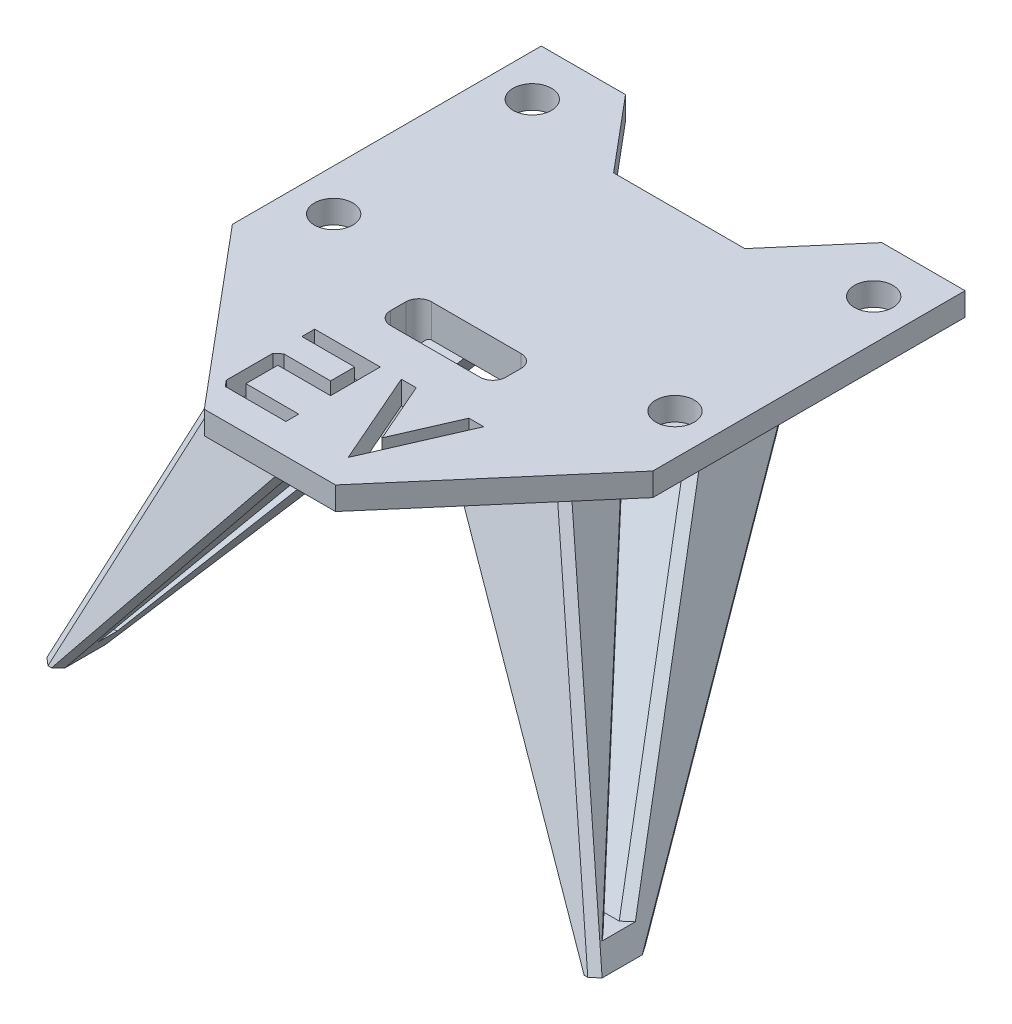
ISO-10303-21;
HEADER;
FILE_DESCRIPTION(('STEP AP214'),'2;1');
FILE_NAME('part.step','',(''),(''),'','','');
FILE_SCHEMA(('AUTOMOTIVE_DESIGN { 1 0 10303 214 1 1 1 1 }'));
ENDSEC;
DATA;
#1=APPLICATION_CONTEXT('core data for automotive mechanical design processes');
#2=APPLICATION_PROTOCOL_DEFINITION('international standard','automotive_design',2000,#1);
#3=PRODUCT_CONTEXT('',#1,'mechanical');
#4=PRODUCT('Part','Part','',(#3));
#5=PRODUCT_RELATED_PRODUCT_CATEGORY('part','',(#4));
#6=PRODUCT_DEFINITION_FORMATION('','',#4);
#7=PRODUCT_DEFINITION_CONTEXT('part definition',#1,'design');
#8=PRODUCT_DEFINITION('design','',#6,#7);
#9=PRODUCT_DEFINITION_SHAPE('','',#8);
#10=(LENGTH_UNIT() NAMED_UNIT(*) SI_UNIT(.MILLI.,.METRE.));
#11=(NAMED_UNIT(*) PLANE_ANGLE_UNIT() SI_UNIT($,.RADIAN.));
#12=(NAMED_UNIT(*) SI_UNIT($,.STERADIAN.) SOLID_ANGLE_UNIT());
#13=UNCERTAINTY_MEASURE_WITH_UNIT(LENGTH_MEASURE(1.E-05),#10,'distance_accuracy_value','');
#14=(GEOMETRIC_REPRESENTATION_CONTEXT(3) GLOBAL_UNCERTAINTY_ASSIGNED_CONTEXT((#13)) GLOBAL_UNIT_ASSIGNED_CONTEXT((#10,
#11,#12)) REPRESENTATION_CONTEXT('',''));
#15=CARTESIAN_POINT('',(0.,0.,0.));
#16=DIRECTION('',(0.,0.,1.));
#17=DIRECTION('',(1.,0.,0.));
#18=AXIS2_PLACEMENT_3D('',#15,#16,#17);
#19=CARTESIAN_POINT('',(-27.3632605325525,-4.27185790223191,0.0115422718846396));
#20=DIRECTION('',(0.,1.,0.));
#21=DIRECTION('',(0.,0.,1.));
#22=AXIS2_PLACEMENT_3D('',#19,#20,#21);
#23=PLANE('',#22);
#24=DIRECTION('',(0.400055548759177,0.,0.91649089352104));
#25=VECTOR('',#24,1.);
#26=CARTESIAN_POINT('',(-4.1074865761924,-4.27185790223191,1.79295048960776));
#27=LINE('',#26,#25);
#28=CARTESIAN_POINT('',(0.554991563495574,-4.27185790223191,12.474264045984));
#29=VERTEX_POINT('',#28);
#30=CARTESIAN_POINT('',(3.77015372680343,-4.27185790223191,19.8399082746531));
#31=VERTEX_POINT('',#30);
#32=EDGE_CURVE('E758',#29,#31,#27,.T.);
#33=ORIENTED_EDGE('',*,*,#32,.T.);
#34=DIRECTION('',(-0.400055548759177,0.,0.91649089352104));
#35=VECTOR('',#34,1.);
#36=CARTESIAN_POINT('',(10.441009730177,-4.27185790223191,4.55758361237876));
#37=LINE('',#36,#35);
#38=CARTESIAN_POINT('',(6.98531589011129,-4.27185790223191,12.474264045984));
#39=VERTEX_POINT('',#38);
#40=EDGE_CURVE('E744',#39,#31,#37,.T.);
#41=ORIENTED_EDGE('',*,*,#40,.F.);
#42=DIRECTION('',(-1.,0.,0.));
#43=VECTOR('',#42,1.);
#44=CARTESIAN_POINT('',(0.,-4.27185790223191,12.474264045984));
#45=LINE('',#44,#43);
#46=CARTESIAN_POINT('',(5.82636208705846,-4.27185790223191,12.474264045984));
#47=VERTEX_POINT('',#46);
#48=EDGE_CURVE('E771',#39,#47,#45,.T.);
#49=ORIENTED_EDGE('',*,*,#48,.T.);
#50=DIRECTION('',(-0.400055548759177,0.,0.91649089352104));
#51=VECTOR('',#50,1.);
#52=CARTESIAN_POINT('',(9.46754004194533,-4.27185790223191,4.13265636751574));
#53=LINE('',#52,#51);
#54=CARTESIAN_POINT('',(3.77015372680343,-4.27185790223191,17.1848504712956));
#55=VERTEX_POINT('',#54);
#56=EDGE_CURVE('E768',#47,#55,#53,.T.);
#57=ORIENTED_EDGE('',*,*,#56,.T.);
#58=DIRECTION('',(0.400055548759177,0.,0.91649089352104));
#59=VECTOR('',#58,1.);
#60=CARTESIAN_POINT('',(-3.13401688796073,-4.27185790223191,1.36802324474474));
#61=LINE('',#60,#59);
#62=CARTESIAN_POINT('',(1.7139453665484,-4.27185790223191,12.474264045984));
#63=VERTEX_POINT('',#62);
#64=EDGE_CURVE('E765',#63,#55,#61,.T.);
#65=ORIENTED_EDGE('',*,*,#64,.F.);
#66=DIRECTION('',(1.,0.,0.));
#67=VECTOR('',#66,1.);
#68=CARTESIAN_POINT('',(0.,-4.27185790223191,12.474264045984));
#69=LINE('',#68,#67);
#70=EDGE_CURVE('E761',#29,#63,#69,.T.);
#71=ORIENTED_EDGE('',*,*,#70,.F.);
#72=EDGE_LOOP('',(#33,#41,#49,#57,#65,#71));
#73=FACE_BOUND('',#72,.T.);
#74=CARTESIAN_POINT('',(13.3925835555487,-4.27185790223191,3.95503523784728));
#75=DIRECTION('',(0.,-1.,0.));
#76=DIRECTION('',(0.,0.,-1.));
#77=AXIS2_PLACEMENT_3D('',#74,#75,#76);
#78=CIRCLE('',#77,1.5);
#79=CARTESIAN_POINT('',(13.3925835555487,-4.27185790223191,2.45503523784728));
#80=VERTEX_POINT('',#79);
#81=EDGE_CURVE('E846',#80,#80,#78,.T.);
#82=ORIENTED_EDGE('',*,*,#81,.F.);
#83=EDGE_LOOP('',(#82));
#84=FACE_BOUND('',#83,.T.);
#85=CARTESIAN_POINT('',(-13.2474164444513,-4.27185790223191,3.95503523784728));
#86=DIRECTION('',(0.,-1.,0.));
#87=DIRECTION('',(0.,0.,-1.));
#88=AXIS2_PLACEMENT_3D('',#85,#86,#87);
#89=CIRCLE('',#88,1.5);
#90=CARTESIAN_POINT('',(-13.2474164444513,-4.27185790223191,2.45503523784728));
#91=VERTEX_POINT('',#90);
#92=EDGE_CURVE('E840',#91,#91,#89,.T.);
#93=ORIENTED_EDGE('',*,*,#92,.F.);
#94=EDGE_LOOP('',(#93));
#95=FACE_BOUND('',#94,.T.);
#96=CARTESIAN_POINT('',(-13.2474164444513,-4.27185790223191,-11.5449647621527));
#97=DIRECTION('',(0.,-1.,0.));
#98=DIRECTION('',(0.,0.,-1.));
#99=AXIS2_PLACEMENT_3D('',#96,#97,#98);
#100=CIRCLE('',#99,1.5);
#101=CARTESIAN_POINT('',(-13.2474164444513,-4.27185790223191,-13.0449647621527));
#102=VERTEX_POINT('',#101);
#103=EDGE_CURVE('E833',#102,#102,#100,.T.);
#104=ORIENTED_EDGE('',*,*,#103,.F.);
#105=EDGE_LOOP('',(#104));
#106=FACE_BOUND('',#105,.T.);
#107=CARTESIAN_POINT('',(13.3925835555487,-4.27185790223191,-11.5449647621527));
#108=DIRECTION('',(0.,-1.,0.));
#109=DIRECTION('',(0.,0.,-1.));
#110=AXIS2_PLACEMENT_3D('',#107,#108,#109);
#111=CIRCLE('',#110,1.5);
#112=CARTESIAN_POINT('',(13.3925835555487,-4.27185790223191,-13.0449647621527));
#113=VERTEX_POINT('',#112);
#114=EDGE_CURVE('E836',#113,#113,#111,.T.);
#115=ORIENTED_EDGE('',*,*,#114,.F.);
#116=EDGE_LOOP('',(#115));
#117=FACE_BOUND('',#116,.T.);
#118=DIRECTION('',(0.,0.,-1.));
#119=VECTOR('',#118,1.);
#120=CARTESIAN_POINT('',(-11.596020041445,-4.27185790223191,22.1912498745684));
#121=LINE('',#120,#119);
#122=CARTESIAN_POINT('',(-11.596020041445,-4.27185790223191,10.3429008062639));
#123=VERTEX_POINT('',#122);
#124=CARTESIAN_POINT('',(-11.596020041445,-4.27185790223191,6.25112810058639));
#125=VERTEX_POINT('',#124);
#126=EDGE_CURVE('E928',#123,#125,#121,.T.);
#127=ORIENTED_EDGE('',*,*,#126,.F.);
#128=DIRECTION('',(-0.757243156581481,0.,-0.653133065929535));
#129=VECTOR('',#128,1.);
#130=CARTESIAN_POINT('',(-25.7469158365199,-4.27185790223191,-1.86244945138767));
#131=LINE('',#130,#129);
#132=CARTESIAN_POINT('',(-10.9944656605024,-4.27185790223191,10.8617500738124));
#133=VERTEX_POINT('',#132);
#134=EDGE_CURVE('E1131',#123,#133,#131,.F.);
#135=ORIENTED_EDGE('',*,*,#134,.T.);
#136=DIRECTION('',(1.,0.,0.));
#137=VECTOR('',#136,1.);
#138=CARTESIAN_POINT('',(-27.3632605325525,-4.27185790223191,10.8617500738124));
#139=LINE('',#138,#137);
#140=CARTESIAN_POINT('',(10.9944656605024,-4.27185790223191,10.8617500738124));
#141=VERTEX_POINT('',#140);
#142=EDGE_CURVE('E969',#133,#141,#139,.T.);
#143=ORIENTED_EDGE('',*,*,#142,.T.);
#144=DIRECTION('',(-0.757243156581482,0.,0.653133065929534));
#145=VECTOR('',#144,1.);
#146=CARTESIAN_POINT('',(-5.63421253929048,-4.27185790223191,25.2042231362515));
#147=LINE('',#146,#145);
#148=CARTESIAN_POINT('',(11.596020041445,-4.27185790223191,10.3429008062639));
#149=VERTEX_POINT('',#148);
#150=EDGE_CURVE('E1147',#141,#149,#147,.F.);
#151=ORIENTED_EDGE('',*,*,#150,.T.);
#152=DIRECTION('',(0.,0.,-1.));
#153=VECTOR('',#152,1.);
#154=CARTESIAN_POINT('',(11.596020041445,-4.27185790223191,22.1912498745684));
#155=LINE('',#154,#153);
#156=CARTESIAN_POINT('',(11.596020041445,-4.27185790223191,6.25112810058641));
#157=VERTEX_POINT('',#156);
#158=EDGE_CURVE('E903',#149,#157,#155,.T.);
#159=ORIENTED_EDGE('',*,*,#158,.T.);
#160=DIRECTION('',(0.649174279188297,0.,0.760639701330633));
#161=VECTOR('',#160,1.);
#162=CARTESIAN_POINT('',(-7.90351315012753,-4.27185790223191,-16.5965409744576));
#163=LINE('',#162,#161);
#164=CARTESIAN_POINT('',(11.1312094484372,-4.27185790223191,5.70650795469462));
#165=VERTEX_POINT('',#164);
#166=EDGE_CURVE('E1152',#157,#165,#163,.F.);
#167=ORIENTED_EDGE('',*,*,#166,.T.);
#168=DIRECTION('',(1.,0.,0.));
#169=VECTOR('',#168,1.);
#170=CARTESIAN_POINT('',(-27.3632605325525,-4.27185790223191,5.70650795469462));
#171=LINE('',#170,#169);
#172=CARTESIAN_POINT('',(-11.1312094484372,-4.27185790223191,5.70650795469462));
#173=VERTEX_POINT('',#172);
#174=EDGE_CURVE('E966',#173,#165,#171,.T.);
#175=ORIENTED_EDGE('',*,*,#174,.F.);
#176=DIRECTION('',(0.649174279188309,0.,-0.760639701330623));
#177=VECTOR('',#176,1.);
#178=CARTESIAN_POINT('',(-15.1597338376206,-4.27185790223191,10.4267436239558));
#179=LINE('',#178,#177);
#180=EDGE_CURVE('E1133',#173,#125,#179,.F.);
#181=ORIENTED_EDGE('',*,*,#180,.T.);
#182=EDGE_LOOP('',(#127,#135,#143,#151,#159,#167,#175,#181));
#183=FACE_BOUND('',#182,.T.);
#184=DIRECTION('',(1.,0.,0.));
#185=VECTOR('',#184,1.);
#186=CARTESIAN_POINT('',(-27.3632605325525,-4.27185790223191,-8.24835640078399));
#187=LINE('',#186,#185);
#188=CARTESIAN_POINT('',(-11.166176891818,-4.27185790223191,-8.24835640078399));
#189=VERTEX_POINT('',#188);
#190=CARTESIAN_POINT('',(11.166176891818,-4.27185790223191,-8.24835640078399));
#191=VERTEX_POINT('',#190);
#192=EDGE_CURVE('E980',#189,#191,#187,.T.);
#193=ORIENTED_EDGE('',*,*,#192,.F.);
#194=DIRECTION('',(0.553692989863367,0.,-0.832720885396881));
#195=VECTOR('',#194,1.);
#196=CARTESIAN_POINT('',(-19.9402184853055,-4.27185790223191,4.94727333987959));
#197=LINE('',#196,#195);
#198=CARTESIAN_POINT('',(-11.596020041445,-4.27185790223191,-7.60189821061));
#199=VERTEX_POINT('',#198);
#200=EDGE_CURVE('E1142',#189,#199,#197,.F.);
#201=ORIENTED_EDGE('',*,*,#200,.T.);
#202=CARTESIAN_POINT('',(-11.596020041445,-4.27185790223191,-0.571053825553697));
#203=VERTEX_POINT('',#202);
#204=EDGE_CURVE('E899',#203,#199,#121,.T.);
#205=ORIENTED_EDGE('',*,*,#204,.F.);
#206=DIRECTION('',(-0.757146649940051,0.,-0.653244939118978));
#207=VECTOR('',#206,1.);
#208=CARTESIAN_POINT('',(-20.3467692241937,-4.27185790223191,-8.12095531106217));
#209=LINE('',#208,#207);
#210=CARTESIAN_POINT('',(-10.9207592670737,-4.27185790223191,0.0115422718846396));
#211=VERTEX_POINT('',#210);
#212=EDGE_CURVE('E1140',#203,#211,#209,.F.);
#213=ORIENTED_EDGE('',*,*,#212,.T.);
#214=DIRECTION('',(1.,0.,0.));
#215=VECTOR('',#214,1.);
#216=CARTESIAN_POINT('',(-27.3632605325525,-4.27185790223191,0.0115422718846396));
#217=LINE('',#216,#215);
#218=CARTESIAN_POINT('',(10.9207592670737,-4.27185790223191,0.0115422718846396));
#219=VERTEX_POINT('',#218);
#220=EDGE_CURVE('E965',#211,#219,#217,.T.);
#221=ORIENTED_EDGE('',*,*,#220,.T.);
#222=DIRECTION('',(-0.757146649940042,0.,0.653244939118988));
#223=VECTOR('',#222,1.);
#224=CARTESIAN_POINT('',(-11.0263609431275,-4.27185790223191,18.9469033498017));
#225=LINE('',#224,#223);
#226=CARTESIAN_POINT('',(11.596020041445,-4.27185790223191,-0.571053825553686));
#227=VERTEX_POINT('',#226);
#228=EDGE_CURVE('E1154',#219,#227,#225,.F.);
#229=ORIENTED_EDGE('',*,*,#228,.T.);
#230=CARTESIAN_POINT('',(11.596020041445,-4.27185790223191,-7.60189821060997));
#231=VERTEX_POINT('',#230);
#232=EDGE_CURVE('E907',#227,#231,#155,.T.);
#233=ORIENTED_EDGE('',*,*,#232,.T.);
#234=DIRECTION('',(0.553692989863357,0.,0.832720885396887));
#235=VECTOR('',#234,1.);
#236=CARTESIAN_POINT('',(3.16238455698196,-4.27185790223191,-20.28557767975));
#237=LINE('',#236,#235);
#238=EDGE_CURVE('E1158',#231,#191,#237,.F.);
#239=ORIENTED_EDGE('',*,*,#238,.T.);
#240=EDGE_LOOP('',(#193,#201,#205,#213,#221,#229,#233,#239));
#241=FACE_BOUND('',#240,.T.);
#242=DIRECTION('',(0.,0.,1.));
#243=VECTOR('',#242,1.);
#244=CARTESIAN_POINT('',(16.5717167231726,-4.27185790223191,0.));
#245=LINE('',#244,#243);
#246=CARTESIAN_POINT('',(16.5717167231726,-4.27185790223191,-15.5));
#247=VERTEX_POINT('',#246);
#248=CARTESIAN_POINT('',(16.5717167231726,-4.27185790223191,8.86934459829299));
#249=VERTEX_POINT('',#248);
#250=EDGE_CURVE('E891',#247,#249,#245,.T.);
#251=ORIENTED_EDGE('',*,*,#250,.T.);
#252=DIRECTION('',(0.651438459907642,0.,-0.758701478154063));
#253=VECTOR('',#252,1.);
#254=CARTESIAN_POINT('',(5.13322384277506,-4.27185790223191,22.1912498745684));
#255=LINE('',#254,#253);
#256=CARTESIAN_POINT('',(5.13322384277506,-4.27185790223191,22.1912498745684));
#257=VERTEX_POINT('',#256);
#258=EDGE_CURVE('E797',#257,#249,#255,.T.);
#259=ORIENTED_EDGE('',*,*,#258,.F.);
#260=DIRECTION('',(1.,0.,0.));
#261=VECTOR('',#260,1.);
#262=CARTESIAN_POINT('',(16.5,-4.27185790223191,22.1912498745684));
#263=LINE('',#262,#261);
#264=CARTESIAN_POINT('',(-5.10355450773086,-4.27185790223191,22.1912498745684));
#265=VERTEX_POINT('',#264);
#266=EDGE_CURVE('E996',#265,#257,#263,.T.);
#267=ORIENTED_EDGE('',*,*,#266,.F.);
#268=DIRECTION('',(0.642672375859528,0.,0.766141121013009));
#269=VECTOR('',#268,1.);
#270=CARTESIAN_POINT('',(-5.10355450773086,-4.27185790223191,22.1912498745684));
#271=LINE('',#270,#269);
#272=CARTESIAN_POINT('',(-16.4991331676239,-4.27185790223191,8.60637873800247));
#273=VERTEX_POINT('',#272);
#274=EDGE_CURVE('E807',#273,#265,#271,.T.);
#275=ORIENTED_EDGE('',*,*,#274,.F.);
#276=DIRECTION('',(0.,0.,1.));
#277=VECTOR('',#276,1.);
#278=CARTESIAN_POINT('',(-16.4991331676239,-4.27185790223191,0.));
#279=LINE('',#278,#277);
#280=CARTESIAN_POINT('',(-16.4991331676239,-4.27185790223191,-15.5));
#281=VERTEX_POINT('',#280);
#282=EDGE_CURVE('E892',#281,#273,#279,.T.);
#283=ORIENTED_EDGE('',*,*,#282,.F.);
#284=DIRECTION('',(-1.,0.,0.));
#285=VECTOR('',#284,1.);
#286=CARTESIAN_POINT('',(-16.5,-4.27185790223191,-15.5));
#287=LINE('',#286,#285);
#288=CARTESIAN_POINT('',(-9.92828242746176,-4.27185790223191,-15.5));
#289=VERTEX_POINT('',#288);
#290=EDGE_CURVE('E1027',#289,#281,#287,.T.);
#291=ORIENTED_EDGE('',*,*,#290,.F.);
#292=DIRECTION('',(-0.642672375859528,0.,-0.766141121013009));
#293=VECTOR('',#292,1.);
#294=CARTESIAN_POINT('',(-9.92828242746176,-4.27185790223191,-15.5));
#295=LINE('',#294,#293);
#296=CARTESIAN_POINT('',(-5.10355450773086,-4.27185790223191,-9.748356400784));
#297=VERTEX_POINT('',#296);
#298=EDGE_CURVE('E798',#297,#289,#295,.T.);
#299=ORIENTED_EDGE('',*,*,#298,.F.);
#300=DIRECTION('',(-1.,0.,0.));
#301=VECTOR('',#300,1.);
#302=CARTESIAN_POINT('',(5.13322384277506,-4.27185790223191,-9.74835640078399));
#303=LINE('',#302,#301);
#304=CARTESIAN_POINT('',(5.13322384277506,-4.27185790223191,-9.74835640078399));
#305=VERTEX_POINT('',#304);
#306=EDGE_CURVE('E800',#305,#297,#303,.T.);
#307=ORIENTED_EDGE('',*,*,#306,.F.);
#308=DIRECTION('',(-0.651438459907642,0.,0.758701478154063));
#309=VECTOR('',#308,1.);
#310=CARTESIAN_POINT('',(10.0717167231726,-4.27185790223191,-15.5));
#311=LINE('',#310,#309);
#312=CARTESIAN_POINT('',(10.0717167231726,-4.27185790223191,-15.5));
#313=VERTEX_POINT('',#312);
#314=EDGE_CURVE('E804',#313,#305,#311,.T.);
#315=ORIENTED_EDGE('',*,*,#314,.F.);
#316=EDGE_CURVE('E1028',#247,#313,#287,.T.);
#317=ORIENTED_EDGE('',*,*,#316,.F.);
#318=EDGE_LOOP('',(#251,#259,#267,#275,#283,#291,#299,#307,#315,#317));
#319=FACE_BOUND('',#318,.T.);
#320=DIRECTION('',(-0.76614112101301,0.,0.642672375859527));
#321=VECTOR('',#320,1.);
#322=CARTESIAN_POINT('',(5.18768213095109,-4.27185790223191,6.18432774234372));
#323=LINE('',#322,#321);
#324=CARTESIAN_POINT('',(-5.74058460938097,-4.27185790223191,15.3514315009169));
#325=VERTEX_POINT('',#324);
#326=CARTESIAN_POINT('',(-6.20738544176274,-4.27185790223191,15.7430042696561));
#327=VERTEX_POINT('',#326);
#328=EDGE_CURVE('E629',#325,#327,#323,.T.);
#329=ORIENTED_EDGE('',*,*,#328,.T.);
#330=DIRECTION('',(0.,0.,1.));
#331=VECTOR('',#330,1.);
#332=CARTESIAN_POINT('',(-6.20738544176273,-4.27185790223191,0.));
#333=LINE('',#332,#331);
#334=CARTESIAN_POINT('',(-6.20738544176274,-4.27185790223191,19.3731074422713));
#335=VERTEX_POINT('',#334);
#336=EDGE_CURVE('E647',#327,#335,#333,.T.);
#337=ORIENTED_EDGE('',*,*,#336,.T.);
#338=DIRECTION('',(-0.642672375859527,0.,-0.76614112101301));
#339=VECTOR('',#338,1.);
#340=CARTESIAN_POINT('',(-13.1824495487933,-4.27185790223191,11.0580099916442));
#341=LINE('',#340,#339);
#342=CARTESIAN_POINT('',(-5.81581267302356,-4.27185790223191,19.8399082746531));
#343=VERTEX_POINT('',#342);
#344=EDGE_CURVE('E650',#343,#335,#341,.T.);
#345=ORIENTED_EDGE('',*,*,#344,.F.);
#346=DIRECTION('',(-1.,0.,0.));
#347=VECTOR('',#346,1.);
#348=CARTESIAN_POINT('',(0.,-4.27185790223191,19.8399082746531));
#349=LINE('',#348,#347);
#350=CARTESIAN_POINT('',(-1.08954432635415,-4.27185790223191,19.8399082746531));
#351=VERTEX_POINT('',#350);
#352=EDGE_CURVE('E710',#351,#343,#349,.T.);
#353=ORIENTED_EDGE('',*,*,#352,.F.);
#354=DIRECTION('',(0.,0.,1.));
#355=VECTOR('',#354,1.);
#356=CARTESIAN_POINT('',(-1.08954432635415,-4.27185790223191,0.));
#357=LINE('',#356,#355);
#358=CARTESIAN_POINT('',(-1.08954432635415,-4.27185790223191,18.8399082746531));
#359=VERTEX_POINT('',#358);
#360=EDGE_CURVE('E707',#359,#351,#357,.T.);
#361=ORIENTED_EDGE('',*,*,#360,.F.);
#362=DIRECTION('',(-1.,0.,0.));
#363=VECTOR('',#362,1.);
#364=CARTESIAN_POINT('',(0.,-4.27185790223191,18.8399082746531));
#365=LINE('',#364,#363);
#366=CARTESIAN_POINT('',(-5.20738544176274,-4.27185790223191,18.8399082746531));
#367=VERTEX_POINT('',#366);
#368=EDGE_CURVE('E704',#359,#367,#365,.T.);
#369=ORIENTED_EDGE('',*,*,#368,.T.);
#370=DIRECTION('',(0.,0.,-1.));
#371=VECTOR('',#370,1.);
#372=CARTESIAN_POINT('',(-5.20738544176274,-4.27185790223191,0.));
#373=LINE('',#372,#371);
#374=CARTESIAN_POINT('',(-5.20738544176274,-4.27185790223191,16.3514315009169));
#375=VERTEX_POINT('',#374);
#376=EDGE_CURVE('E701',#367,#375,#373,.T.);
#377=ORIENTED_EDGE('',*,*,#376,.T.);
#378=DIRECTION('',(-1.,0.,0.));
#379=VECTOR('',#378,1.);
#380=CARTESIAN_POINT('',(0.,-4.27185790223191,16.3514315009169));
#381=LINE('',#380,#379);
#382=CARTESIAN_POINT('',(-1.08954432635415,-4.27185790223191,16.3514315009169));
#383=VERTEX_POINT('',#382);
#384=EDGE_CURVE('E698',#383,#375,#381,.T.);
#385=ORIENTED_EDGE('',*,*,#384,.F.);
#386=DIRECTION('',(0.,0.,1.));
#387=VECTOR('',#386,1.);
#388=CARTESIAN_POINT('',(-1.08954432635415,-4.27185790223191,0.));
#389=LINE('',#388,#387);
#390=CARTESIAN_POINT('',(-1.08954432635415,-4.27185790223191,12.474264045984));
#391=VERTEX_POINT('',#390);
#392=EDGE_CURVE('E695',#391,#383,#389,.T.);
#393=ORIENTED_EDGE('',*,*,#392,.F.);
#394=DIRECTION('',(-1.,0.,0.));
#395=VECTOR('',#394,1.);
#396=CARTESIAN_POINT('',(0.,-4.27185790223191,12.474264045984));
#397=LINE('',#396,#395);
#398=CARTESIAN_POINT('',(-6.20738544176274,-4.27185790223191,12.474264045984));
#399=VERTEX_POINT('',#398);
#400=EDGE_CURVE('E692',#391,#399,#397,.T.);
#401=ORIENTED_EDGE('',*,*,#400,.T.);
#402=DIRECTION('',(0.,0.,1.));
#403=VECTOR('',#402,1.);
#404=CARTESIAN_POINT('',(-6.20738544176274,-4.27185790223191,0.));
#405=LINE('',#404,#403);
#406=CARTESIAN_POINT('',(-6.20738544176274,-4.27185790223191,13.474264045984));
#407=VERTEX_POINT('',#406);
#408=EDGE_CURVE('E689',#399,#407,#405,.T.);
#409=ORIENTED_EDGE('',*,*,#408,.T.);
#410=DIRECTION('',(1.,0.,0.));
#411=VECTOR('',#410,1.);
#412=CARTESIAN_POINT('',(0.,-4.27185790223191,13.474264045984));
#413=LINE('',#412,#411);
#414=CARTESIAN_POINT('',(-2.08954432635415,-4.27185790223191,13.474264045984));
#415=VERTEX_POINT('',#414);
#416=EDGE_CURVE('E686',#407,#415,#413,.T.);
#417=ORIENTED_EDGE('',*,*,#416,.T.);
#418=DIRECTION('',(0.,0.,1.));
#419=VECTOR('',#418,1.);
#420=CARTESIAN_POINT('',(-2.08954432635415,-4.27185790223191,0.));
#421=LINE('',#420,#419);
#422=CARTESIAN_POINT('',(-2.08954432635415,-4.27185790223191,15.3514315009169));
#423=VERTEX_POINT('',#422);
#424=EDGE_CURVE('E683',#415,#423,#421,.T.);
#425=ORIENTED_EDGE('',*,*,#424,.T.);
#426=DIRECTION('',(1.,0.,0.));
#427=VECTOR('',#426,1.);
#428=CARTESIAN_POINT('',(0.,-4.27185790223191,15.3514315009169));
#429=LINE('',#428,#427);
#430=EDGE_CURVE('E680',#325,#423,#429,.T.);
#431=ORIENTED_EDGE('',*,*,#430,.F.);
#432=EDGE_LOOP('',(#329,#337,#345,#353,#361,#369,#377,#385,#393,#401,#409,#417,#425,#431));
#433=FACE_BOUND('',#432,.T.);
#434=ADVANCED_FACE('F196',(#73,#84,#95,#106,#117,#183,#241,#319,#433),#23,.F.);
#435=CARTESIAN_POINT('',(-16.4991331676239,-2.47185790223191,22.1912498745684));
#436=DIRECTION('',(0.,-1.,0.));
#437=DIRECTION('',(1.,0.,0.));
#438=AXIS2_PLACEMENT_3D('',#435,#436,#437);
#439=PLANE('',#438);
#440=DIRECTION('',(0.400055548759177,0.,0.91649089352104));
#441=VECTOR('',#440,1.);
#442=CARTESIAN_POINT('',(-4.1074865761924,-2.4718579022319,1.79295048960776));
#443=LINE('',#442,#441);
#444=CARTESIAN_POINT('',(0.554991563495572,-2.4718579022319,12.474264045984));
#445=VERTEX_POINT('',#444);
#446=CARTESIAN_POINT('',(3.77015372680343,-2.4718579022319,19.8399082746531));
#447=VERTEX_POINT('',#446);
#448=EDGE_CURVE('E741',#445,#447,#443,.T.);
#449=ORIENTED_EDGE('',*,*,#448,.F.);
#450=DIRECTION('',(1.,0.,0.));
#451=VECTOR('',#450,1.);
#452=CARTESIAN_POINT('',(0.,-2.4718579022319,12.474264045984));
#453=LINE('',#452,#451);
#454=CARTESIAN_POINT('',(1.7139453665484,-2.47185790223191,12.474264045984));
#455=VERTEX_POINT('',#454);
#456=EDGE_CURVE('E743',#445,#455,#453,.T.);
#457=ORIENTED_EDGE('',*,*,#456,.T.);
#458=DIRECTION('',(0.400055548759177,0.,0.91649089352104));
#459=VECTOR('',#458,1.);
#460=CARTESIAN_POINT('',(-3.13401688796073,-2.4718579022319,1.36802324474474));
#461=LINE('',#460,#459);
#462=CARTESIAN_POINT('',(3.77015372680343,-2.4718579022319,17.1848504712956));
#463=VERTEX_POINT('',#462);
#464=EDGE_CURVE('E747',#455,#463,#461,.T.);
#465=ORIENTED_EDGE('',*,*,#464,.T.);
#466=DIRECTION('',(-0.400055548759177,0.,0.91649089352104));
#467=VECTOR('',#466,1.);
#468=CARTESIAN_POINT('',(9.46754004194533,-2.4718579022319,4.13265636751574));
#469=LINE('',#468,#467);
#470=CARTESIAN_POINT('',(5.82636208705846,-2.4718579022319,12.474264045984));
#471=VERTEX_POINT('',#470);
#472=EDGE_CURVE('E750',#471,#463,#469,.T.);
#473=ORIENTED_EDGE('',*,*,#472,.F.);
#474=DIRECTION('',(-1.,0.,0.));
#475=VECTOR('',#474,1.);
#476=CARTESIAN_POINT('',(0.,-2.4718579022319,12.474264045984));
#477=LINE('',#476,#475);
#478=CARTESIAN_POINT('',(6.98531589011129,-2.4718579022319,12.474264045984));
#479=VERTEX_POINT('',#478);
#480=EDGE_CURVE('E752',#479,#471,#477,.T.);
#481=ORIENTED_EDGE('',*,*,#480,.F.);
#482=DIRECTION('',(-0.400055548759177,0.,0.91649089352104));
#483=VECTOR('',#482,1.);
#484=CARTESIAN_POINT('',(10.441009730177,-2.4718579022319,4.55758361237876));
#485=LINE('',#484,#483);
#486=EDGE_CURVE('E754',#479,#447,#485,.T.);
#487=ORIENTED_EDGE('',*,*,#486,.T.);
#488=EDGE_LOOP('',(#449,#457,#465,#473,#481,#487));
#489=FACE_BOUND('',#488,.T.);
#490=DIRECTION('',(-1.,0.,0.));
#491=VECTOR('',#490,1.);
#492=CARTESIAN_POINT('',(-16.4991331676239,-2.47185790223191,22.1912498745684));
#493=LINE('',#492,#491);
#494=CARTESIAN_POINT('',(5.13322384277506,-2.47185790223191,22.1912498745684));
#495=VERTEX_POINT('',#494);
#496=CARTESIAN_POINT('',(-5.10355450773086,-2.47185790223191,22.1912498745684));
#497=VERTEX_POINT('',#496);
#498=EDGE_CURVE('E857',#495,#497,#493,.T.);
#499=ORIENTED_EDGE('',*,*,#498,.F.);
#500=DIRECTION('',(0.651438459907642,0.,-0.758701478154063));
#501=VECTOR('',#500,1.);
#502=CARTESIAN_POINT('',(5.13322384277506,-2.47185790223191,22.1912498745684));
#503=LINE('',#502,#501);
#504=CARTESIAN_POINT('',(16.5717167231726,-2.47185790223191,8.86934459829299));
#505=VERTEX_POINT('',#504);
#506=EDGE_CURVE('E817',#495,#505,#503,.T.);
#507=ORIENTED_EDGE('',*,*,#506,.T.);
#508=DIRECTION('',(0.,0.,-1.));
#509=VECTOR('',#508,1.);
#510=CARTESIAN_POINT('',(16.5717167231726,-2.47185790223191,22.1912498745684));
#511=LINE('',#510,#509);
#512=CARTESIAN_POINT('',(16.5717167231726,-2.47185790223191,-15.5));
#513=VERTEX_POINT('',#512);
#514=EDGE_CURVE('E860',#505,#513,#511,.T.);
#515=ORIENTED_EDGE('',*,*,#514,.T.);
#516=DIRECTION('',(-1.,0.,0.));
#517=VECTOR('',#516,1.);
#518=CARTESIAN_POINT('',(-16.4991331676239,-2.47185790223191,-15.5));
#519=LINE('',#518,#517);
#520=CARTESIAN_POINT('',(10.0717167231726,-2.4718579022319,-15.5));
#521=VERTEX_POINT('',#520);
#522=EDGE_CURVE('E861',#513,#521,#519,.T.);
#523=ORIENTED_EDGE('',*,*,#522,.T.);
#524=DIRECTION('',(-0.651438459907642,0.,0.758701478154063));
#525=VECTOR('',#524,1.);
#526=CARTESIAN_POINT('',(10.0717167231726,-2.4718579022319,-15.5));
#527=LINE('',#526,#525);
#528=CARTESIAN_POINT('',(5.13322384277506,-2.4718579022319,-9.74835640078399));
#529=VERTEX_POINT('',#528);
#530=EDGE_CURVE('E801',#521,#529,#527,.T.);
#531=ORIENTED_EDGE('',*,*,#530,.T.);
#532=DIRECTION('',(-1.,0.,0.));
#533=VECTOR('',#532,1.);
#534=CARTESIAN_POINT('',(5.13322384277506,-2.4718579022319,-9.74835640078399));
#535=LINE('',#534,#533);
#536=CARTESIAN_POINT('',(-5.10355450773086,-2.47185790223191,-9.748356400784));
#537=VERTEX_POINT('',#536);
#538=EDGE_CURVE('E810',#529,#537,#535,.T.);
#539=ORIENTED_EDGE('',*,*,#538,.T.);
#540=DIRECTION('',(-0.642672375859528,0.,-0.766141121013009));
#541=VECTOR('',#540,1.);
#542=CARTESIAN_POINT('',(-9.92828242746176,-2.4718579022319,-15.5));
#543=LINE('',#542,#541);
#544=CARTESIAN_POINT('',(-9.92828242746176,-2.4718579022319,-15.5));
#545=VERTEX_POINT('',#544);
#546=EDGE_CURVE('E789',#537,#545,#543,.T.);
#547=ORIENTED_EDGE('',*,*,#546,.T.);
#548=CARTESIAN_POINT('',(-16.4991331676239,-2.47185790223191,-15.5));
#549=VERTEX_POINT('',#548);
#550=EDGE_CURVE('E854',#545,#549,#519,.T.);
#551=ORIENTED_EDGE('',*,*,#550,.T.);
#552=DIRECTION('',(0.,0.,-1.));
#553=VECTOR('',#552,1.);
#554=CARTESIAN_POINT('',(-16.4991331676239,-2.47185790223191,22.1912498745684));
#555=LINE('',#554,#553);
#556=CARTESIAN_POINT('',(-16.4991331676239,-2.4718579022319,8.60637873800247));
#557=VERTEX_POINT('',#556);
#558=EDGE_CURVE('E864',#557,#549,#555,.T.);
#559=ORIENTED_EDGE('',*,*,#558,.F.);
#560=DIRECTION('',(0.642672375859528,0.,0.766141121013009));
#561=VECTOR('',#560,1.);
#562=CARTESIAN_POINT('',(-5.10355450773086,-2.47185790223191,22.1912498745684));
#563=LINE('',#562,#561);
#564=EDGE_CURVE('E823',#557,#497,#563,.T.);
#565=ORIENTED_EDGE('',*,*,#564,.T.);
#566=EDGE_LOOP('',(#499,#507,#515,#523,#531,#539,#547,#551,#559,#565));
#567=FACE_BOUND('',#566,.T.);
#568=CARTESIAN_POINT('',(13.3925835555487,-2.47185790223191,3.95503523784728));
#569=DIRECTION('',(0.,-1.,0.));
#570=DIRECTION('',(0.,0.,-1.));
#571=AXIS2_PLACEMENT_3D('',#568,#569,#570);
#572=CIRCLE('',#571,1.5);
#573=CARTESIAN_POINT('',(13.3925835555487,-2.47185790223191,2.45503523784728));
#574=VERTEX_POINT('',#573);
#575=EDGE_CURVE('E831',#574,#574,#572,.T.);
#576=ORIENTED_EDGE('',*,*,#575,.T.);
#577=EDGE_LOOP('',(#576));
#578=FACE_BOUND('',#577,.T.);
#579=CARTESIAN_POINT('',(-13.2474164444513,-2.47185790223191,3.95503523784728));
#580=DIRECTION('',(0.,-1.,0.));
#581=DIRECTION('',(0.,0.,-1.));
#582=AXIS2_PLACEMENT_3D('',#579,#580,#581);
#583=CIRCLE('',#582,1.5);
#584=CARTESIAN_POINT('',(-13.2474164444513,-2.47185790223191,2.45503523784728));
#585=VERTEX_POINT('',#584);
#586=EDGE_CURVE('E843',#585,#585,#583,.T.);
#587=ORIENTED_EDGE('',*,*,#586,.T.);
#588=EDGE_LOOP('',(#587));
#589=FACE_BOUND('',#588,.T.);
#590=CARTESIAN_POINT('',(-13.2474164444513,-2.47185790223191,-11.5449647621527));
#591=DIRECTION('',(0.,-1.,0.));
#592=DIRECTION('',(0.,0.,-1.));
#593=AXIS2_PLACEMENT_3D('',#590,#591,#592);
#594=CIRCLE('',#593,1.5);
#595=CARTESIAN_POINT('',(-13.2474164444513,-2.47185790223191,-13.0449647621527));
#596=VERTEX_POINT('',#595);
#597=EDGE_CURVE('E837',#596,#596,#594,.T.);
#598=ORIENTED_EDGE('',*,*,#597,.T.);
#599=EDGE_LOOP('',(#598));
#600=FACE_BOUND('',#599,.T.);
#601=CARTESIAN_POINT('',(13.3925835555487,-2.47185790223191,-11.5449647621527));
#602=DIRECTION('',(0.,-1.,0.));
#603=DIRECTION('',(0.,0.,-1.));
#604=AXIS2_PLACEMENT_3D('',#601,#602,#603);
#605=CIRCLE('',#604,1.5);
#606=CARTESIAN_POINT('',(13.3925835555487,-2.47185790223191,-13.0449647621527));
#607=VERTEX_POINT('',#606);
#608=EDGE_CURVE('E851',#607,#607,#605,.T.);
#609=ORIENTED_EDGE('',*,*,#608,.T.);
#610=EDGE_LOOP('',(#609));
#611=FACE_BOUND('',#610,.T.);
#612=DIRECTION('',(0.,0.,1.));
#613=VECTOR('',#612,1.);
#614=CARTESIAN_POINT('',(-4.5,-2.47185790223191,6.07045388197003));
#615=LINE('',#614,#613);
#616=CARTESIAN_POINT('',(-4.5,-2.47185790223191,7.07045388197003));
#617=VERTEX_POINT('',#616);
#618=CARTESIAN_POINT('',(-4.5,-2.47185790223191,8.27045388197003));
#619=VERTEX_POINT('',#618);
#620=EDGE_CURVE('E885',#617,#619,#615,.T.);
#621=ORIENTED_EDGE('',*,*,#620,.F.);
#622=CARTESIAN_POINT('',(-3.5,-2.47185790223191,7.07045388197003));
#623=DIRECTION('',(0.,-1.,0.));
#624=DIRECTION('',(1.,0.,0.));
#625=AXIS2_PLACEMENT_3D('',#622,#623,#624);
#626=CIRCLE('',#625,1.);
#627=CARTESIAN_POINT('',(-3.5,-2.47185790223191,6.07045388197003));
#628=VERTEX_POINT('',#627);
#629=EDGE_CURVE('E879',#628,#617,#626,.F.);
#630=ORIENTED_EDGE('',*,*,#629,.F.);
#631=DIRECTION('',(-1.,0.,0.));
#632=VECTOR('',#631,1.);
#633=CARTESIAN_POINT('',(-4.5,-2.47185790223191,6.07045388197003));
#634=LINE('',#633,#632);
#635=CARTESIAN_POINT('',(3.5,-2.47185790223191,6.07045388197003));
#636=VERTEX_POINT('',#635);
#637=EDGE_CURVE('E873',#636,#628,#634,.T.);
#638=ORIENTED_EDGE('',*,*,#637,.F.);
#639=CARTESIAN_POINT('',(3.5,-2.47185790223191,7.07045388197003));
#640=DIRECTION('',(0.,-1.,0.));
#641=DIRECTION('',(1.,0.,0.));
#642=AXIS2_PLACEMENT_3D('',#639,#640,#641);
#643=CIRCLE('',#642,1.);
#644=CARTESIAN_POINT('',(4.5,-2.47185790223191,7.07045388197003));
#645=VERTEX_POINT('',#644);
#646=EDGE_CURVE('E866',#645,#636,#643,.F.);
#647=ORIENTED_EDGE('',*,*,#646,.F.);
#648=DIRECTION('',(0.,0.,-1.));
#649=VECTOR('',#648,1.);
#650=CARTESIAN_POINT('',(4.5,-2.47185790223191,6.07045388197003));
#651=LINE('',#650,#649);
#652=CARTESIAN_POINT('',(4.5,-2.47185790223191,8.27045388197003));
#653=VERTEX_POINT('',#652);
#654=EDGE_CURVE('E870',#653,#645,#651,.T.);
#655=ORIENTED_EDGE('',*,*,#654,.F.);
#656=CARTESIAN_POINT('',(3.5,-2.47185790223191,8.27045388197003));
#657=DIRECTION('',(0.,-1.,0.));
#658=DIRECTION('',(1.,0.,0.));
#659=AXIS2_PLACEMENT_3D('',#656,#657,#658);
#660=CIRCLE('',#659,1.);
#661=CARTESIAN_POINT('',(3.5,-2.47185790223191,9.27045388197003));
#662=VERTEX_POINT('',#661);
#663=EDGE_CURVE('E876',#662,#653,#660,.F.);
#664=ORIENTED_EDGE('',*,*,#663,.F.);
#665=DIRECTION('',(1.,0.,0.));
#666=VECTOR('',#665,1.);
#667=CARTESIAN_POINT('',(-4.5,-2.47185790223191,9.27045388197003));
#668=LINE('',#667,#666);
#669=CARTESIAN_POINT('',(-3.5,-2.47185790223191,9.27045388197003));
#670=VERTEX_POINT('',#669);
#671=EDGE_CURVE('E882',#670,#662,#668,.T.);
#672=ORIENTED_EDGE('',*,*,#671,.F.);
#673=CARTESIAN_POINT('',(-3.5,-2.47185790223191,8.27045388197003));
#674=DIRECTION('',(0.,-1.,0.));
#675=DIRECTION('',(1.,0.,0.));
#676=AXIS2_PLACEMENT_3D('',#673,#674,#675);
#677=CIRCLE('',#676,1.);
#678=EDGE_CURVE('E888',#619,#670,#677,.F.);
#679=ORIENTED_EDGE('',*,*,#678,.F.);
#680=EDGE_LOOP('',(#621,#630,#638,#647,#655,#664,#672,#679));
#681=FACE_BOUND('',#680,.T.);
#682=DIRECTION('',(-0.76614112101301,0.,0.642672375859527));
#683=VECTOR('',#682,1.);
#684=CARTESIAN_POINT('',(5.18768213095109,-2.4718579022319,6.18432774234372));
#685=LINE('',#684,#683);
#686=CARTESIAN_POINT('',(-5.74058460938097,-2.4718579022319,15.3514315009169));
#687=VERTEX_POINT('',#686);
#688=CARTESIAN_POINT('',(-6.20738544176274,-2.4718579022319,15.7430042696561));
#689=VERTEX_POINT('',#688);
#690=EDGE_CURVE('E626',#687,#689,#685,.T.);
#691=ORIENTED_EDGE('',*,*,#690,.F.);
#692=DIRECTION('',(1.,0.,0.));
#693=VECTOR('',#692,1.);
#694=CARTESIAN_POINT('',(0.,-2.4718579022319,15.3514315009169));
#695=LINE('',#694,#693);
#696=CARTESIAN_POINT('',(-2.08954432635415,-2.47185790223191,15.3514315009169));
#697=VERTEX_POINT('',#696);
#698=EDGE_CURVE('E637',#687,#697,#695,.T.);
#699=ORIENTED_EDGE('',*,*,#698,.T.);
#700=DIRECTION('',(0.,0.,1.));
#701=VECTOR('',#700,1.);
#702=CARTESIAN_POINT('',(-2.08954432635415,-2.4718579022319,0.));
#703=LINE('',#702,#701);
#704=CARTESIAN_POINT('',(-2.08954432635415,-2.4718579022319,13.474264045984));
#705=VERTEX_POINT('',#704);
#706=EDGE_CURVE('E642',#705,#697,#703,.T.);
#707=ORIENTED_EDGE('',*,*,#706,.F.);
#708=DIRECTION('',(1.,0.,0.));
#709=VECTOR('',#708,1.);
#710=CARTESIAN_POINT('',(0.,-2.4718579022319,13.474264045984));
#711=LINE('',#710,#709);
#712=CARTESIAN_POINT('',(-6.20738544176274,-2.4718579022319,13.474264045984));
#713=VERTEX_POINT('',#712);
#714=EDGE_CURVE('E654',#713,#705,#711,.T.);
#715=ORIENTED_EDGE('',*,*,#714,.F.);
#716=DIRECTION('',(0.,0.,1.));
#717=VECTOR('',#716,1.);
#718=CARTESIAN_POINT('',(-6.20738544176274,-2.4718579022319,0.));
#719=LINE('',#718,#717);
#720=CARTESIAN_POINT('',(-6.20738544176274,-2.4718579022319,12.474264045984));
#721=VERTEX_POINT('',#720);
#722=EDGE_CURVE('E656',#721,#713,#719,.T.);
#723=ORIENTED_EDGE('',*,*,#722,.F.);
#724=DIRECTION('',(-1.,0.,0.));
#725=VECTOR('',#724,1.);
#726=CARTESIAN_POINT('',(0.,-2.4718579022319,12.474264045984));
#727=LINE('',#726,#725);
#728=CARTESIAN_POINT('',(-1.08954432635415,-2.4718579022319,12.474264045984));
#729=VERTEX_POINT('',#728);
#730=EDGE_CURVE('E658',#729,#721,#727,.T.);
#731=ORIENTED_EDGE('',*,*,#730,.F.);
#732=DIRECTION('',(0.,0.,1.));
#733=VECTOR('',#732,1.);
#734=CARTESIAN_POINT('',(-1.08954432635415,-2.4718579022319,0.));
#735=LINE('',#734,#733);
#736=CARTESIAN_POINT('',(-1.08954432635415,-2.4718579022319,16.3514315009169));
#737=VERTEX_POINT('',#736);
#738=EDGE_CURVE('E660',#729,#737,#735,.T.);
#739=ORIENTED_EDGE('',*,*,#738,.T.);
#740=DIRECTION('',(-1.,0.,0.));
#741=VECTOR('',#740,1.);
#742=CARTESIAN_POINT('',(0.,-2.4718579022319,16.3514315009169));
#743=LINE('',#742,#741);
#744=CARTESIAN_POINT('',(-5.20738544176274,-2.4718579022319,16.3514315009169));
#745=VERTEX_POINT('',#744);
#746=EDGE_CURVE('E663',#737,#745,#743,.T.);
#747=ORIENTED_EDGE('',*,*,#746,.T.);
#748=DIRECTION('',(0.,0.,-1.));
#749=VECTOR('',#748,1.);
#750=CARTESIAN_POINT('',(-5.20738544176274,-2.4718579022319,0.));
#751=LINE('',#750,#749);
#752=CARTESIAN_POINT('',(-5.20738544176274,-2.4718579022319,18.8399082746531));
#753=VERTEX_POINT('',#752);
#754=EDGE_CURVE('E666',#753,#745,#751,.T.);
#755=ORIENTED_EDGE('',*,*,#754,.F.);
#756=DIRECTION('',(-1.,0.,0.));
#757=VECTOR('',#756,1.);
#758=CARTESIAN_POINT('',(0.,-2.4718579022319,18.8399082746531));
#759=LINE('',#758,#757);
#760=CARTESIAN_POINT('',(-1.08954432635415,-2.4718579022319,18.8399082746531));
#761=VERTEX_POINT('',#760);
#762=EDGE_CURVE('E668',#761,#753,#759,.T.);
#763=ORIENTED_EDGE('',*,*,#762,.F.);
#764=DIRECTION('',(0.,0.,1.));
#765=VECTOR('',#764,1.);
#766=CARTESIAN_POINT('',(-1.08954432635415,-2.4718579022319,0.));
#767=LINE('',#766,#765);
#768=CARTESIAN_POINT('',(-1.08954432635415,-2.4718579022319,19.8399082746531));
#769=VERTEX_POINT('',#768);
#770=EDGE_CURVE('E670',#761,#769,#767,.T.);
#771=ORIENTED_EDGE('',*,*,#770,.T.);
#772=DIRECTION('',(-1.,0.,0.));
#773=VECTOR('',#772,1.);
#774=CARTESIAN_POINT('',(0.,-2.4718579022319,19.8399082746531));
#775=LINE('',#774,#773);
#776=CARTESIAN_POINT('',(-5.81581267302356,-2.4718579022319,19.8399082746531));
#777=VERTEX_POINT('',#776);
#778=EDGE_CURVE('E673',#769,#777,#775,.T.);
#779=ORIENTED_EDGE('',*,*,#778,.T.);
#780=DIRECTION('',(-0.642672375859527,0.,-0.76614112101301));
#781=VECTOR('',#780,1.);
#782=CARTESIAN_POINT('',(-13.1824495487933,-2.4718579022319,11.0580099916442));
#783=LINE('',#782,#781);
#784=CARTESIAN_POINT('',(-6.20738544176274,-2.4718579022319,19.3731074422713));
#785=VERTEX_POINT('',#784);
#786=EDGE_CURVE('E676',#777,#785,#783,.T.);
#787=ORIENTED_EDGE('',*,*,#786,.T.);
#788=DIRECTION('',(0.,0.,1.));
#789=VECTOR('',#788,1.);
#790=CARTESIAN_POINT('',(-6.20738544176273,-2.4718579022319,0.));
#791=LINE('',#790,#789);
#792=EDGE_CURVE('E634',#689,#785,#791,.T.);
#793=ORIENTED_EDGE('',*,*,#792,.F.);
#794=EDGE_LOOP('',(#691,#699,#707,#715,#723,#731,#739,#747,#755,#763,#771,#779,#787,#793));
#795=FACE_BOUND('',#794,.T.);
#796=ADVANCED_FACE('F645',(#489,#567,#578,#589,#600,#611,#681,#795),#439,.F.);
#797=CARTESIAN_POINT('',(-16.5,2.,-15.5));
#798=DIRECTION('',(0.,0.,1.));
#799=DIRECTION('',(1.,0.,0.));
#800=AXIS2_PLACEMENT_3D('',#797,#798,#799);
#801=PLANE('',#800);
#802=ORIENTED_EDGE('',*,*,#316,.T.);
#803=DIRECTION('',(0.,-1.,0.));
#804=VECTOR('',#803,1.);
#805=CARTESIAN_POINT('',(10.0717167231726,-2.4718579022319,-15.5));
#806=LINE('',#805,#804);
#807=EDGE_CURVE('E795',#521,#313,#806,.T.);
#808=ORIENTED_EDGE('',*,*,#807,.F.);
#809=ORIENTED_EDGE('',*,*,#522,.F.);
#810=DIRECTION('',(0.,-1.,0.));
#811=VECTOR('',#810,1.);
#812=CARTESIAN_POINT('',(16.5717167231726,2.,-15.5));
#813=LINE('',#812,#811);
#814=EDGE_CURVE('E896',#513,#247,#813,.T.);
#815=ORIENTED_EDGE('',*,*,#814,.T.);
#816=EDGE_LOOP('',(#802,#808,#809,#815));
#817=FACE_BOUND('',#816,.T.);
#818=ADVANCED_FACE('F1329',(#817),#801,.F.);
#819=ORIENTED_EDGE('',*,*,#550,.F.);
#820=DIRECTION('',(0.,-1.,0.));
#821=VECTOR('',#820,1.);
#822=CARTESIAN_POINT('',(-9.92828242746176,-2.4718579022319,-15.5));
#823=LINE('',#822,#821);
#824=EDGE_CURVE('E792',#545,#289,#823,.T.);
#825=ORIENTED_EDGE('',*,*,#824,.T.);
#826=ORIENTED_EDGE('',*,*,#290,.T.);
#827=DIRECTION('',(0.,-1.,0.));
#828=VECTOR('',#827,1.);
#829=CARTESIAN_POINT('',(-16.4991331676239,2.,-15.5));
#830=LINE('',#829,#828);
#831=EDGE_CURVE('E895',#549,#281,#830,.T.);
#832=ORIENTED_EDGE('',*,*,#831,.F.);
#833=EDGE_LOOP('',(#819,#825,#826,#832));
#834=FACE_BOUND('',#833,.T.);
#835=ADVANCED_FACE('F1350',(#834),#801,.F.);
#836=CARTESIAN_POINT('',(16.5,2.,22.1912498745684));
#837=DIRECTION('',(0.,0.,-1.));
#838=DIRECTION('',(-1.,0.,0.));
#839=AXIS2_PLACEMENT_3D('',#836,#837,#838);
#840=PLANE('',#839);
#841=ORIENTED_EDGE('',*,*,#266,.T.);
#842=DIRECTION('',(0.,-1.,0.));
#843=VECTOR('',#842,1.);
#844=CARTESIAN_POINT('',(5.13322384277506,-2.47185790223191,22.1912498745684));
#845=LINE('',#844,#843);
#846=EDGE_CURVE('E815',#495,#257,#845,.T.);
#847=ORIENTED_EDGE('',*,*,#846,.F.);
#848=ORIENTED_EDGE('',*,*,#498,.T.);
#849=DIRECTION('',(0.,-1.,0.));
#850=VECTOR('',#849,1.);
#851=CARTESIAN_POINT('',(-5.10355450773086,-2.47185790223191,22.1912498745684));
#852=LINE('',#851,#850);
#853=EDGE_CURVE('E828',#497,#265,#852,.T.);
#854=ORIENTED_EDGE('',*,*,#853,.T.);
#855=EDGE_LOOP('',(#841,#847,#848,#854));
#856=FACE_BOUND('',#855,.T.);
#857=ADVANCED_FACE('F1347',(#856),#840,.F.);
#858=CARTESIAN_POINT('',(-27.3632605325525,-27.8737453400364,16.6692480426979));
#859=DIRECTION('',(0.,-1.,0.));
#860=DIRECTION('',(0.,0.,-1.));
#861=AXIS2_PLACEMENT_3D('',#858,#859,#860);
#862=PLANE('',#861);
#863=DIRECTION('',(1.,0.,0.));
#864=VECTOR('',#863,1.);
#865=CARTESIAN_POINT('',(-27.3632605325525,-27.8737453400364,16.6692480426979));
#866=LINE('',#865,#864);
#867=CARTESIAN_POINT('',(18.905495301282,-27.8737453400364,16.6692480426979));
#868=VERTEX_POINT('',#867);
#869=CARTESIAN_POINT('',(20.4879595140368,-27.8737453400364,16.6692480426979));
#870=VERTEX_POINT('',#869);
#871=EDGE_CURVE('E971',#868,#870,#866,.T.);
#872=ORIENTED_EDGE('',*,*,#871,.T.);
#873=DIRECTION('',(-0.649174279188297,0.,-0.760639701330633));
#874=VECTOR('',#873,1.);
#875=CARTESIAN_POINT('',(0.322151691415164,-27.8737453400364,-6.95909727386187));
#876=LINE('',#875,#874);
#877=CARTESIAN_POINT('',(20.9527701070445,-27.8737453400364,17.2138681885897));
#878=VERTEX_POINT('',#877);
#879=EDGE_CURVE('E1149',#870,#878,#876,.F.);
#880=ORIENTED_EDGE('',*,*,#879,.T.);
#881=DIRECTION('',(0.,0.,-1.));
#882=VECTOR('',#881,1.);
#883=CARTESIAN_POINT('',(20.9527701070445,-27.8737453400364,16.6692480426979));
#884=LINE('',#883,#882);
#885=CARTESIAN_POINT('',(20.9527701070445,-27.8737453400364,14.6129889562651));
#886=VERTEX_POINT('',#885);
#887=EDGE_CURVE('E1042',#878,#886,#884,.T.);
#888=ORIENTED_EDGE('',*,*,#887,.T.);
#889=DIRECTION('',(0.757146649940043,0.,-0.653244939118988));
#890=VECTOR('',#889,1.);
#891=CARTESIAN_POINT('',(-7.76244178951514,-27.8737453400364,39.3876701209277));
#892=LINE('',#891,#890);
#893=CARTESIAN_POINT('',(20.2775093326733,-27.8737453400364,15.1955850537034));
#894=VERTEX_POINT('',#893);
#895=EDGE_CURVE('E1156',#886,#894,#892,.F.);
#896=ORIENTED_EDGE('',*,*,#895,.T.);
#897=DIRECTION('',(1.,0.,0.));
#898=VECTOR('',#897,1.);
#899=CARTESIAN_POINT('',(-27.3632605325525,-27.8737453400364,15.1955850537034));
#900=LINE('',#899,#898);
#901=CARTESIAN_POINT('',(18.905495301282,-27.8737453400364,15.1955850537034));
#902=VERTEX_POINT('',#901);
#903=EDGE_CURVE('E975',#902,#894,#900,.T.);
#904=ORIENTED_EDGE('',*,*,#903,.F.);
#905=DIRECTION('',(0.,0.,1.));
#906=VECTOR('',#905,1.);
#907=CARTESIAN_POINT('',(18.905495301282,-27.8737453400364,16.6692480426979));
#908=LINE('',#907,#906);
#909=EDGE_CURVE('E1039',#902,#868,#908,.T.);
#910=ORIENTED_EDGE('',*,*,#909,.T.);
#911=EDGE_LOOP('',(#872,#880,#888,#896,#904,#910));
#912=FACE_BOUND('',#911,.T.);
#913=ADVANCED_FACE('F1194',(#912),#862,.F.);
#914=CARTESIAN_POINT('',(-4.5,-14.,6.07045388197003));
#915=DIRECTION('',(0.,0.,-1.));
#916=DIRECTION('',(0.,-1.,0.));
#917=AXIS2_PLACEMENT_3D('',#914,#915,#916);
#918=PLANE('',#917);
#919=DIRECTION('',(0.,1.,0.));
#920=VECTOR('',#919,1.);
#921=CARTESIAN_POINT('',(3.5,9.,6.07045388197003));
#922=LINE('',#921,#920);
#923=CARTESIAN_POINT('',(3.5,-5.05540387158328,6.07045388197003));
#924=VERTEX_POINT('',#923);
#925=EDGE_CURVE('E1023',#924,#636,#922,.T.);
#926=ORIENTED_EDGE('',*,*,#925,.T.);
#927=ORIENTED_EDGE('',*,*,#637,.T.);
#928=DIRECTION('',(0.,-1.,0.));
#929=VECTOR('',#928,1.);
#930=CARTESIAN_POINT('',(-3.5,0.,6.07045388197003));
#931=LINE('',#930,#929);
#932=CARTESIAN_POINT('',(-3.5,-5.05540387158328,6.07045388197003));
#933=VERTEX_POINT('',#932);
#934=EDGE_CURVE('E1020',#628,#933,#931,.T.);
#935=ORIENTED_EDGE('',*,*,#934,.T.);
#936=DIRECTION('',(1.,0.,0.));
#937=VECTOR('',#936,1.);
#938=CARTESIAN_POINT('',(-4.5,-5.05540387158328,6.07045388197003));
#939=LINE('',#938,#937);
#940=EDGE_CURVE('E988',#933,#924,#939,.T.);
#941=ORIENTED_EDGE('',*,*,#940,.T.);
#942=EDGE_LOOP('',(#926,#927,#935,#941));
#943=FACE_BOUND('',#942,.T.);
#944=ADVANCED_FACE('F1357',(#943),#918,.F.);
#945=CARTESIAN_POINT('',(-4.5,-14.,6.07045388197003));
#946=DIRECTION('',(-1.,0.,0.));
#947=DIRECTION('',(0.,1.,0.));
#948=AXIS2_PLACEMENT_3D('',#945,#946,#947);
#949=PLANE('',#948);
#950=DIRECTION('',(0.,1.,0.));
#951=VECTOR('',#950,1.);
#952=CARTESIAN_POINT('',(-4.5,9.,7.07045388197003));
#953=LINE('',#952,#951);
#954=CARTESIAN_POINT('',(-4.5,-7.20832250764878,7.07045388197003));
#955=VERTEX_POINT('',#954);
#956=EDGE_CURVE('E1016',#955,#617,#953,.T.);
#957=ORIENTED_EDGE('',*,*,#956,.T.);
#958=ORIENTED_EDGE('',*,*,#620,.T.);
#959=DIRECTION('',(0.,-1.,0.));
#960=VECTOR('',#959,1.);
#961=CARTESIAN_POINT('',(-4.5,0.,8.27045388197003));
#962=LINE('',#961,#960);
#963=CARTESIAN_POINT('',(-4.5,-8.61675816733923,8.27045388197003));
#964=VERTEX_POINT('',#963);
#965=EDGE_CURVE('E1013',#619,#964,#962,.T.);
#966=ORIENTED_EDGE('',*,*,#965,.T.);
#967=DIRECTION('',(0.,0.,-1.));
#968=VECTOR('',#967,1.);
#969=CARTESIAN_POINT('',(-4.5,-8.61675816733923,6.07045388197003));
#970=LINE('',#969,#968);
#971=CARTESIAN_POINT('',(-4.50000000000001,-8.61675816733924,7.72465215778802));
#972=VERTEX_POINT('',#971);
#973=EDGE_CURVE('E936',#964,#972,#970,.T.);
#974=ORIENTED_EDGE('',*,*,#973,.T.);
#975=DIRECTION('',(0.,0.906939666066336,-0.4212605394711));
#976=VECTOR('',#975,1.);
#977=CARTESIAN_POINT('',(-4.5,-12.4126880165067,9.48780743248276));
#978=LINE('',#977,#976);
#979=EDGE_CURVE('E994',#972,#955,#978,.T.);
#980=ORIENTED_EDGE('',*,*,#979,.T.);
#981=EDGE_LOOP('',(#957,#958,#966,#974,#980));
#982=FACE_BOUND('',#981,.T.);
#983=ADVANCED_FACE('F1230',(#982),#949,.F.);
#984=CARTESIAN_POINT('',(-4.5,-14.,9.27045388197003));
#985=DIRECTION('',(0.,0.,1.));
#986=DIRECTION('',(1.,0.,0.));
#987=AXIS2_PLACEMENT_3D('',#984,#985,#986);
#988=PLANE('',#987);
#989=DIRECTION('',(0.,1.,0.));
#990=VECTOR('',#989,1.);
#991=CARTESIAN_POINT('',(-3.5,9.,9.27045388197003));
#992=LINE('',#991,#990);
#993=CARTESIAN_POINT('',(-3.5,-7.74155384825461,9.27045388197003));
#994=VERTEX_POINT('',#993);
#995=EDGE_CURVE('E1006',#994,#670,#992,.T.);
#996=ORIENTED_EDGE('',*,*,#995,.T.);
#997=ORIENTED_EDGE('',*,*,#671,.T.);
#998=DIRECTION('',(0.,-1.,0.));
#999=VECTOR('',#998,1.);
#1000=CARTESIAN_POINT('',(3.5,0.,9.27045388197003));
#1001=LINE('',#1000,#999);
#1002=CARTESIAN_POINT('',(3.5,-7.74155384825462,9.27045388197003));
#1003=VERTEX_POINT('',#1002);
#1004=EDGE_CURVE('E1010',#662,#1003,#1001,.T.);
#1005=ORIENTED_EDGE('',*,*,#1004,.T.);
#1006=DIRECTION('',(-1.,0.,0.));
#1007=VECTOR('',#1006,1.);
#1008=CARTESIAN_POINT('',(-4.49999999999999,-7.74155384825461,9.27045388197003));
#1009=LINE('',#1008,#1007);
#1010=EDGE_CURVE('E959',#1003,#994,#1009,.T.);
#1011=ORIENTED_EDGE('',*,*,#1010,.T.);
#1012=EDGE_LOOP('',(#996,#997,#1005,#1011));
#1013=FACE_BOUND('',#1012,.T.);
#1014=ADVANCED_FACE('F1241',(#1013),#988,.F.);
#1015=CARTESIAN_POINT('',(-3.5,-14.,8.27045388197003));
#1016=DIRECTION('',(0.,-1.,0.));
#1017=DIRECTION('',(0.,0.,-1.));
#1018=AXIS2_PLACEMENT_3D('',#1015,#1016,#1017);
#1019=CYLINDRICAL_SURFACE('',#1018,1.);
#1020=ORIENTED_EDGE('',*,*,#965,.F.);
#1021=ORIENTED_EDGE('',*,*,#678,.T.);
#1022=ORIENTED_EDGE('',*,*,#995,.F.);
#1023=CARTESIAN_POINT('',(-3.5,-7.74155384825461,8.27045388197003));
#1024=DIRECTION('',(0.,1.,0.));
#1025=DIRECTION('',(-1.,0.,0.));
#1026=AXIS2_PLACEMENT_3D('',#1023,#1024,#1025);
#1027=CIRCLE('',#1026,1.);
#1028=CARTESIAN_POINT('',(-3.84528949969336,-7.74155384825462,9.2089501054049));
#1029=VERTEX_POINT('',#1028);
#1030=EDGE_CURVE('E962',#994,#1029,#1027,.F.);
#1031=ORIENTED_EDGE('',*,*,#1030,.T.);
#1032=CARTESIAN_POINT('',(-3.5,-7.27997753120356,8.27045388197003));
#1033=DIRECTION('',(-0.800742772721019,0.599008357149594,0.));
#1034=DIRECTION('',(-0.599008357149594,-0.800742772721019,0.));
#1035=AXIS2_PLACEMENT_3D('',#1032,#1033,#1034);
#1036=ELLIPSE('',#1035,1.66942579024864,1.);
#1037=EDGE_CURVE('E939',#1029,#964,#1036,.F.);
#1038=ORIENTED_EDGE('',*,*,#1037,.T.);
#1039=EDGE_LOOP('',(#1020,#1021,#1022,#1031,#1038));
#1040=FACE_BOUND('',#1039,.T.);
#1041=ADVANCED_FACE('F1234',(#1040),#1019,.F.);
#1042=CARTESIAN_POINT('',(-3.5,-14.,7.07045388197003));
#1043=DIRECTION('',(0.,-1.,0.));
#1044=DIRECTION('',(0.,0.,-1.));
#1045=AXIS2_PLACEMENT_3D('',#1042,#1043,#1044);
#1046=CYLINDRICAL_SURFACE('',#1045,1.);
#1047=ORIENTED_EDGE('',*,*,#934,.F.);
#1048=ORIENTED_EDGE('',*,*,#629,.T.);
#1049=ORIENTED_EDGE('',*,*,#956,.F.);
#1050=CARTESIAN_POINT('',(-3.5,-7.20832250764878,7.07045388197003));
#1051=DIRECTION('',(0.,0.4212605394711,0.906939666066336));
#1052=DIRECTION('',(0.,-0.906939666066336,0.4212605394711));
#1053=AXIS2_PLACEMENT_3D('',#1050,#1051,#1052);
#1054=ELLIPSE('',#1053,2.37382784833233,1.);
#1055=EDGE_CURVE('E991',#955,#933,#1054,.F.);
#1056=ORIENTED_EDGE('',*,*,#1055,.T.);
#1057=EDGE_LOOP('',(#1047,#1048,#1049,#1056));
#1058=FACE_BOUND('',#1057,.T.);
#1059=ADVANCED_FACE('F1361',(#1058),#1046,.F.);
#1060=CARTESIAN_POINT('',(4.5,-14.,6.07045388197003));
#1061=DIRECTION('',(1.,0.,0.));
#1062=DIRECTION('',(0.,1.,0.));
#1063=AXIS2_PLACEMENT_3D('',#1060,#1061,#1062);
#1064=PLANE('',#1063);
#1065=DIRECTION('',(0.,1.,0.));
#1066=VECTOR('',#1065,1.);
#1067=CARTESIAN_POINT('',(4.5,9.,8.27045388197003));
#1068=LINE('',#1067,#1066);
#1069=CARTESIAN_POINT('',(4.5,-8.61675816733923,8.27045388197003));
#1070=VERTEX_POINT('',#1069);
#1071=EDGE_CURVE('E999',#1070,#653,#1068,.T.);
#1072=ORIENTED_EDGE('',*,*,#1071,.T.);
#1073=ORIENTED_EDGE('',*,*,#654,.T.);
#1074=DIRECTION('',(0.,-1.,0.));
#1075=VECTOR('',#1074,1.);
#1076=CARTESIAN_POINT('',(4.5,0.,7.07045388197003));
#1077=LINE('',#1076,#1075);
#1078=CARTESIAN_POINT('',(4.5,-7.20832250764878,7.07045388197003));
#1079=VERTEX_POINT('',#1078);
#1080=EDGE_CURVE('E1003',#645,#1079,#1077,.T.);
#1081=ORIENTED_EDGE('',*,*,#1080,.T.);
#1082=DIRECTION('',(0.,-0.906939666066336,0.4212605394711));
#1083=VECTOR('',#1082,1.);
#1084=CARTESIAN_POINT('',(4.5,-12.4126880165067,9.48780743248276));
#1085=LINE('',#1084,#1083);
#1086=CARTESIAN_POINT('',(4.5,-8.61675816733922,7.72465215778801));
#1087=VERTEX_POINT('',#1086);
#1088=EDGE_CURVE('E1031',#1079,#1087,#1085,.T.);
#1089=ORIENTED_EDGE('',*,*,#1088,.T.);
#1090=DIRECTION('',(0.,0.,1.));
#1091=VECTOR('',#1090,1.);
#1092=CARTESIAN_POINT('',(4.5,-8.61675816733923,6.07045388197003));
#1093=LINE('',#1092,#1091);
#1094=EDGE_CURVE('E948',#1087,#1070,#1093,.T.);
#1095=ORIENTED_EDGE('',*,*,#1094,.T.);
#1096=EDGE_LOOP('',(#1072,#1073,#1081,#1089,#1095));
#1097=FACE_BOUND('',#1096,.T.);
#1098=ADVANCED_FACE('F1358',(#1097),#1064,.F.);
#1099=CARTESIAN_POINT('',(3.5,-14.,8.27045388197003));
#1100=DIRECTION('',(0.,-1.,0.));
#1101=DIRECTION('',(0.,0.,-1.));
#1102=AXIS2_PLACEMENT_3D('',#1099,#1100,#1101);
#1103=CYLINDRICAL_SURFACE('',#1102,1.);
#1104=ORIENTED_EDGE('',*,*,#1004,.F.);
#1105=ORIENTED_EDGE('',*,*,#663,.T.);
#1106=ORIENTED_EDGE('',*,*,#1071,.F.);
#1107=CARTESIAN_POINT('',(3.5,-7.27997753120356,8.27045388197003));
#1108=DIRECTION('',(0.800742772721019,0.599008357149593,0.));
#1109=DIRECTION('',(0.599008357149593,-0.800742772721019,0.));
#1110=AXIS2_PLACEMENT_3D('',#1107,#1108,#1109);
#1111=ELLIPSE('',#1110,1.66942579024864,1.);
#1112=CARTESIAN_POINT('',(3.84528949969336,-7.74155384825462,9.2089501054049));
#1113=VERTEX_POINT('',#1112);
#1114=EDGE_CURVE('E951',#1070,#1113,#1111,.F.);
#1115=ORIENTED_EDGE('',*,*,#1114,.T.);
#1116=CARTESIAN_POINT('',(3.5,-7.74155384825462,8.27045388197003));
#1117=DIRECTION('',(0.,1.,0.));
#1118=DIRECTION('',(-1.,0.,0.));
#1119=AXIS2_PLACEMENT_3D('',#1116,#1117,#1118);
#1120=CIRCLE('',#1119,1.);
#1121=EDGE_CURVE('E956',#1113,#1003,#1120,.F.);
#1122=ORIENTED_EDGE('',*,*,#1121,.T.);
#1123=EDGE_LOOP('',(#1104,#1105,#1106,#1115,#1122));
#1124=FACE_BOUND('',#1123,.T.);
#1125=ADVANCED_FACE('F1244',(#1124),#1103,.F.);
#1126=CARTESIAN_POINT('',(3.5,-14.,7.07045388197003));
#1127=DIRECTION('',(0.,-1.,0.));
#1128=DIRECTION('',(0.,0.,-1.));
#1129=AXIS2_PLACEMENT_3D('',#1126,#1127,#1128);
#1130=CYLINDRICAL_SURFACE('',#1129,1.);
#1131=ORIENTED_EDGE('',*,*,#1080,.F.);
#1132=ORIENTED_EDGE('',*,*,#646,.T.);
#1133=ORIENTED_EDGE('',*,*,#925,.F.);
#1134=CARTESIAN_POINT('',(3.5,-7.20832250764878,7.07045388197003));
#1135=DIRECTION('',(0.,0.4212605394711,0.906939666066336));
#1136=DIRECTION('',(0.,-0.906939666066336,0.4212605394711));
#1137=AXIS2_PLACEMENT_3D('',#1134,#1135,#1136);
#1138=ELLIPSE('',#1137,2.37382784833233,1.);
#1139=EDGE_CURVE('E983',#924,#1079,#1138,.F.);
#1140=ORIENTED_EDGE('',*,*,#1139,.T.);
#1141=EDGE_LOOP('',(#1131,#1132,#1133,#1140));
#1142=FACE_BOUND('',#1141,.T.);
#1143=ADVANCED_FACE('F1346',(#1142),#1130,.F.);
#1144=CARTESIAN_POINT('',(-27.3632605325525,-4.27185790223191,-8.24835640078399));
#1145=DIRECTION('',(0.,0.661297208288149,0.750123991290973));
#1146=DIRECTION('',(0.,-0.750123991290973,0.661297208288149));
#1147=AXIS2_PLACEMENT_3D('',#1144,#1145,#1146);
#1148=PLANE('',#1147);
#1149=DIRECTION('',(-1.,0.,0.));
#1150=VECTOR('',#1149,1.);
#1151=CARTESIAN_POINT('',(-27.3632605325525,-7.15364151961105,-5.70782245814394));
#1152=LINE('',#1151,#1150);
#1153=CARTESIAN_POINT('',(4.50368914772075,-7.15364151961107,-5.70782245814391));
#1154=VERTEX_POINT('',#1153);
#1155=CARTESIAN_POINT('',(-4.50368914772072,-7.15364151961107,-5.70782245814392));
#1156=VERTEX_POINT('',#1155);
#1157=EDGE_CURVE('E1164',#1154,#1156,#1152,.T.);
#1158=ORIENTED_EDGE('',*,*,#1157,.T.);
#1159=DIRECTION('',(-0.489361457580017,-0.654168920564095,0.576704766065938));
#1160=VECTOR('',#1159,1.);
#1161=CARTESIAN_POINT('',(-8.33846346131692,-12.2798935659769,-1.18860136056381));
#1162=LINE('',#1161,#1160);
#1163=CARTESIAN_POINT('',(-21.1083397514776,-29.3504169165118,13.8604966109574));
#1164=VERTEX_POINT('',#1163);
#1165=EDGE_CURVE('E1103',#1156,#1164,#1162,.T.);
#1166=ORIENTED_EDGE('',*,*,#1165,.T.);
#1167=DIRECTION('',(0.285042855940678,0.7190049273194,-0.63386314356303));
#1168=VECTOR('',#1167,1.);
#1169=CARTESIAN_POINT('',(-12.4821807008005,-7.59140513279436,-5.32189711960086));
#1170=LINE('',#1169,#1168);
#1171=EDGE_CURVE('E1105',#1164,#189,#1170,.T.);
#1172=ORIENTED_EDGE('',*,*,#1171,.T.);
#1173=ORIENTED_EDGE('',*,*,#192,.T.);
#1174=DIRECTION('',(0.285042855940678,-0.7190049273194,0.63386314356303));
#1175=VECTOR('',#1174,1.);
#1176=CARTESIAN_POINT('',(8.03568207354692,3.62464310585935,-15.2097842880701));
#1177=LINE('',#1176,#1175);
#1178=CARTESIAN_POINT('',(21.1083397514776,-29.3504169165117,13.8604966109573));
#1179=VERTEX_POINT('',#1178);
#1180=EDGE_CURVE('E1100',#191,#1179,#1177,.T.);
#1181=ORIENTED_EDGE('',*,*,#1180,.T.);
#1182=DIRECTION('',(-0.489361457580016,0.654168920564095,-0.576704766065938));
#1183=VECTOR('',#1182,1.);
#1184=CARTESIAN_POINT('',(-4.76715025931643,5.23943708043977,-16.6333606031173));
#1185=LINE('',#1184,#1183);
#1186=EDGE_CURVE('E1098',#1179,#1154,#1185,.T.);
#1187=ORIENTED_EDGE('',*,*,#1186,.T.);
#1188=EDGE_LOOP('',(#1158,#1166,#1172,#1173,#1181,#1187));
#1189=FACE_BOUND('',#1188,.T.);
#1190=ADVANCED_FACE('F1173',(#1189),#1148,.F.);
#1191=CARTESIAN_POINT('',(-27.3632605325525,-32.664388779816,19.3268873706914));
#1192=DIRECTION('',(0.,-0.285718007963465,-0.958313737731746));
#1193=DIRECTION('',(0.,0.958313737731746,-0.285718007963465));
#1194=AXIS2_PLACEMENT_3D('',#1191,#1192,#1193);
#1195=PLANE('',#1194);
#1196=DIRECTION('',(1.,0.,0.));
#1197=VECTOR('',#1196,1.);
#1198=CARTESIAN_POINT('',(-27.3632605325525,-29.6661367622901,18.4329686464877));
#1199=LINE('',#1198,#1197);
#1200=CARTESIAN_POINT('',(-21.0617927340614,-29.6661367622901,18.4329686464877));
#1201=VERTEX_POINT('',#1200);
#1202=CARTESIAN_POINT('',(-20.7783275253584,-29.6661367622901,18.4329686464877));
#1203=VERTEX_POINT('',#1202);
#1204=EDGE_CURVE('E1047',#1201,#1203,#1199,.T.);
#1205=ORIENTED_EDGE('',*,*,#1204,.T.);
#1206=DIRECTION('',(0.582634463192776,0.778854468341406,-0.232212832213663));
#1207=VECTOR('',#1206,1.);
#1208=CARTESIAN_POINT('',(-24.4951801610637,-34.6347533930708,19.9143449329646));
#1209=LINE('',#1208,#1207);
#1210=CARTESIAN_POINT('',(-4.37729483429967,-7.74155384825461,11.8962282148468));
#1211=VERTEX_POINT('',#1210);
#1212=EDGE_CURVE('E1062',#1203,#1211,#1209,.T.);
#1213=ORIENTED_EDGE('',*,*,#1212,.T.);
#1214=DIRECTION('',(1.,0.,0.));
#1215=VECTOR('',#1214,1.);
#1216=CARTESIAN_POINT('',(-27.3632605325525,-7.74155384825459,11.8962282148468));
#1217=LINE('',#1216,#1215);
#1218=CARTESIAN_POINT('',(4.37729483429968,-7.74155384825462,11.8962282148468));
#1219=VERTEX_POINT('',#1218);
#1220=EDGE_CURVE('E954',#1211,#1219,#1217,.T.);
#1221=ORIENTED_EDGE('',*,*,#1220,.T.);
#1222=DIRECTION('',(0.582634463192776,-0.778854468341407,0.232212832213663));
#1223=VECTOR('',#1222,1.);
#1224=CARTESIAN_POINT('',(5.91755564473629,-9.80054467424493,12.5101093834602));
#1225=LINE('',#1224,#1223);
#1226=CARTESIAN_POINT('',(20.7783275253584,-29.6661367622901,18.4329686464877));
#1227=VERTEX_POINT('',#1226);
#1228=EDGE_CURVE('E1056',#1219,#1227,#1225,.T.);
#1229=ORIENTED_EDGE('',*,*,#1228,.T.);
#1230=DIRECTION('',(1.,0.,0.));
#1231=VECTOR('',#1230,1.);
#1232=CARTESIAN_POINT('',(-27.3632605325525,-29.6661367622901,18.4329686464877));
#1233=LINE('',#1232,#1231);
#1234=CARTESIAN_POINT('',(21.0617927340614,-29.6661367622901,18.4329686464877));
#1235=VERTEX_POINT('',#1234);
#1236=EDGE_CURVE('E1050',#1227,#1235,#1233,.T.);
#1237=ORIENTED_EDGE('',*,*,#1236,.T.);
#1238=DIRECTION('',(-0.35514801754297,0.895841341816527,-0.267092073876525));
#1239=VECTOR('',#1238,1.);
#1240=CARTESIAN_POINT('',(15.9926425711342,-16.8794842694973,14.6206713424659));
#1241=LINE('',#1240,#1239);
#1242=EDGE_CURVE('E1053',#1235,#141,#1241,.T.);
#1243=ORIENTED_EDGE('',*,*,#1242,.T.);
#1244=ORIENTED_EDGE('',*,*,#142,.F.);
#1245=DIRECTION('',(-0.35514801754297,-0.895841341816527,0.267092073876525));
#1246=VECTOR('',#1245,1.);
#1247=CARTESIAN_POINT('',(-22.8953049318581,-34.2910704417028,19.8118770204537));
#1248=LINE('',#1247,#1246);
#1249=EDGE_CURVE('E1059',#133,#1201,#1248,.T.);
#1250=ORIENTED_EDGE('',*,*,#1249,.T.);
#1251=EDGE_LOOP('',(#1205,#1213,#1221,#1229,#1237,#1243,#1244,#1250));
#1252=FACE_BOUND('',#1251,.T.);
#1253=ADVANCED_FACE('F1254',(#1252),#1195,.F.);
#1254=CARTESIAN_POINT('',(-27.3632605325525,-27.8737453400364,15.1955850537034));
#1255=DIRECTION('',(0.,-0.541045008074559,-0.840993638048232));
#1256=DIRECTION('',(0.,0.840993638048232,-0.541045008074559));
#1257=AXIS2_PLACEMENT_3D('',#1254,#1255,#1256);
#1258=PLANE('',#1257);
#1259=ORIENTED_EDGE('',*,*,#220,.F.);
#1260=DIRECTION('',(-0.316288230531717,-0.797819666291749,0.513269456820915));
#1261=VECTOR('',#1260,1.);
#1262=CARTESIAN_POINT('',(-20.9863554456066,-29.6617706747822,16.3458936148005));
#1263=LINE('',#1262,#1261);
#1264=CARTESIAN_POINT('',(-20.2775093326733,-27.8737453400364,15.1955850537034));
#1265=VERTEX_POINT('',#1264);
#1266=EDGE_CURVE('E1095',#211,#1265,#1263,.T.);
#1267=ORIENTED_EDGE('',*,*,#1266,.T.);
#1268=CARTESIAN_POINT('',(-18.905495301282,-27.8737453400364,15.1955850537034));
#1269=VERTEX_POINT('',#1268);
#1270=EDGE_CURVE('E974',#1265,#1269,#900,.T.);
#1271=ORIENTED_EDGE('',*,*,#1270,.T.);
#1272=DIRECTION('',(0.532503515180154,0.711840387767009,-0.457955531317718));
#1273=VECTOR('',#1272,1.);
#1274=CARTESIAN_POINT('',(-21.3037791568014,-31.0797247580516,17.2581204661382));
#1275=LINE('',#1274,#1273);
#1276=CARTESIAN_POINT('',(-3.84528949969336,-7.74155384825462,2.2437371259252));
#1277=VERTEX_POINT('',#1276);
#1278=EDGE_CURVE('E933',#1269,#1277,#1275,.T.);
#1279=ORIENTED_EDGE('',*,*,#1278,.T.);
#1280=DIRECTION('',(1.,0.,0.));
#1281=VECTOR('',#1280,1.);
#1282=CARTESIAN_POINT('',(-27.3632605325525,-7.74155384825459,2.24373712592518));
#1283=LINE('',#1282,#1281);
#1284=CARTESIAN_POINT('',(3.84528949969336,-7.74155384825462,2.2437371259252));
#1285=VERTEX_POINT('',#1284);
#1286=EDGE_CURVE('E1044',#1277,#1285,#1283,.T.);
#1287=ORIENTED_EDGE('',*,*,#1286,.T.);
#1288=DIRECTION('',(0.532503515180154,-0.711840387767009,0.457955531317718));
#1289=VECTOR('',#1288,1.);
#1290=CARTESIAN_POINT('',(5.78552718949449,-10.3352260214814,3.91235067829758));
#1291=LINE('',#1290,#1289);
#1292=EDGE_CURVE('E945',#1285,#902,#1291,.T.);
#1293=ORIENTED_EDGE('',*,*,#1292,.T.);
#1294=ORIENTED_EDGE('',*,*,#903,.T.);
#1295=DIRECTION('',(-0.316288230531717,0.797819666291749,-0.513269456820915));
#1296=VECTOR('',#1295,1.);
#1297=CARTESIAN_POINT('',(15.5116103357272,-15.8520272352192,7.46153062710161));
#1298=LINE('',#1297,#1296);
#1299=EDGE_CURVE('E1092',#894,#219,#1298,.T.);
#1300=ORIENTED_EDGE('',*,*,#1299,.T.);
#1301=EDGE_LOOP('',(#1259,#1267,#1271,#1279,#1287,#1293,#1294,#1300));
#1302=FACE_BOUND('',#1301,.T.);
#1303=ADVANCED_FACE('F1191',(#1302),#1258,.F.);
#1304=CARTESIAN_POINT('',(-27.3632605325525,-27.8737453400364,16.6692480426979));
#1305=DIRECTION('',(0.,0.4212605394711,0.906939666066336));
#1306=DIRECTION('',(0.,-0.906939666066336,0.4212605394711));
#1307=AXIS2_PLACEMENT_3D('',#1304,#1305,#1306);
#1308=PLANE('',#1307);
#1309=CARTESIAN_POINT('',(-20.4879595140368,-27.8737453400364,16.6692480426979));
#1310=VERTEX_POINT('',#1309);
#1311=CARTESIAN_POINT('',(-18.905495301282,-27.8737453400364,16.6692480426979));
#1312=VERTEX_POINT('',#1311);
#1313=EDGE_CURVE('E970',#1310,#1312,#866,.T.);
#1314=ORIENTED_EDGE('',*,*,#1313,.F.);
#1315=DIRECTION('',(0.338342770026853,0.853451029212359,-0.396415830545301));
#1316=VECTOR('',#1315,1.);
#1317=CARTESIAN_POINT('',(-21.2750153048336,-29.8590502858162,17.5913938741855));
#1318=LINE('',#1317,#1316);
#1319=EDGE_CURVE('E1089',#1310,#173,#1318,.T.);
#1320=ORIENTED_EDGE('',*,*,#1319,.T.);
#1321=ORIENTED_EDGE('',*,*,#174,.T.);
#1322=DIRECTION('',(0.338342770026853,-0.853451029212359,0.396415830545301));
#1323=VECTOR('',#1322,1.);
#1324=CARTESIAN_POINT('',(15.0101513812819,-14.0562755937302,10.2512304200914));
#1325=LINE('',#1324,#1323);
#1326=EDGE_CURVE('E1086',#165,#870,#1325,.T.);
#1327=ORIENTED_EDGE('',*,*,#1326,.T.);
#1328=ORIENTED_EDGE('',*,*,#871,.F.);
#1329=DIRECTION('',(-0.561432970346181,0.75051272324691,-0.348602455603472));
#1330=VECTOR('',#1329,1.);
#1331=CARTESIAN_POINT('',(4.32126049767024,-8.37782266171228,7.61367002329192));
#1332=LINE('',#1331,#1330);
#1333=EDGE_CURVE('E942',#868,#1087,#1332,.T.);
#1334=ORIENTED_EDGE('',*,*,#1333,.T.);
#1335=ORIENTED_EDGE('',*,*,#1088,.F.);
#1336=ORIENTED_EDGE('',*,*,#1139,.F.);
#1337=ORIENTED_EDGE('',*,*,#940,.F.);
#1338=ORIENTED_EDGE('',*,*,#1055,.F.);
#1339=ORIENTED_EDGE('',*,*,#979,.F.);
#1340=DIRECTION('',(-0.561432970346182,-0.75051272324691,0.348602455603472));
#1341=VECTOR('',#1340,1.);
#1342=CARTESIAN_POINT('',(-21.5714419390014,-31.4375311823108,18.3245757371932));
#1343=LINE('',#1342,#1341);
#1344=EDGE_CURVE('E906',#972,#1312,#1343,.T.);
#1345=ORIENTED_EDGE('',*,*,#1344,.T.);
#1346=EDGE_LOOP('',(#1314,#1320,#1321,#1327,#1328,#1334,#1335,#1336,#1337,#1338,#1339,#1345));
#1347=FACE_BOUND('',#1346,.T.);
#1348=ADVANCED_FACE('F1224',(#1347),#1308,.F.);
#1349=DIRECTION('',(0.,0.,1.));
#1350=VECTOR('',#1349,1.);
#1351=CARTESIAN_POINT('',(-20.9527701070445,-27.8737453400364,16.6692480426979));
#1352=LINE('',#1351,#1350);
#1353=CARTESIAN_POINT('',(-20.9527701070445,-27.8737453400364,14.6129889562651));
#1354=VERTEX_POINT('',#1353);
#1355=CARTESIAN_POINT('',(-20.9527701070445,-27.8737453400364,17.2138681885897));
#1356=VERTEX_POINT('',#1355);
#1357=EDGE_CURVE('E1034',#1354,#1356,#1352,.T.);
#1358=ORIENTED_EDGE('',*,*,#1357,.T.);
#1359=DIRECTION('',(-0.649174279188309,0.,0.760639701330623));
#1360=VECTOR('',#1359,1.);
#1361=CARTESIAN_POINT('',(-23.3853986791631,-27.8737453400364,20.0641873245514));
#1362=LINE('',#1361,#1360);
#1363=EDGE_CURVE('E1135',#1356,#1310,#1362,.F.);
#1364=ORIENTED_EDGE('',*,*,#1363,.T.);
#1365=ORIENTED_EDGE('',*,*,#1313,.T.);
#1366=DIRECTION('',(0.,0.,-1.));
#1367=VECTOR('',#1366,1.);
#1368=CARTESIAN_POINT('',(-18.905495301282,-27.8737453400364,16.6692480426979));
#1369=LINE('',#1368,#1367);
#1370=EDGE_CURVE('E1036',#1312,#1269,#1369,.T.);
#1371=ORIENTED_EDGE('',*,*,#1370,.T.);
#1372=ORIENTED_EDGE('',*,*,#1270,.F.);
#1373=DIRECTION('',(0.757146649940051,0.,0.653244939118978));
#1374=VECTOR('',#1373,1.);
#1375=CARTESIAN_POINT('',(-23.6106883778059,-27.8737453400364,12.3198114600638));
#1376=LINE('',#1375,#1374);
#1377=EDGE_CURVE('E1137',#1265,#1354,#1376,.F.);
#1378=ORIENTED_EDGE('',*,*,#1377,.T.);
#1379=EDGE_LOOP('',(#1358,#1364,#1365,#1371,#1372,#1378));
#1380=FACE_BOUND('',#1379,.T.);
#1381=ADVANCED_FACE('F1214',(#1380),#862,.F.);
#1382=CARTESIAN_POINT('',(21.663347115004,-29.6661367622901,22.1912498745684));
#1383=DIRECTION('',(0.,1.,0.));
#1384=DIRECTION('',(0.,0.,1.));
#1385=AXIS2_PLACEMENT_3D('',#1382,#1383,#1384);
#1386=PLANE('',#1385);
#1387=ORIENTED_EDGE('',*,*,#1236,.F.);
#1388=DIRECTION('',(0.719137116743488,0.,0.694868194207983));
#1389=VECTOR('',#1388,1.);
#1390=CARTESIAN_POINT('',(10.1332721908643,-29.6661367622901,8.14715498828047));
#1391=LINE('',#1390,#1389);
#1392=CARTESIAN_POINT('',(20.2463221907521,-29.6661367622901,17.9189170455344));
#1393=VERTEX_POINT('',#1392);
#1394=EDGE_CURVE('E1114',#1227,#1393,#1391,.F.);
#1395=ORIENTED_EDGE('',*,*,#1394,.T.);
#1396=DIRECTION('',(0.,0.,-1.));
#1397=VECTOR('',#1396,1.);
#1398=CARTESIAN_POINT('',(20.2463221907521,-29.6661367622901,22.1912498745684));
#1399=LINE('',#1398,#1397);
#1400=CARTESIAN_POINT('',(20.2463221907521,-29.6661367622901,14.7508607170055));
#1401=VERTEX_POINT('',#1400);
#1402=EDGE_CURVE('E911',#1393,#1401,#1399,.T.);
#1403=ORIENTED_EDGE('',*,*,#1402,.T.);
#1404=DIRECTION('',(-0.873507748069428,0.,0.486810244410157));
#1405=VECTOR('',#1404,1.);
#1406=CARTESIAN_POINT('',(14.5062393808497,-29.6661367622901,17.9498376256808));
#1407=LINE('',#1406,#1405);
#1408=CARTESIAN_POINT('',(21.2635194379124,-29.6661367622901,14.1839715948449));
#1409=VERTEX_POINT('',#1408);
#1410=EDGE_CURVE('E1108',#1401,#1409,#1407,.F.);
#1411=ORIENTED_EDGE('',*,*,#1410,.T.);
#1412=DIRECTION('',(-0.553692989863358,0.,-0.832720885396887));
#1413=VECTOR('',#1412,1.);
#1414=CARTESIAN_POINT('',(3.65555344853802,-29.6661367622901,-12.2973480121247));
#1415=LINE('',#1414,#1413);
#1416=CARTESIAN_POINT('',(21.663347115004,-29.6661367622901,14.7852883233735));
#1417=VERTEX_POINT('',#1416);
#1418=EDGE_CURVE('E1110',#1409,#1417,#1415,.F.);
#1419=ORIENTED_EDGE('',*,*,#1418,.T.);
#1420=DIRECTION('',(0.,0.,-1.));
#1421=VECTOR('',#1420,1.);
#1422=CARTESIAN_POINT('',(21.663347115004,-29.6661367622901,22.1912498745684));
#1423=LINE('',#1422,#1421);
#1424=CARTESIAN_POINT('',(21.663347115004,-29.6661367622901,17.9141193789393));
#1425=VERTEX_POINT('',#1424);
#1426=EDGE_CURVE('E908',#1425,#1417,#1423,.T.);
#1427=ORIENTED_EDGE('',*,*,#1426,.F.);
#1428=DIRECTION('',(0.757243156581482,0.,-0.653133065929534));
#1429=VECTOR('',#1428,1.);
#1430=CARTESIAN_POINT('',(20.0405429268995,-29.6661367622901,19.3138112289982));
#1431=LINE('',#1430,#1429);
#1432=EDGE_CURVE('E1112',#1425,#1235,#1431,.F.);
#1433=ORIENTED_EDGE('',*,*,#1432,.T.);
#1434=EDGE_LOOP('',(#1387,#1395,#1403,#1411,#1419,#1427,#1433));
#1435=FACE_BOUND('',#1434,.T.);
#1436=ADVANCED_FACE('F1257',(#1435),#1386,.F.);
#1437=CARTESIAN_POINT('',(-20.2463221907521,-29.6661367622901,22.1912498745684));
#1438=DIRECTION('',(0.,1.,0.));
#1439=DIRECTION('',(0.,0.,1.));
#1440=AXIS2_PLACEMENT_3D('',#1437,#1438,#1439);
#1441=PLANE('',#1440);
#1442=DIRECTION('',(0.,0.,-1.));
#1443=VECTOR('',#1442,1.);
#1444=CARTESIAN_POINT('',(-20.2463221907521,-29.6661367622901,22.1912498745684));
#1445=LINE('',#1444,#1443);
#1446=CARTESIAN_POINT('',(-20.2463221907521,-29.6661367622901,17.9189170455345));
#1447=VERTEX_POINT('',#1446);
#1448=CARTESIAN_POINT('',(-20.2463221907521,-29.6661367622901,14.7508607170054));
#1449=VERTEX_POINT('',#1448);
#1450=EDGE_CURVE('E922',#1447,#1449,#1445,.T.);
#1451=ORIENTED_EDGE('',*,*,#1450,.F.);
#1452=DIRECTION('',(0.719137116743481,0.,-0.69486819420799));
#1453=VECTOR('',#1452,1.);
#1454=CARTESIAN_POINT('',(-23.4407802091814,-29.6661367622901,21.005570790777));
#1455=LINE('',#1454,#1453);
#1456=EDGE_CURVE('E1075',#1447,#1203,#1455,.F.);
#1457=ORIENTED_EDGE('',*,*,#1456,.T.);
#1458=ORIENTED_EDGE('',*,*,#1204,.F.);
#1459=DIRECTION('',(0.757243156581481,0.,0.653133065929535));
#1460=VECTOR('',#1459,1.);
#1461=CARTESIAN_POINT('',(-21.4311789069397,-29.6661367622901,18.114367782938));
#1462=LINE('',#1461,#1460);
#1463=CARTESIAN_POINT('',(-21.663347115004,-29.6661367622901,17.9141193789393));
#1464=VERTEX_POINT('',#1463);
#1465=EDGE_CURVE('E1073',#1201,#1464,#1462,.F.);
#1466=ORIENTED_EDGE('',*,*,#1465,.T.);
#1467=DIRECTION('',(0.,0.,-1.));
#1468=VECTOR('',#1467,1.);
#1469=CARTESIAN_POINT('',(-21.663347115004,-29.6661367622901,22.1912498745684));
#1470=LINE('',#1469,#1468);
#1471=CARTESIAN_POINT('',(-21.663347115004,-29.6661367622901,14.7852883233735));
#1472=VERTEX_POINT('',#1471);
#1473=EDGE_CURVE('E925',#1464,#1472,#1470,.T.);
#1474=ORIENTED_EDGE('',*,*,#1473,.T.);
#1475=DIRECTION('',(-0.553692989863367,0.,0.832720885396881));
#1476=VECTOR('',#1475,1.);
#1477=CARTESIAN_POINT('',(-9.57776799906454,-29.6661367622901,-3.39069426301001));
#1478=LINE('',#1477,#1476);
#1479=CARTESIAN_POINT('',(-21.2635194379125,-29.6661367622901,14.1839715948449));
#1480=VERTEX_POINT('',#1479);
#1481=EDGE_CURVE('E1071',#1472,#1480,#1478,.F.);
#1482=ORIENTED_EDGE('',*,*,#1481,.T.);
#1483=DIRECTION('',(-0.873507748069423,0.,-0.486810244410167));
#1484=VECTOR('',#1483,1.);
#1485=CARTESIAN_POINT('',(-17.9384156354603,-29.6661367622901,16.037068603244));
#1486=LINE('',#1485,#1484);
#1487=EDGE_CURVE('E1069',#1480,#1449,#1486,.F.);
#1488=ORIENTED_EDGE('',*,*,#1487,.T.);
#1489=EDGE_LOOP('',(#1451,#1457,#1458,#1466,#1474,#1482,#1488));
#1490=FACE_BOUND('',#1489,.T.);
#1491=ADVANCED_FACE('F1277',(#1490),#1441,.F.);
#1492=CARTESIAN_POINT('',(3.84528949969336,-7.74155384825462,22.1912498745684));
#1493=DIRECTION('',(0.,1.,0.));
#1494=DIRECTION('',(-1.,0.,0.));
#1495=AXIS2_PLACEMENT_3D('',#1492,#1493,#1494);
#1496=PLANE('',#1495);
#1497=ORIENTED_EDGE('',*,*,#1010,.F.);
#1498=ORIENTED_EDGE('',*,*,#1121,.F.);
#1499=DIRECTION('',(0.,0.,-1.));
#1500=VECTOR('',#1499,1.);
#1501=CARTESIAN_POINT('',(3.84528949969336,-7.74155384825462,22.1912498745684));
#1502=LINE('',#1501,#1500);
#1503=CARTESIAN_POINT('',(3.84528949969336,-7.74155384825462,11.3821766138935));
#1504=VERTEX_POINT('',#1503);
#1505=EDGE_CURVE('E914',#1504,#1113,#1502,.T.);
#1506=ORIENTED_EDGE('',*,*,#1505,.F.);
#1507=DIRECTION('',(-0.719137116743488,0.,-0.694868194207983));
#1508=VECTOR('',#1507,1.);
#1509=CARTESIAN_POINT('',(9.24664296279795,-7.74155384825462,16.6012490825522));
#1510=LINE('',#1509,#1508);
#1511=EDGE_CURVE('E1144',#1504,#1219,#1510,.F.);
#1512=ORIENTED_EDGE('',*,*,#1511,.T.);
#1513=ORIENTED_EDGE('',*,*,#1220,.F.);
#1514=DIRECTION('',(-0.719137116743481,0.,0.69486819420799));
#1515=VECTOR('',#1514,1.);
#1516=CARTESIAN_POINT('',(-5.26939702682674,-7.74155384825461,12.7582243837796));
#1517=LINE('',#1516,#1515);
#1518=CARTESIAN_POINT('',(-3.84528949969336,-7.74155384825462,11.3821766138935));
#1519=VERTEX_POINT('',#1518);
#1520=EDGE_CURVE('E1129',#1211,#1519,#1517,.F.);
#1521=ORIENTED_EDGE('',*,*,#1520,.T.);
#1522=DIRECTION('',(0.,0.,-1.));
#1523=VECTOR('',#1522,1.);
#1524=CARTESIAN_POINT('',(-3.84528949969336,-7.74155384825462,22.1912498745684));
#1525=LINE('',#1524,#1523);
#1526=EDGE_CURVE('E918',#1519,#1029,#1525,.T.);
#1527=ORIENTED_EDGE('',*,*,#1526,.T.);
#1528=ORIENTED_EDGE('',*,*,#1030,.F.);
#1529=EDGE_LOOP('',(#1497,#1498,#1506,#1512,#1513,#1521,#1527,#1528));
#1530=FACE_BOUND('',#1529,.T.);
#1531=ADVANCED_FACE('F1238',(#1530),#1496,.F.);
#1532=DIRECTION('',(0.873507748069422,0.,0.486810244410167));
#1533=VECTOR('',#1532,1.);
#1534=CARTESIAN_POINT('',(13.4056857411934,-7.74155384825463,5.03655708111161));
#1535=LINE('',#1534,#1533);
#1536=CARTESIAN_POINT('',(-3.84528949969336,-7.74155384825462,-4.57749785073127));
#1537=VERTEX_POINT('',#1536);
#1538=CARTESIAN_POINT('',(-4.04631152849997,-7.74155384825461,-4.68952843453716));
#1539=VERTEX_POINT('',#1538);
#1540=EDGE_CURVE('E1160',#1537,#1539,#1535,.F.);
#1541=ORIENTED_EDGE('',*,*,#1540,.T.);
#1542=DIRECTION('',(1.,0.,0.));
#1543=VECTOR('',#1542,1.);
#1544=CARTESIAN_POINT('',(3.84528949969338,-7.74155384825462,-4.68952843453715));
#1545=LINE('',#1544,#1543);
#1546=CARTESIAN_POINT('',(4.04631152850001,-7.74155384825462,-4.68952843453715));
#1547=VERTEX_POINT('',#1546);
#1548=EDGE_CURVE('E212',#1539,#1547,#1545,.T.);
#1549=ORIENTED_EDGE('',*,*,#1548,.T.);
#1550=DIRECTION('',(0.873507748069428,0.,-0.486810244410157));
#1551=VECTOR('',#1550,1.);
#1552=CARTESIAN_POINT('',(-7.53765256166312,-7.74155384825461,1.76627279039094));
#1553=LINE('',#1552,#1551);
#1554=CARTESIAN_POINT('',(3.84528949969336,-7.74155384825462,-4.57749785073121));
#1555=VERTEX_POINT('',#1554);
#1556=EDGE_CURVE('E1162',#1547,#1555,#1553,.F.);
#1557=ORIENTED_EDGE('',*,*,#1556,.T.);
#1558=EDGE_CURVE('E915',#1285,#1555,#1502,.T.);
#1559=ORIENTED_EDGE('',*,*,#1558,.F.);
#1560=ORIENTED_EDGE('',*,*,#1286,.F.);
#1561=EDGE_CURVE('E919',#1277,#1537,#1525,.T.);
#1562=ORIENTED_EDGE('',*,*,#1561,.T.);
#1563=EDGE_LOOP('',(#1541,#1549,#1557,#1559,#1560,#1562));
#1564=FACE_BOUND('',#1563,.T.);
#1565=ADVANCED_FACE('F1184',(#1564),#1496,.F.);
#1566=CARTESIAN_POINT('',(21.663347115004,-29.6661367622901,22.1912498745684));
#1567=DIRECTION('',(-0.929613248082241,-0.368536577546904,0.));
#1568=DIRECTION('',(0.368536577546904,-0.929613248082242,0.));
#1569=AXIS2_PLACEMENT_3D('',#1566,#1567,#1568);
#1570=PLANE('',#1569);
#1571=ORIENTED_EDGE('',*,*,#158,.F.);
#1572=DIRECTION('',(0.355148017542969,-0.895841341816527,0.267092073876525));
#1573=VECTOR('',#1572,1.);
#1574=CARTESIAN_POINT('',(22.0690638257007,-30.689534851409,18.2192420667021));
#1575=LINE('',#1574,#1573);
#1576=EDGE_CURVE('E1127',#149,#1425,#1575,.T.);
#1577=ORIENTED_EDGE('',*,*,#1576,.T.);
#1578=ORIENTED_EDGE('',*,*,#1426,.T.);
#1579=DIRECTION('',(-0.285042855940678,0.7190049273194,-0.63386314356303));
#1580=VECTOR('',#1579,1.);
#1581=CARTESIAN_POINT('',(23.0014426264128,-33.0414090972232,17.760873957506));
#1582=LINE('',#1581,#1580);
#1583=EDGE_CURVE('E1120',#1417,#231,#1582,.T.);
#1584=ORIENTED_EDGE('',*,*,#1583,.T.);
#1585=ORIENTED_EDGE('',*,*,#232,.F.);
#1586=DIRECTION('',(0.316288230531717,-0.797819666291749,0.513269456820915));
#1587=VECTOR('',#1586,1.);
#1588=CARTESIAN_POINT('',(22.706411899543,-32.297210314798,17.4587817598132));
#1589=LINE('',#1588,#1587);
#1590=EDGE_CURVE('E1122',#227,#886,#1589,.T.);
#1591=ORIENTED_EDGE('',*,*,#1590,.T.);
#1592=ORIENTED_EDGE('',*,*,#887,.F.);
#1593=DIRECTION('',(-0.338342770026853,0.853451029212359,-0.396415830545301));
#1594=VECTOR('',#1593,1.);
#1595=CARTESIAN_POINT('',(22.2192716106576,-31.0684257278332,18.6977516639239));
#1596=LINE('',#1595,#1594);
#1597=EDGE_CURVE('E1125',#878,#157,#1596,.T.);
#1598=ORIENTED_EDGE('',*,*,#1597,.T.);
#1599=EDGE_LOOP('',(#1571,#1577,#1578,#1584,#1585,#1591,#1592,#1598));
#1600=FACE_BOUND('',#1599,.T.);
#1601=ADVANCED_FACE('F1299',(#1600),#1570,.F.);
#1602=CARTESIAN_POINT('',(20.2463221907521,-29.6661367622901,22.1912498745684));
#1603=DIRECTION('',(0.800742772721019,0.599008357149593,0.));
#1604=DIRECTION('',(-0.599008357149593,0.800742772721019,0.));
#1605=AXIS2_PLACEMENT_3D('',#1602,#1603,#1604);
#1606=PLANE('',#1605);
#1607=ORIENTED_EDGE('',*,*,#1402,.F.);
#1608=DIRECTION('',(-0.582634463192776,0.778854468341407,-0.232212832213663));
#1609=VECTOR('',#1608,1.);
#1610=CARTESIAN_POINT('',(20.8243483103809,-30.4388308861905,18.1492931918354));
#1611=LINE('',#1610,#1609);
#1612=EDGE_CURVE('E1118',#1393,#1504,#1611,.T.);
#1613=ORIENTED_EDGE('',*,*,#1612,.T.);
#1614=ORIENTED_EDGE('',*,*,#1505,.T.);
#1615=ORIENTED_EDGE('',*,*,#1114,.F.);
#1616=ORIENTED_EDGE('',*,*,#1094,.F.);
#1617=ORIENTED_EDGE('',*,*,#1333,.F.);
#1618=ORIENTED_EDGE('',*,*,#909,.F.);
#1619=ORIENTED_EDGE('',*,*,#1292,.F.);
#1620=ORIENTED_EDGE('',*,*,#1558,.T.);
#1621=DIRECTION('',(0.489361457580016,-0.654168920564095,0.576704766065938));
#1622=VECTOR('',#1621,1.);
#1623=CARTESIAN_POINT('',(22.3461271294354,-32.473115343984,17.2254477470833));
#1624=LINE('',#1623,#1622);
#1625=EDGE_CURVE('E1116',#1555,#1401,#1624,.T.);
#1626=ORIENTED_EDGE('',*,*,#1625,.T.);
#1627=EDGE_LOOP('',(#1607,#1613,#1614,#1615,#1616,#1617,#1618,#1619,#1620,#1626));
#1628=FACE_BOUND('',#1627,.T.);
#1629=ADVANCED_FACE('F1187',(#1628),#1606,.F.);
#1630=CARTESIAN_POINT('',(-20.2463221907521,-29.6661367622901,22.1912498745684));
#1631=DIRECTION('',(-0.800742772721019,0.599008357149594,0.));
#1632=DIRECTION('',(-0.599008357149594,-0.800742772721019,0.));
#1633=AXIS2_PLACEMENT_3D('',#1630,#1631,#1632);
#1634=PLANE('',#1633);
#1635=ORIENTED_EDGE('',*,*,#1526,.F.);
#1636=DIRECTION('',(-0.582634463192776,-0.778854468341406,0.232212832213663));
#1637=VECTOR('',#1636,1.);
#1638=CARTESIAN_POINT('',(-20.8243483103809,-30.4388308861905,18.1492931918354));
#1639=LINE('',#1638,#1637);
#1640=EDGE_CURVE('E1067',#1519,#1447,#1639,.T.);
#1641=ORIENTED_EDGE('',*,*,#1640,.T.);
#1642=ORIENTED_EDGE('',*,*,#1450,.T.);
#1643=DIRECTION('',(0.489361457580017,0.654168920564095,-0.576704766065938));
#1644=VECTOR('',#1643,1.);
#1645=CARTESIAN_POINT('',(-22.3461271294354,-32.473115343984,17.2254477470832));
#1646=LINE('',#1645,#1644);
#1647=EDGE_CURVE('E1065',#1449,#1537,#1646,.T.);
#1648=ORIENTED_EDGE('',*,*,#1647,.T.);
#1649=ORIENTED_EDGE('',*,*,#1561,.F.);
#1650=ORIENTED_EDGE('',*,*,#1278,.F.);
#1651=ORIENTED_EDGE('',*,*,#1370,.F.);
#1652=ORIENTED_EDGE('',*,*,#1344,.F.);
#1653=ORIENTED_EDGE('',*,*,#973,.F.);
#1654=ORIENTED_EDGE('',*,*,#1037,.F.);
#1655=EDGE_LOOP('',(#1635,#1641,#1642,#1648,#1649,#1650,#1651,#1652,#1653,#1654));
#1656=FACE_BOUND('',#1655,.T.);
#1657=ADVANCED_FACE('F1219',(#1656),#1634,.F.);
#1658=CARTESIAN_POINT('',(-21.663347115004,-29.6661367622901,22.1912498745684));
#1659=DIRECTION('',(0.929613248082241,-0.368536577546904,0.));
#1660=DIRECTION('',(0.368536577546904,0.929613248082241,0.));
#1661=AXIS2_PLACEMENT_3D('',#1658,#1659,#1660);
#1662=PLANE('',#1661);
#1663=ORIENTED_EDGE('',*,*,#1473,.F.);
#1664=DIRECTION('',(0.35514801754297,0.895841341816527,-0.267092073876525));
#1665=VECTOR('',#1664,1.);
#1666=CARTESIAN_POINT('',(-22.0690638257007,-30.689534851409,18.2192420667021));
#1667=LINE('',#1666,#1665);
#1668=EDGE_CURVE('E1084',#1464,#123,#1667,.T.);
#1669=ORIENTED_EDGE('',*,*,#1668,.T.);
#1670=ORIENTED_EDGE('',*,*,#126,.T.);
#1671=DIRECTION('',(-0.338342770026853,-0.853451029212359,0.396415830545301));
#1672=VECTOR('',#1671,1.);
#1673=CARTESIAN_POINT('',(-22.2192716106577,-31.0684257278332,18.6977516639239));
#1674=LINE('',#1673,#1672);
#1675=EDGE_CURVE('E1081',#125,#1356,#1674,.T.);
#1676=ORIENTED_EDGE('',*,*,#1675,.T.);
#1677=ORIENTED_EDGE('',*,*,#1357,.F.);
#1678=DIRECTION('',(0.316288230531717,0.797819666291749,-0.513269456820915));
#1679=VECTOR('',#1678,1.);
#1680=CARTESIAN_POINT('',(-22.706411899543,-32.297210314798,17.4587817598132));
#1681=LINE('',#1680,#1679);
#1682=EDGE_CURVE('E1079',#1354,#203,#1681,.T.);
#1683=ORIENTED_EDGE('',*,*,#1682,.T.);
#1684=ORIENTED_EDGE('',*,*,#204,.T.);
#1685=DIRECTION('',(-0.285042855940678,-0.7190049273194,0.63386314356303));
#1686=VECTOR('',#1685,1.);
#1687=CARTESIAN_POINT('',(-23.0014426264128,-33.0414090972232,17.7608739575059));
#1688=LINE('',#1687,#1686);
#1689=EDGE_CURVE('E1077',#199,#1472,#1688,.T.);
#1690=ORIENTED_EDGE('',*,*,#1689,.T.);
#1691=EDGE_LOOP('',(#1663,#1669,#1670,#1676,#1677,#1683,#1684,#1690));
#1692=FACE_BOUND('',#1691,.T.);
#1693=ADVANCED_FACE('F1309',(#1692),#1662,.F.);
#1694=CARTESIAN_POINT('',(16.5717167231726,2.,0.));
#1695=DIRECTION('',(1.,0.,0.));
#1696=DIRECTION('',(0.,0.,-1.));
#1697=AXIS2_PLACEMENT_3D('',#1694,#1695,#1696);
#1698=PLANE('',#1697);
#1699=DIRECTION('',(0.,-1.,0.));
#1700=VECTOR('',#1699,1.);
#1701=CARTESIAN_POINT('',(16.5717167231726,-2.4718579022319,8.86934459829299));
#1702=LINE('',#1701,#1700);
#1703=EDGE_CURVE('E717',#505,#249,#1702,.T.);
#1704=ORIENTED_EDGE('',*,*,#1703,.T.);
#1705=ORIENTED_EDGE('',*,*,#250,.F.);
#1706=ORIENTED_EDGE('',*,*,#814,.F.);
#1707=ORIENTED_EDGE('',*,*,#514,.F.);
#1708=EDGE_LOOP('',(#1704,#1705,#1706,#1707));
#1709=FACE_BOUND('',#1708,.T.);
#1710=ADVANCED_FACE('F1555',(#1709),#1698,.T.);
#1711=CARTESIAN_POINT('',(-16.4991331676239,2.,0.));
#1712=DIRECTION('',(1.,0.,0.));
#1713=DIRECTION('',(0.,0.,-1.));
#1714=AXIS2_PLACEMENT_3D('',#1711,#1712,#1713);
#1715=PLANE('',#1714);
#1716=ORIENTED_EDGE('',*,*,#282,.T.);
#1717=DIRECTION('',(0.,-1.,0.));
#1718=VECTOR('',#1717,1.);
#1719=CARTESIAN_POINT('',(-16.4991331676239,-2.4718579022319,8.60637873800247));
#1720=LINE('',#1719,#1718);
#1721=EDGE_CURVE('E826',#557,#273,#1720,.T.);
#1722=ORIENTED_EDGE('',*,*,#1721,.F.);
#1723=ORIENTED_EDGE('',*,*,#558,.T.);
#1724=ORIENTED_EDGE('',*,*,#831,.T.);
#1725=EDGE_LOOP('',(#1716,#1722,#1723,#1724));
#1726=FACE_BOUND('',#1725,.T.);
#1727=ADVANCED_FACE('F1578',(#1726),#1715,.F.);
#1728=CARTESIAN_POINT('',(13.3925835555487,-2.47185790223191,-11.5449647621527));
#1729=DIRECTION('',(0.,-1.,0.));
#1730=DIRECTION('',(0.,0.,-1.));
#1731=AXIS2_PLACEMENT_3D('',#1728,#1729,#1730);
#1732=CYLINDRICAL_SURFACE('',#1731,1.5);
#1733=CARTESIAN_POINT('',(13.3925835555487,-2.47185790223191,-13.0449647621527));
#1734=CARTESIAN_POINT('',(13.3925835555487,-2.49060790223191,-13.0449647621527));
#1735=CARTESIAN_POINT('',(13.3925835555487,-2.50935790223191,-13.0449647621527));
#1736=CARTESIAN_POINT('',(13.3925835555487,-2.54685790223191,-13.0449647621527));
#1737=CARTESIAN_POINT('',(13.3925835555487,-2.56560790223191,-13.0449647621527));
#1738=CARTESIAN_POINT('',(13.3925835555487,-2.60310790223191,-13.0449647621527));
#1739=CARTESIAN_POINT('',(13.3925835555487,-2.62185790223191,-13.0449647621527));
#1740=CARTESIAN_POINT('',(13.3925835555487,-2.65935790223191,-13.0449647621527));
#1741=CARTESIAN_POINT('',(13.3925835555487,-2.67810790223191,-13.0449647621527));
#1742=CARTESIAN_POINT('',(13.3925835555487,-2.71560790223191,-13.0449647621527));
#1743=CARTESIAN_POINT('',(13.3925835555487,-2.73435790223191,-13.0449647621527));
#1744=CARTESIAN_POINT('',(13.3925835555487,-2.77185790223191,-13.0449647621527));
#1745=CARTESIAN_POINT('',(13.3925835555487,-2.79060790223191,-13.0449647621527));
#1746=CARTESIAN_POINT('',(13.3925835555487,-2.82810790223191,-13.0449647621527));
#1747=CARTESIAN_POINT('',(13.3925835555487,-2.84685790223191,-13.0449647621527));
#1748=CARTESIAN_POINT('',(13.3925835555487,-2.88435790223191,-13.0449647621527));
#1749=CARTESIAN_POINT('',(13.3925835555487,-2.90310790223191,-13.0449647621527));
#1750=CARTESIAN_POINT('',(13.3925835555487,-2.94060790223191,-13.0449647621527));
#1751=CARTESIAN_POINT('',(13.3925835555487,-2.95935790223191,-13.0449647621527));
#1752=CARTESIAN_POINT('',(13.3925835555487,-2.99685790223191,-13.0449647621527));
#1753=CARTESIAN_POINT('',(13.3925835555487,-3.01560790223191,-13.0449647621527));
#1754=CARTESIAN_POINT('',(13.3925835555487,-3.05310790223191,-13.0449647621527));
#1755=CARTESIAN_POINT('',(13.3925835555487,-3.07185790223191,-13.0449647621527));
#1756=CARTESIAN_POINT('',(13.3925835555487,-3.10935790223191,-13.0449647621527));
#1757=CARTESIAN_POINT('',(13.3925835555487,-3.12810790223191,-13.0449647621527));
#1758=CARTESIAN_POINT('',(13.3925835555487,-3.16560790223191,-13.0449647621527));
#1759=CARTESIAN_POINT('',(13.3925835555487,-3.18435790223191,-13.0449647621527));
#1760=CARTESIAN_POINT('',(13.3925835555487,-3.22185790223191,-13.0449647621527));
#1761=CARTESIAN_POINT('',(13.3925835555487,-3.24060790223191,-13.0449647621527));
#1762=CARTESIAN_POINT('',(13.3925835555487,-3.27810790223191,-13.0449647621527));
#1763=CARTESIAN_POINT('',(13.3925835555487,-3.29685790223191,-13.0449647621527));
#1764=CARTESIAN_POINT('',(13.3925835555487,-3.33435790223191,-13.0449647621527));
#1765=CARTESIAN_POINT('',(13.3925835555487,-3.35310790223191,-13.0449647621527));
#1766=CARTESIAN_POINT('',(13.3925835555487,-3.39060790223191,-13.0449647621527));
#1767=CARTESIAN_POINT('',(13.3925835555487,-3.40935790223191,-13.0449647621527));
#1768=CARTESIAN_POINT('',(13.3925835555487,-3.44685790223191,-13.0449647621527));
#1769=CARTESIAN_POINT('',(13.3925835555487,-3.46560790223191,-13.0449647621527));
#1770=CARTESIAN_POINT('',(13.3925835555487,-3.50310790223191,-13.0449647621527));
#1771=CARTESIAN_POINT('',(13.3925835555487,-3.52185790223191,-13.0449647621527));
#1772=CARTESIAN_POINT('',(13.3925835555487,-3.55935790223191,-13.0449647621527));
#1773=CARTESIAN_POINT('',(13.3925835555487,-3.57810790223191,-13.0449647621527));
#1774=CARTESIAN_POINT('',(13.3925835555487,-3.61560790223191,-13.0449647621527));
#1775=CARTESIAN_POINT('',(13.3925835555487,-3.63435790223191,-13.0449647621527));
#1776=CARTESIAN_POINT('',(13.3925835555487,-3.67185790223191,-13.0449647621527));
#1777=CARTESIAN_POINT('',(13.3925835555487,-3.69060790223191,-13.0449647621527));
#1778=CARTESIAN_POINT('',(13.3925835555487,-3.72810790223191,-13.0449647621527));
#1779=CARTESIAN_POINT('',(13.3925835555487,-3.74685790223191,-13.0449647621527));
#1780=CARTESIAN_POINT('',(13.3925835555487,-3.78435790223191,-13.0449647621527));
#1781=CARTESIAN_POINT('',(13.3925835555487,-3.80310790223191,-13.0449647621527));
#1782=CARTESIAN_POINT('',(13.3925835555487,-3.84060790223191,-13.0449647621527));
#1783=CARTESIAN_POINT('',(13.3925835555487,-3.85935790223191,-13.0449647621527));
#1784=CARTESIAN_POINT('',(13.3925835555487,-3.89685790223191,-13.0449647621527));
#1785=CARTESIAN_POINT('',(13.3925835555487,-3.91560790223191,-13.0449647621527));
#1786=CARTESIAN_POINT('',(13.3925835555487,-3.95310790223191,-13.0449647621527));
#1787=CARTESIAN_POINT('',(13.3925835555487,-3.97185790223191,-13.0449647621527));
#1788=CARTESIAN_POINT('',(13.3925835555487,-4.00935790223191,-13.0449647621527));
#1789=CARTESIAN_POINT('',(13.3925835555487,-4.02810790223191,-13.0449647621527));
#1790=CARTESIAN_POINT('',(13.3925835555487,-4.06560790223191,-13.0449647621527));
#1791=CARTESIAN_POINT('',(13.3925835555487,-4.08435790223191,-13.0449647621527));
#1792=CARTESIAN_POINT('',(13.3925835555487,-4.12185790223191,-13.0449647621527));
#1793=CARTESIAN_POINT('',(13.3925835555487,-4.14060790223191,-13.0449647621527));
#1794=CARTESIAN_POINT('',(13.3925835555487,-4.17810790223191,-13.0449647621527));
#1795=CARTESIAN_POINT('',(13.3925835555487,-4.19685790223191,-13.0449647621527));
#1796=CARTESIAN_POINT('',(13.3925835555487,-4.23435790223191,-13.0449647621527));
#1797=CARTESIAN_POINT('',(13.3925835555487,-4.25310790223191,-13.0449647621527));
#1798=CARTESIAN_POINT('',(13.3925835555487,-4.27185790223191,-13.0449647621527));
#1799=B_SPLINE_CURVE_WITH_KNOTS('',3,(#1733,#1734,#1735,#1736,#1737,#1738,#1739,#1740,#1741,
#1742,#1743,#1744,#1745,#1746,#1747,#1748,#1749,#1750,#1751,#1752,#1753,#1754,#1755,#1756,#1757,
#1758,#1759,#1760,#1761,#1762,#1763,#1764,#1765,#1766,#1767,#1768,#1769,#1770,#1771,#1772,#1773,
#1774,#1775,#1776,#1777,#1778,#1779,#1780,#1781,#1782,#1783,#1784,#1785,#1786,#1787,#1788,#1789,
#1790,#1791,#1792,#1793,#1794,#1795,#1796,#1797,#1798),.UNSPECIFIED.,.F.,.F.,(4,2,2,2,2,2,2,2,2,
2,2,2,2,2,2,2,2,2,2,2,2,2,2,2,2,2,2,2,2,2,2,2,4),(0.,0.0562499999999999,0.1125,0.16875,0.225,
0.28125,0.3375,0.39375,0.45,0.506250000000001,0.5625,0.61875,0.675000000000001,
0.731250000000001,0.787500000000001,0.843750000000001,0.900000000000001,0.956250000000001,
1.0125,1.06875,1.125,1.18125,1.2375,1.29375,1.35,1.40625,1.4625,1.51875,1.575,1.63125,1.6875,
1.74375,1.8),.UNSPECIFIED.);
#1800=EDGE_CURVE('BSEAM1587',#607,#113,#1799,.T.);
#1801=ORIENTED_EDGE('',*,*,#608,.F.);
#1802=ORIENTED_EDGE('',*,*,#114,.T.);
#1803=ORIENTED_EDGE('',*,*,#1800,.T.);
#1804=ORIENTED_EDGE('',*,*,#1800,.F.);
#1805=EDGE_LOOP('',(#1801,#1803,#1802,#1804));
#1806=FACE_BOUND('',#1805,.T.);
#1807=ADVANCED_FACE('F1587',(#1806),#1732,.F.);
#1808=CARTESIAN_POINT('',(-13.2474164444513,-2.47185790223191,-11.5449647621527));
#1809=DIRECTION('',(0.,-1.,0.));
#1810=DIRECTION('',(0.,0.,-1.));
#1811=AXIS2_PLACEMENT_3D('',#1808,#1809,#1810);
#1812=CYLINDRICAL_SURFACE('',#1811,1.5);
#1813=CARTESIAN_POINT('',(-13.2474164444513,-2.47185790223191,-13.0449647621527));
#1814=CARTESIAN_POINT('',(-13.2474164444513,-2.49060790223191,-13.0449647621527));
#1815=CARTESIAN_POINT('',(-13.2474164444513,-2.50935790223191,-13.0449647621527));
#1816=CARTESIAN_POINT('',(-13.2474164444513,-2.54685790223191,-13.0449647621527));
#1817=CARTESIAN_POINT('',(-13.2474164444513,-2.56560790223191,-13.0449647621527));
#1818=CARTESIAN_POINT('',(-13.2474164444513,-2.60310790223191,-13.0449647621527));
#1819=CARTESIAN_POINT('',(-13.2474164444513,-2.62185790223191,-13.0449647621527));
#1820=CARTESIAN_POINT('',(-13.2474164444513,-2.65935790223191,-13.0449647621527));
#1821=CARTESIAN_POINT('',(-13.2474164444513,-2.67810790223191,-13.0449647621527));
#1822=CARTESIAN_POINT('',(-13.2474164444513,-2.71560790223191,-13.0449647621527));
#1823=CARTESIAN_POINT('',(-13.2474164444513,-2.73435790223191,-13.0449647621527));
#1824=CARTESIAN_POINT('',(-13.2474164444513,-2.77185790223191,-13.0449647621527));
#1825=CARTESIAN_POINT('',(-13.2474164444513,-2.79060790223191,-13.0449647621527));
#1826=CARTESIAN_POINT('',(-13.2474164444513,-2.82810790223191,-13.0449647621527));
#1827=CARTESIAN_POINT('',(-13.2474164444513,-2.84685790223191,-13.0449647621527));
#1828=CARTESIAN_POINT('',(-13.2474164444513,-2.88435790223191,-13.0449647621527));
#1829=CARTESIAN_POINT('',(-13.2474164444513,-2.90310790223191,-13.0449647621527));
#1830=CARTESIAN_POINT('',(-13.2474164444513,-2.94060790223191,-13.0449647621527));
#1831=CARTESIAN_POINT('',(-13.2474164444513,-2.95935790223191,-13.0449647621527));
#1832=CARTESIAN_POINT('',(-13.2474164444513,-2.99685790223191,-13.0449647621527));
#1833=CARTESIAN_POINT('',(-13.2474164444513,-3.01560790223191,-13.0449647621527));
#1834=CARTESIAN_POINT('',(-13.2474164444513,-3.05310790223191,-13.0449647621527));
#1835=CARTESIAN_POINT('',(-13.2474164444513,-3.07185790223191,-13.0449647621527));
#1836=CARTESIAN_POINT('',(-13.2474164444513,-3.10935790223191,-13.0449647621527));
#1837=CARTESIAN_POINT('',(-13.2474164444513,-3.12810790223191,-13.0449647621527));
#1838=CARTESIAN_POINT('',(-13.2474164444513,-3.16560790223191,-13.0449647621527));
#1839=CARTESIAN_POINT('',(-13.2474164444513,-3.18435790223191,-13.0449647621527));
#1840=CARTESIAN_POINT('',(-13.2474164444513,-3.22185790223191,-13.0449647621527));
#1841=CARTESIAN_POINT('',(-13.2474164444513,-3.24060790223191,-13.0449647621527));
#1842=CARTESIAN_POINT('',(-13.2474164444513,-3.27810790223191,-13.0449647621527));
#1843=CARTESIAN_POINT('',(-13.2474164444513,-3.29685790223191,-13.0449647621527));
#1844=CARTESIAN_POINT('',(-13.2474164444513,-3.33435790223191,-13.0449647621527));
#1845=CARTESIAN_POINT('',(-13.2474164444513,-3.35310790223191,-13.0449647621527));
#1846=CARTESIAN_POINT('',(-13.2474164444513,-3.39060790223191,-13.0449647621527));
#1847=CARTESIAN_POINT('',(-13.2474164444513,-3.40935790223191,-13.0449647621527));
#1848=CARTESIAN_POINT('',(-13.2474164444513,-3.44685790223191,-13.0449647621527));
#1849=CARTESIAN_POINT('',(-13.2474164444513,-3.46560790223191,-13.0449647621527));
#1850=CARTESIAN_POINT('',(-13.2474164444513,-3.50310790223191,-13.0449647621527));
#1851=CARTESIAN_POINT('',(-13.2474164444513,-3.52185790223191,-13.0449647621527));
#1852=CARTESIAN_POINT('',(-13.2474164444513,-3.55935790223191,-13.0449647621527));
#1853=CARTESIAN_POINT('',(-13.2474164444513,-3.57810790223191,-13.0449647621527));
#1854=CARTESIAN_POINT('',(-13.2474164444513,-3.61560790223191,-13.0449647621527));
#1855=CARTESIAN_POINT('',(-13.2474164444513,-3.63435790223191,-13.0449647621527));
#1856=CARTESIAN_POINT('',(-13.2474164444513,-3.67185790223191,-13.0449647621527));
#1857=CARTESIAN_POINT('',(-13.2474164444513,-3.69060790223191,-13.0449647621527));
#1858=CARTESIAN_POINT('',(-13.2474164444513,-3.72810790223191,-13.0449647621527));
#1859=CARTESIAN_POINT('',(-13.2474164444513,-3.74685790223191,-13.0449647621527));
#1860=CARTESIAN_POINT('',(-13.2474164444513,-3.78435790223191,-13.0449647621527));
#1861=CARTESIAN_POINT('',(-13.2474164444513,-3.80310790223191,-13.0449647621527));
#1862=CARTESIAN_POINT('',(-13.2474164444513,-3.84060790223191,-13.0449647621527));
#1863=CARTESIAN_POINT('',(-13.2474164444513,-3.85935790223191,-13.0449647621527));
#1864=CARTESIAN_POINT('',(-13.2474164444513,-3.89685790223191,-13.0449647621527));
#1865=CARTESIAN_POINT('',(-13.2474164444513,-3.91560790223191,-13.0449647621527));
#1866=CARTESIAN_POINT('',(-13.2474164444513,-3.95310790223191,-13.0449647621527));
#1867=CARTESIAN_POINT('',(-13.2474164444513,-3.97185790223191,-13.0449647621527));
#1868=CARTESIAN_POINT('',(-13.2474164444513,-4.00935790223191,-13.0449647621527));
#1869=CARTESIAN_POINT('',(-13.2474164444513,-4.02810790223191,-13.0449647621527));
#1870=CARTESIAN_POINT('',(-13.2474164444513,-4.06560790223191,-13.0449647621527));
#1871=CARTESIAN_POINT('',(-13.2474164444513,-4.08435790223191,-13.0449647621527));
#1872=CARTESIAN_POINT('',(-13.2474164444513,-4.12185790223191,-13.0449647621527));
#1873=CARTESIAN_POINT('',(-13.2474164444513,-4.14060790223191,-13.0449647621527));
#1874=CARTESIAN_POINT('',(-13.2474164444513,-4.17810790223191,-13.0449647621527));
#1875=CARTESIAN_POINT('',(-13.2474164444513,-4.19685790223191,-13.0449647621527));
#1876=CARTESIAN_POINT('',(-13.2474164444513,-4.23435790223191,-13.0449647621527));
#1877=CARTESIAN_POINT('',(-13.2474164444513,-4.25310790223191,-13.0449647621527));
#1878=CARTESIAN_POINT('',(-13.2474164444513,-4.27185790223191,-13.0449647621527));
#1879=B_SPLINE_CURVE_WITH_KNOTS('',3,(#1813,#1814,#1815,#1816,#1817,#1818,#1819,#1820,#1821,
#1822,#1823,#1824,#1825,#1826,#1827,#1828,#1829,#1830,#1831,#1832,#1833,#1834,#1835,#1836,#1837,
#1838,#1839,#1840,#1841,#1842,#1843,#1844,#1845,#1846,#1847,#1848,#1849,#1850,#1851,#1852,#1853,
#1854,#1855,#1856,#1857,#1858,#1859,#1860,#1861,#1862,#1863,#1864,#1865,#1866,#1867,#1868,#1869,
#1870,#1871,#1872,#1873,#1874,#1875,#1876,#1877,#1878),.UNSPECIFIED.,.F.,.F.,(4,2,2,2,2,2,2,2,2,
2,2,2,2,2,2,2,2,2,2,2,2,2,2,2,2,2,2,2,2,2,2,2,4),(0.,0.0562499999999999,0.1125,0.16875,0.225,
0.28125,0.3375,0.39375,0.45,0.506250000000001,0.5625,0.61875,0.675000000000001,
0.731250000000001,0.787500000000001,0.843750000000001,0.900000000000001,0.956250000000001,
1.0125,1.06875,1.125,1.18125,1.2375,1.29375,1.35,1.40625,1.4625,1.51875,1.575,1.63125,1.6875,
1.74375,1.8),.UNSPECIFIED.);
#1880=EDGE_CURVE('BSEAM1596',#596,#102,#1879,.T.);
#1881=ORIENTED_EDGE('',*,*,#597,.F.);
#1882=ORIENTED_EDGE('',*,*,#103,.T.);
#1883=ORIENTED_EDGE('',*,*,#1880,.T.);
#1884=ORIENTED_EDGE('',*,*,#1880,.F.);
#1885=EDGE_LOOP('',(#1881,#1883,#1882,#1884));
#1886=FACE_BOUND('',#1885,.T.);
#1887=ADVANCED_FACE('F1596',(#1886),#1812,.F.);
#1888=CARTESIAN_POINT('',(-13.2474164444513,-2.47185790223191,3.95503523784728));
#1889=DIRECTION('',(0.,-1.,0.));
#1890=DIRECTION('',(0.,0.,-1.));
#1891=AXIS2_PLACEMENT_3D('',#1888,#1889,#1890);
#1892=CYLINDRICAL_SURFACE('',#1891,1.5);
#1893=CARTESIAN_POINT('',(-13.2474164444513,-2.47185790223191,2.45503523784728));
#1894=CARTESIAN_POINT('',(-13.2474164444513,-2.49060790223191,2.45503523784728));
#1895=CARTESIAN_POINT('',(-13.2474164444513,-2.50935790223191,2.45503523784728));
#1896=CARTESIAN_POINT('',(-13.2474164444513,-2.54685790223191,2.45503523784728));
#1897=CARTESIAN_POINT('',(-13.2474164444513,-2.56560790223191,2.45503523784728));
#1898=CARTESIAN_POINT('',(-13.2474164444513,-2.60310790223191,2.45503523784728));
#1899=CARTESIAN_POINT('',(-13.2474164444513,-2.62185790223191,2.45503523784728));
#1900=CARTESIAN_POINT('',(-13.2474164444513,-2.65935790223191,2.45503523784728));
#1901=CARTESIAN_POINT('',(-13.2474164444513,-2.67810790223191,2.45503523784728));
#1902=CARTESIAN_POINT('',(-13.2474164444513,-2.71560790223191,2.45503523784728));
#1903=CARTESIAN_POINT('',(-13.2474164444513,-2.73435790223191,2.45503523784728));
#1904=CARTESIAN_POINT('',(-13.2474164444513,-2.77185790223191,2.45503523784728));
#1905=CARTESIAN_POINT('',(-13.2474164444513,-2.79060790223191,2.45503523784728));
#1906=CARTESIAN_POINT('',(-13.2474164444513,-2.82810790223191,2.45503523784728));
#1907=CARTESIAN_POINT('',(-13.2474164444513,-2.84685790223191,2.45503523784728));
#1908=CARTESIAN_POINT('',(-13.2474164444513,-2.88435790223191,2.45503523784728));
#1909=CARTESIAN_POINT('',(-13.2474164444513,-2.90310790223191,2.45503523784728));
#1910=CARTESIAN_POINT('',(-13.2474164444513,-2.94060790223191,2.45503523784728));
#1911=CARTESIAN_POINT('',(-13.2474164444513,-2.95935790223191,2.45503523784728));
#1912=CARTESIAN_POINT('',(-13.2474164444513,-2.99685790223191,2.45503523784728));
#1913=CARTESIAN_POINT('',(-13.2474164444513,-3.01560790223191,2.45503523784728));
#1914=CARTESIAN_POINT('',(-13.2474164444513,-3.05310790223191,2.45503523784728));
#1915=CARTESIAN_POINT('',(-13.2474164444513,-3.07185790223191,2.45503523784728));
#1916=CARTESIAN_POINT('',(-13.2474164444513,-3.10935790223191,2.45503523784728));
#1917=CARTESIAN_POINT('',(-13.2474164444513,-3.12810790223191,2.45503523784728));
#1918=CARTESIAN_POINT('',(-13.2474164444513,-3.16560790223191,2.45503523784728));
#1919=CARTESIAN_POINT('',(-13.2474164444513,-3.18435790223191,2.45503523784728));
#1920=CARTESIAN_POINT('',(-13.2474164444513,-3.22185790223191,2.45503523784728));
#1921=CARTESIAN_POINT('',(-13.2474164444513,-3.24060790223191,2.45503523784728));
#1922=CARTESIAN_POINT('',(-13.2474164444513,-3.27810790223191,2.45503523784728));
#1923=CARTESIAN_POINT('',(-13.2474164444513,-3.29685790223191,2.45503523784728));
#1924=CARTESIAN_POINT('',(-13.2474164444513,-3.33435790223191,2.45503523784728));
#1925=CARTESIAN_POINT('',(-13.2474164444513,-3.35310790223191,2.45503523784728));
#1926=CARTESIAN_POINT('',(-13.2474164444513,-3.39060790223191,2.45503523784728));
#1927=CARTESIAN_POINT('',(-13.2474164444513,-3.40935790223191,2.45503523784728));
#1928=CARTESIAN_POINT('',(-13.2474164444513,-3.44685790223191,2.45503523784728));
#1929=CARTESIAN_POINT('',(-13.2474164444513,-3.46560790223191,2.45503523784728));
#1930=CARTESIAN_POINT('',(-13.2474164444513,-3.50310790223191,2.45503523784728));
#1931=CARTESIAN_POINT('',(-13.2474164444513,-3.52185790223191,2.45503523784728));
#1932=CARTESIAN_POINT('',(-13.2474164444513,-3.55935790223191,2.45503523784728));
#1933=CARTESIAN_POINT('',(-13.2474164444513,-3.57810790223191,2.45503523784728));
#1934=CARTESIAN_POINT('',(-13.2474164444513,-3.61560790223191,2.45503523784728));
#1935=CARTESIAN_POINT('',(-13.2474164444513,-3.63435790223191,2.45503523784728));
#1936=CARTESIAN_POINT('',(-13.2474164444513,-3.67185790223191,2.45503523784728));
#1937=CARTESIAN_POINT('',(-13.2474164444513,-3.69060790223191,2.45503523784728));
#1938=CARTESIAN_POINT('',(-13.2474164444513,-3.72810790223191,2.45503523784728));
#1939=CARTESIAN_POINT('',(-13.2474164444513,-3.74685790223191,2.45503523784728));
#1940=CARTESIAN_POINT('',(-13.2474164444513,-3.78435790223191,2.45503523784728));
#1941=CARTESIAN_POINT('',(-13.2474164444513,-3.80310790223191,2.45503523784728));
#1942=CARTESIAN_POINT('',(-13.2474164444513,-3.84060790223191,2.45503523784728));
#1943=CARTESIAN_POINT('',(-13.2474164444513,-3.85935790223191,2.45503523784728));
#1944=CARTESIAN_POINT('',(-13.2474164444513,-3.89685790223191,2.45503523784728));
#1945=CARTESIAN_POINT('',(-13.2474164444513,-3.91560790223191,2.45503523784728));
#1946=CARTESIAN_POINT('',(-13.2474164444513,-3.95310790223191,2.45503523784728));
#1947=CARTESIAN_POINT('',(-13.2474164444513,-3.97185790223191,2.45503523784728));
#1948=CARTESIAN_POINT('',(-13.2474164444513,-4.00935790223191,2.45503523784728));
#1949=CARTESIAN_POINT('',(-13.2474164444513,-4.02810790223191,2.45503523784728));
#1950=CARTESIAN_POINT('',(-13.2474164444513,-4.06560790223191,2.45503523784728));
#1951=CARTESIAN_POINT('',(-13.2474164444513,-4.08435790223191,2.45503523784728));
#1952=CARTESIAN_POINT('',(-13.2474164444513,-4.12185790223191,2.45503523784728));
#1953=CARTESIAN_POINT('',(-13.2474164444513,-4.14060790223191,2.45503523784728));
#1954=CARTESIAN_POINT('',(-13.2474164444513,-4.17810790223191,2.45503523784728));
#1955=CARTESIAN_POINT('',(-13.2474164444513,-4.19685790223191,2.45503523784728));
#1956=CARTESIAN_POINT('',(-13.2474164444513,-4.23435790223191,2.45503523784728));
#1957=CARTESIAN_POINT('',(-13.2474164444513,-4.25310790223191,2.45503523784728));
#1958=CARTESIAN_POINT('',(-13.2474164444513,-4.27185790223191,2.45503523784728));
#1959=B_SPLINE_CURVE_WITH_KNOTS('',3,(#1893,#1894,#1895,#1896,#1897,#1898,#1899,#1900,#1901,
#1902,#1903,#1904,#1905,#1906,#1907,#1908,#1909,#1910,#1911,#1912,#1913,#1914,#1915,#1916,#1917,
#1918,#1919,#1920,#1921,#1922,#1923,#1924,#1925,#1926,#1927,#1928,#1929,#1930,#1931,#1932,#1933,
#1934,#1935,#1936,#1937,#1938,#1939,#1940,#1941,#1942,#1943,#1944,#1945,#1946,#1947,#1948,#1949,
#1950,#1951,#1952,#1953,#1954,#1955,#1956,#1957,#1958),.UNSPECIFIED.,.F.,.F.,(4,2,2,2,2,2,2,2,2,
2,2,2,2,2,2,2,2,2,2,2,2,2,2,2,2,2,2,2,2,2,2,2,4),(0.,0.0562499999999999,0.1125,0.16875,0.225,
0.28125,0.3375,0.39375,0.450000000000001,0.506250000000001,0.5625,0.618750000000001,
0.675000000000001,0.731250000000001,0.787500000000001,0.843750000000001,0.900000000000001,
0.956250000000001,1.0125,1.06875,1.125,1.18125,1.2375,1.29375,1.35,1.40625,1.4625,1.51875,1.575,
1.63125,1.6875,1.74375,1.8),.UNSPECIFIED.);
#1960=EDGE_CURVE('BSEAM1605',#585,#91,#1959,.T.);
#1961=ORIENTED_EDGE('',*,*,#586,.F.);
#1962=ORIENTED_EDGE('',*,*,#92,.T.);
#1963=ORIENTED_EDGE('',*,*,#1960,.T.);
#1964=ORIENTED_EDGE('',*,*,#1960,.F.);
#1965=EDGE_LOOP('',(#1961,#1963,#1962,#1964));
#1966=FACE_BOUND('',#1965,.T.);
#1967=ADVANCED_FACE('F1605',(#1966),#1892,.F.);
#1968=CARTESIAN_POINT('',(13.3925835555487,-2.47185790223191,3.95503523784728));
#1969=DIRECTION('',(0.,-1.,0.));
#1970=DIRECTION('',(0.,0.,-1.));
#1971=AXIS2_PLACEMENT_3D('',#1968,#1969,#1970);
#1972=CYLINDRICAL_SURFACE('',#1971,1.5);
#1973=CARTESIAN_POINT('',(13.3925835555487,-2.47185790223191,2.45503523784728));
#1974=CARTESIAN_POINT('',(13.3925835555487,-2.49060790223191,2.45503523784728));
#1975=CARTESIAN_POINT('',(13.3925835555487,-2.50935790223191,2.45503523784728));
#1976=CARTESIAN_POINT('',(13.3925835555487,-2.54685790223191,2.45503523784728));
#1977=CARTESIAN_POINT('',(13.3925835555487,-2.56560790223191,2.45503523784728));
#1978=CARTESIAN_POINT('',(13.3925835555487,-2.60310790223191,2.45503523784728));
#1979=CARTESIAN_POINT('',(13.3925835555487,-2.62185790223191,2.45503523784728));
#1980=CARTESIAN_POINT('',(13.3925835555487,-2.65935790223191,2.45503523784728));
#1981=CARTESIAN_POINT('',(13.3925835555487,-2.67810790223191,2.45503523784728));
#1982=CARTESIAN_POINT('',(13.3925835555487,-2.71560790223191,2.45503523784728));
#1983=CARTESIAN_POINT('',(13.3925835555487,-2.73435790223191,2.45503523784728));
#1984=CARTESIAN_POINT('',(13.3925835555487,-2.77185790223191,2.45503523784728));
#1985=CARTESIAN_POINT('',(13.3925835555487,-2.79060790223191,2.45503523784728));
#1986=CARTESIAN_POINT('',(13.3925835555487,-2.82810790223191,2.45503523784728));
#1987=CARTESIAN_POINT('',(13.3925835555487,-2.84685790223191,2.45503523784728));
#1988=CARTESIAN_POINT('',(13.3925835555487,-2.88435790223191,2.45503523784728));
#1989=CARTESIAN_POINT('',(13.3925835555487,-2.90310790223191,2.45503523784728));
#1990=CARTESIAN_POINT('',(13.3925835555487,-2.94060790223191,2.45503523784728));
#1991=CARTESIAN_POINT('',(13.3925835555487,-2.95935790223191,2.45503523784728));
#1992=CARTESIAN_POINT('',(13.3925835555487,-2.99685790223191,2.45503523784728));
#1993=CARTESIAN_POINT('',(13.3925835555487,-3.01560790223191,2.45503523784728));
#1994=CARTESIAN_POINT('',(13.3925835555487,-3.05310790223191,2.45503523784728));
#1995=CARTESIAN_POINT('',(13.3925835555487,-3.07185790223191,2.45503523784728));
#1996=CARTESIAN_POINT('',(13.3925835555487,-3.10935790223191,2.45503523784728));
#1997=CARTESIAN_POINT('',(13.3925835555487,-3.12810790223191,2.45503523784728));
#1998=CARTESIAN_POINT('',(13.3925835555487,-3.16560790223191,2.45503523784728));
#1999=CARTESIAN_POINT('',(13.3925835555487,-3.18435790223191,2.45503523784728));
#2000=CARTESIAN_POINT('',(13.3925835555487,-3.22185790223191,2.45503523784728));
#2001=CARTESIAN_POINT('',(13.3925835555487,-3.24060790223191,2.45503523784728));
#2002=CARTESIAN_POINT('',(13.3925835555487,-3.27810790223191,2.45503523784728));
#2003=CARTESIAN_POINT('',(13.3925835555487,-3.29685790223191,2.45503523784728));
#2004=CARTESIAN_POINT('',(13.3925835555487,-3.33435790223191,2.45503523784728));
#2005=CARTESIAN_POINT('',(13.3925835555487,-3.35310790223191,2.45503523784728));
#2006=CARTESIAN_POINT('',(13.3925835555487,-3.39060790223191,2.45503523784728));
#2007=CARTESIAN_POINT('',(13.3925835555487,-3.40935790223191,2.45503523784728));
#2008=CARTESIAN_POINT('',(13.3925835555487,-3.44685790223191,2.45503523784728));
#2009=CARTESIAN_POINT('',(13.3925835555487,-3.46560790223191,2.45503523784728));
#2010=CARTESIAN_POINT('',(13.3925835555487,-3.50310790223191,2.45503523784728));
#2011=CARTESIAN_POINT('',(13.3925835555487,-3.52185790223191,2.45503523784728));
#2012=CARTESIAN_POINT('',(13.3925835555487,-3.55935790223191,2.45503523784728));
#2013=CARTESIAN_POINT('',(13.3925835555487,-3.57810790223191,2.45503523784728));
#2014=CARTESIAN_POINT('',(13.3925835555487,-3.61560790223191,2.45503523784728));
#2015=CARTESIAN_POINT('',(13.3925835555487,-3.63435790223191,2.45503523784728));
#2016=CARTESIAN_POINT('',(13.3925835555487,-3.67185790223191,2.45503523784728));
#2017=CARTESIAN_POINT('',(13.3925835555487,-3.69060790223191,2.45503523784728));
#2018=CARTESIAN_POINT('',(13.3925835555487,-3.72810790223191,2.45503523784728));
#2019=CARTESIAN_POINT('',(13.3925835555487,-3.74685790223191,2.45503523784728));
#2020=CARTESIAN_POINT('',(13.3925835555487,-3.78435790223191,2.45503523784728));
#2021=CARTESIAN_POINT('',(13.3925835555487,-3.80310790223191,2.45503523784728));
#2022=CARTESIAN_POINT('',(13.3925835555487,-3.84060790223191,2.45503523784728));
#2023=CARTESIAN_POINT('',(13.3925835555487,-3.85935790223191,2.45503523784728));
#2024=CARTESIAN_POINT('',(13.3925835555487,-3.89685790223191,2.45503523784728));
#2025=CARTESIAN_POINT('',(13.3925835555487,-3.91560790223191,2.45503523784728));
#2026=CARTESIAN_POINT('',(13.3925835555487,-3.95310790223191,2.45503523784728));
#2027=CARTESIAN_POINT('',(13.3925835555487,-3.97185790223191,2.45503523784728));
#2028=CARTESIAN_POINT('',(13.3925835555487,-4.00935790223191,2.45503523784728));
#2029=CARTESIAN_POINT('',(13.3925835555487,-4.02810790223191,2.45503523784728));
#2030=CARTESIAN_POINT('',(13.3925835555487,-4.06560790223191,2.45503523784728));
#2031=CARTESIAN_POINT('',(13.3925835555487,-4.08435790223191,2.45503523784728));
#2032=CARTESIAN_POINT('',(13.3925835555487,-4.12185790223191,2.45503523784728));
#2033=CARTESIAN_POINT('',(13.3925835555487,-4.14060790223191,2.45503523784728));
#2034=CARTESIAN_POINT('',(13.3925835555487,-4.17810790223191,2.45503523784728));
#2035=CARTESIAN_POINT('',(13.3925835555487,-4.19685790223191,2.45503523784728));
#2036=CARTESIAN_POINT('',(13.3925835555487,-4.23435790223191,2.45503523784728));
#2037=CARTESIAN_POINT('',(13.3925835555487,-4.25310790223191,2.45503523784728));
#2038=CARTESIAN_POINT('',(13.3925835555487,-4.27185790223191,2.45503523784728));
#2039=B_SPLINE_CURVE_WITH_KNOTS('',3,(#1973,#1974,#1975,#1976,#1977,#1978,#1979,#1980,#1981,
#1982,#1983,#1984,#1985,#1986,#1987,#1988,#1989,#1990,#1991,#1992,#1993,#1994,#1995,#1996,#1997,
#1998,#1999,#2000,#2001,#2002,#2003,#2004,#2005,#2006,#2007,#2008,#2009,#2010,#2011,#2012,#2013,
#2014,#2015,#2016,#2017,#2018,#2019,#2020,#2021,#2022,#2023,#2024,#2025,#2026,#2027,#2028,#2029,
#2030,#2031,#2032,#2033,#2034,#2035,#2036,#2037,#2038),.UNSPECIFIED.,.F.,.F.,(4,2,2,2,2,2,2,2,2,
2,2,2,2,2,2,2,2,2,2,2,2,2,2,2,2,2,2,2,2,2,2,2,4),(0.,0.0562499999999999,0.1125,0.16875,0.225,
0.28125,0.3375,0.39375,0.450000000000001,0.506250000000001,0.5625,0.618750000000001,
0.675000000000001,0.731250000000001,0.787500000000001,0.843750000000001,0.900000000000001,
0.956250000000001,1.0125,1.06875,1.125,1.18125,1.2375,1.29375,1.35,1.40625,1.4625,1.51875,1.575,
1.63125,1.6875,1.74375,1.8),.UNSPECIFIED.);
#2040=EDGE_CURVE('BSEAM1614',#574,#80,#2039,.T.);
#2041=ORIENTED_EDGE('',*,*,#575,.F.);
#2042=ORIENTED_EDGE('',*,*,#81,.T.);
#2043=ORIENTED_EDGE('',*,*,#2040,.T.);
#2044=ORIENTED_EDGE('',*,*,#2040,.F.);
#2045=EDGE_LOOP('',(#2041,#2043,#2042,#2044));
#2046=FACE_BOUND('',#2045,.T.);
#2047=ADVANCED_FACE('F1614',(#2046),#1972,.F.);
#2048=CARTESIAN_POINT('',(-5.10355450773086,-2.47185790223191,22.1912498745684));
#2049=DIRECTION('',(0.766141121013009,0.,-0.642672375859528));
#2050=DIRECTION('',(-0.642672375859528,0.,-0.766141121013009));
#2051=AXIS2_PLACEMENT_3D('',#2048,#2049,#2050);
#2052=PLANE('',#2051);
#2053=ORIENTED_EDGE('',*,*,#274,.T.);
#2054=ORIENTED_EDGE('',*,*,#853,.F.);
#2055=ORIENTED_EDGE('',*,*,#564,.F.);
#2056=ORIENTED_EDGE('',*,*,#1721,.T.);
#2057=EDGE_LOOP('',(#2053,#2054,#2055,#2056));
#2058=FACE_BOUND('',#2057,.T.);
#2059=ADVANCED_FACE('F1623',(#2058),#2052,.F.);
#2060=CARTESIAN_POINT('',(10.0717167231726,-2.4718579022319,-15.5));
#2061=DIRECTION('',(0.758701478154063,0.,0.651438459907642));
#2062=DIRECTION('',(0.651438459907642,0.,-0.758701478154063));
#2063=AXIS2_PLACEMENT_3D('',#2060,#2061,#2062);
#2064=PLANE('',#2063);
#2065=ORIENTED_EDGE('',*,*,#314,.T.);
#2066=DIRECTION('',(0.,-1.,0.));
#2067=VECTOR('',#2066,1.);
#2068=CARTESIAN_POINT('',(5.13322384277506,-2.4718579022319,-9.74835640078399));
#2069=LINE('',#2068,#2067);
#2070=EDGE_CURVE('E787',#529,#305,#2069,.T.);
#2071=ORIENTED_EDGE('',*,*,#2070,.F.);
#2072=ORIENTED_EDGE('',*,*,#530,.F.);
#2073=ORIENTED_EDGE('',*,*,#807,.T.);
#2074=EDGE_LOOP('',(#2065,#2071,#2072,#2073));
#2075=FACE_BOUND('',#2074,.T.);
#2076=ADVANCED_FACE('F1638',(#2075),#2064,.F.);
#2077=CARTESIAN_POINT('',(-9.92828242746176,-2.4718579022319,-15.5));
#2078=DIRECTION('',(-0.766141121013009,0.,0.642672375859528));
#2079=DIRECTION('',(0.642672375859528,0.,0.766141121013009));
#2080=AXIS2_PLACEMENT_3D('',#2077,#2078,#2079);
#2081=PLANE('',#2080);
#2082=ORIENTED_EDGE('',*,*,#298,.T.);
#2083=ORIENTED_EDGE('',*,*,#824,.F.);
#2084=ORIENTED_EDGE('',*,*,#546,.F.);
#2085=DIRECTION('',(0.,-1.,0.));
#2086=VECTOR('',#2085,1.);
#2087=CARTESIAN_POINT('',(-5.10355450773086,-2.4718579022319,-9.748356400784));
#2088=LINE('',#2087,#2086);
#2089=EDGE_CURVE('E790',#537,#297,#2088,.T.);
#2090=ORIENTED_EDGE('',*,*,#2089,.T.);
#2091=EDGE_LOOP('',(#2082,#2083,#2084,#2090));
#2092=FACE_BOUND('',#2091,.T.);
#2093=ADVANCED_FACE('F1648',(#2092),#2081,.F.);
#2094=CARTESIAN_POINT('',(5.13322384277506,-2.4718579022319,-9.74835640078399));
#2095=DIRECTION('',(0.,0.,1.));
#2096=DIRECTION('',(1.,0.,0.));
#2097=AXIS2_PLACEMENT_3D('',#2094,#2095,#2096);
#2098=PLANE('',#2097);
#2099=ORIENTED_EDGE('',*,*,#306,.T.);
#2100=ORIENTED_EDGE('',*,*,#2089,.F.);
#2101=ORIENTED_EDGE('',*,*,#538,.F.);
#2102=ORIENTED_EDGE('',*,*,#2070,.T.);
#2103=EDGE_LOOP('',(#2099,#2100,#2101,#2102));
#2104=FACE_BOUND('',#2103,.T.);
#2105=ADVANCED_FACE('F1657',(#2104),#2098,.F.);
#2106=CARTESIAN_POINT('',(5.13322384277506,-2.47185790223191,22.1912498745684));
#2107=DIRECTION('',(-0.758701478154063,0.,-0.651438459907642));
#2108=DIRECTION('',(-0.651438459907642,0.,0.758701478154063));
#2109=AXIS2_PLACEMENT_3D('',#2106,#2107,#2108);
#2110=PLANE('',#2109);
#2111=ORIENTED_EDGE('',*,*,#258,.T.);
#2112=ORIENTED_EDGE('',*,*,#1703,.F.);
#2113=ORIENTED_EDGE('',*,*,#506,.F.);
#2114=ORIENTED_EDGE('',*,*,#846,.T.);
#2115=EDGE_LOOP('',(#2111,#2112,#2113,#2114));
#2116=FACE_BOUND('',#2115,.T.);
#2117=ADVANCED_FACE('F1666',(#2116),#2110,.F.);
#2118=CARTESIAN_POINT('',(-4.1074865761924,-2.4718579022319,1.79295048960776));
#2119=DIRECTION('',(0.91649089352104,0.,-0.400055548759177));
#2120=DIRECTION('',(-0.400055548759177,0.,-0.91649089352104));
#2121=AXIS2_PLACEMENT_3D('',#2118,#2119,#2120);
#2122=PLANE('',#2121);
#2123=ORIENTED_EDGE('',*,*,#32,.F.);
#2124=DIRECTION('',(0.,-1.,0.));
#2125=VECTOR('',#2124,1.);
#2126=CARTESIAN_POINT('',(0.554991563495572,-2.4718579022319,12.474264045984));
#2127=LINE('',#2126,#2125);
#2128=EDGE_CURVE('E757',#445,#29,#2127,.T.);
#2129=ORIENTED_EDGE('',*,*,#2128,.F.);
#2130=ORIENTED_EDGE('',*,*,#448,.T.);
#2131=DIRECTION('',(0.,-1.,0.));
#2132=VECTOR('',#2131,1.);
#2133=CARTESIAN_POINT('',(3.77015372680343,-2.4718579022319,19.8399082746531));
#2134=LINE('',#2133,#2132);
#2135=EDGE_CURVE('E681',#447,#31,#2134,.T.);
#2136=ORIENTED_EDGE('',*,*,#2135,.T.);
#2137=EDGE_LOOP('',(#2123,#2129,#2130,#2136));
#2138=FACE_BOUND('',#2137,.T.);
#2139=ADVANCED_FACE('F1675',(#2138),#2122,.T.);
#2140=CARTESIAN_POINT('',(10.441009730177,-2.4718579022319,4.55758361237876));
#2141=DIRECTION('',(0.91649089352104,0.,0.400055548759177));
#2142=DIRECTION('',(0.400055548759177,0.,-0.91649089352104));
#2143=AXIS2_PLACEMENT_3D('',#2140,#2141,#2142);
#2144=PLANE('',#2143);
#2145=ORIENTED_EDGE('',*,*,#40,.T.);
#2146=ORIENTED_EDGE('',*,*,#2135,.F.);
#2147=ORIENTED_EDGE('',*,*,#486,.F.);
#2148=DIRECTION('',(0.,-1.,0.));
#2149=VECTOR('',#2148,1.);
#2150=CARTESIAN_POINT('',(6.98531589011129,-2.4718579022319,12.474264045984));
#2151=LINE('',#2150,#2149);
#2152=EDGE_CURVE('E777',#479,#39,#2151,.T.);
#2153=ORIENTED_EDGE('',*,*,#2152,.T.);
#2154=EDGE_LOOP('',(#2145,#2146,#2147,#2153));
#2155=FACE_BOUND('',#2154,.T.);
#2156=ADVANCED_FACE('F1695',(#2155),#2144,.F.);
#2157=CARTESIAN_POINT('',(0.,-2.4718579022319,12.474264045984));
#2158=DIRECTION('',(0.,0.,1.));
#2159=DIRECTION('',(0.,-1.,0.));
#2160=AXIS2_PLACEMENT_3D('',#2157,#2158,#2159);
#2161=PLANE('',#2160);
#2162=ORIENTED_EDGE('',*,*,#48,.F.);
#2163=ORIENTED_EDGE('',*,*,#2152,.F.);
#2164=ORIENTED_EDGE('',*,*,#480,.T.);
#2165=DIRECTION('',(0.,-1.,0.));
#2166=VECTOR('',#2165,1.);
#2167=CARTESIAN_POINT('',(5.82636208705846,-2.4718579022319,12.474264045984));
#2168=LINE('',#2167,#2166);
#2169=EDGE_CURVE('E779',#471,#47,#2168,.T.);
#2170=ORIENTED_EDGE('',*,*,#2169,.T.);
#2171=EDGE_LOOP('',(#2162,#2163,#2164,#2170));
#2172=FACE_BOUND('',#2171,.T.);
#2173=ADVANCED_FACE('F1705',(#2172),#2161,.T.);
#2174=CARTESIAN_POINT('',(9.46754004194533,-2.4718579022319,4.13265636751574));
#2175=DIRECTION('',(0.91649089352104,0.,0.400055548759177));
#2176=DIRECTION('',(0.400055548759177,0.,-0.91649089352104));
#2177=AXIS2_PLACEMENT_3D('',#2174,#2175,#2176);
#2178=PLANE('',#2177);
#2179=ORIENTED_EDGE('',*,*,#56,.F.);
#2180=ORIENTED_EDGE('',*,*,#2169,.F.);
#2181=ORIENTED_EDGE('',*,*,#472,.T.);
#2182=DIRECTION('',(0.,-1.,0.));
#2183=VECTOR('',#2182,1.);
#2184=CARTESIAN_POINT('',(3.77015372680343,-2.4718579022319,17.1848504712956));
#2185=LINE('',#2184,#2183);
#2186=EDGE_CURVE('E781',#463,#55,#2185,.T.);
#2187=ORIENTED_EDGE('',*,*,#2186,.T.);
#2188=EDGE_LOOP('',(#2179,#2180,#2181,#2187));
#2189=FACE_BOUND('',#2188,.T.);
#2190=ADVANCED_FACE('F1715',(#2189),#2178,.T.);
#2191=CARTESIAN_POINT('',(-3.13401688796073,-2.4718579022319,1.36802324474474));
#2192=DIRECTION('',(0.91649089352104,0.,-0.400055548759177));
#2193=DIRECTION('',(-0.400055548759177,0.,-0.91649089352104));
#2194=AXIS2_PLACEMENT_3D('',#2191,#2192,#2193);
#2195=PLANE('',#2194);
#2196=ORIENTED_EDGE('',*,*,#64,.T.);
#2197=ORIENTED_EDGE('',*,*,#2186,.F.);
#2198=ORIENTED_EDGE('',*,*,#464,.F.);
#2199=DIRECTION('',(0.,-1.,0.));
#2200=VECTOR('',#2199,1.);
#2201=CARTESIAN_POINT('',(1.7139453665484,-2.4718579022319,12.474264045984));
#2202=LINE('',#2201,#2200);
#2203=EDGE_CURVE('E783',#455,#63,#2202,.T.);
#2204=ORIENTED_EDGE('',*,*,#2203,.T.);
#2205=EDGE_LOOP('',(#2196,#2197,#2198,#2204));
#2206=FACE_BOUND('',#2205,.T.);
#2207=ADVANCED_FACE('F1724',(#2206),#2195,.F.);
#2208=CARTESIAN_POINT('',(0.,-2.4718579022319,12.474264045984));
#2209=DIRECTION('',(0.,0.,-1.));
#2210=DIRECTION('',(-1.,0.,0.));
#2211=AXIS2_PLACEMENT_3D('',#2208,#2209,#2210);
#2212=PLANE('',#2211);
#2213=ORIENTED_EDGE('',*,*,#70,.T.);
#2214=ORIENTED_EDGE('',*,*,#2203,.F.);
#2215=ORIENTED_EDGE('',*,*,#456,.F.);
#2216=ORIENTED_EDGE('',*,*,#2128,.T.);
#2217=EDGE_LOOP('',(#2213,#2214,#2215,#2216));
#2218=FACE_BOUND('',#2217,.T.);
#2219=ADVANCED_FACE('F1733',(#2218),#2212,.F.);
#2220=CARTESIAN_POINT('',(5.18768213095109,-2.4718579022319,6.18432774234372));
#2221=DIRECTION('',(0.642672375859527,0.,0.76614112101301));
#2222=DIRECTION('',(0.76614112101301,0.,-0.642672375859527));
#2223=AXIS2_PLACEMENT_3D('',#2220,#2221,#2222);
#2224=PLANE('',#2223);
#2225=ORIENTED_EDGE('',*,*,#328,.F.);
#2226=DIRECTION('',(0.,-1.,0.));
#2227=VECTOR('',#2226,1.);
#2228=CARTESIAN_POINT('',(-5.74058460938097,-2.4718579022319,15.3514315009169));
#2229=LINE('',#2228,#2227);
#2230=EDGE_CURVE('E621',#687,#325,#2229,.T.);
#2231=ORIENTED_EDGE('',*,*,#2230,.F.);
#2232=ORIENTED_EDGE('',*,*,#690,.T.);
#2233=DIRECTION('',(0.,-1.,0.));
#2234=VECTOR('',#2233,1.);
#2235=CARTESIAN_POINT('',(-6.20738544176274,-2.4718579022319,15.7430042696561));
#2236=LINE('',#2235,#2234);
#2237=EDGE_CURVE('E715',#689,#327,#2236,.T.);
#2238=ORIENTED_EDGE('',*,*,#2237,.T.);
#2239=EDGE_LOOP('',(#2225,#2231,#2232,#2238));
#2240=FACE_BOUND('',#2239,.T.);
#2241=ADVANCED_FACE('F623',(#2240),#2224,.T.);
#2242=CARTESIAN_POINT('',(-6.20738544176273,-2.4718579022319,0.));
#2243=DIRECTION('',(1.,0.,0.));
#2244=DIRECTION('',(0.,0.,-1.));
#2245=AXIS2_PLACEMENT_3D('',#2242,#2243,#2244);
#2246=PLANE('',#2245);
#2247=ORIENTED_EDGE('',*,*,#336,.F.);
#2248=ORIENTED_EDGE('',*,*,#2237,.F.);
#2249=ORIENTED_EDGE('',*,*,#792,.T.);
#2250=DIRECTION('',(0.,-1.,0.));
#2251=VECTOR('',#2250,1.);
#2252=CARTESIAN_POINT('',(-6.20738544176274,-2.4718579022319,19.3731074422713));
#2253=LINE('',#2252,#2251);
#2254=EDGE_CURVE('E718',#785,#335,#2253,.T.);
#2255=ORIENTED_EDGE('',*,*,#2254,.T.);
#2256=EDGE_LOOP('',(#2247,#2248,#2249,#2255));
#2257=FACE_BOUND('',#2256,.T.);
#2258=ADVANCED_FACE('F1750',(#2257),#2246,.T.);
#2259=CARTESIAN_POINT('',(-13.1824495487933,-2.4718579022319,11.0580099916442));
#2260=DIRECTION('',(-0.76614112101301,0.,0.642672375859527));
#2261=DIRECTION('',(0.642672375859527,0.,0.76614112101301));
#2262=AXIS2_PLACEMENT_3D('',#2259,#2260,#2261);
#2263=PLANE('',#2262);
#2264=ORIENTED_EDGE('',*,*,#344,.T.);
#2265=ORIENTED_EDGE('',*,*,#2254,.F.);
#2266=ORIENTED_EDGE('',*,*,#786,.F.);
#2267=DIRECTION('',(0.,-1.,0.));
#2268=VECTOR('',#2267,1.);
#2269=CARTESIAN_POINT('',(-5.81581267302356,-2.4718579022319,19.8399082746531));
#2270=LINE('',#2269,#2268);
#2271=EDGE_CURVE('E720',#777,#343,#2270,.T.);
#2272=ORIENTED_EDGE('',*,*,#2271,.T.);
#2273=EDGE_LOOP('',(#2264,#2265,#2266,#2272));
#2274=FACE_BOUND('',#2273,.T.);
#2275=ADVANCED_FACE('F1758',(#2274),#2263,.F.);
#2276=CARTESIAN_POINT('',(0.,-2.4718579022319,19.8399082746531));
#2277=DIRECTION('',(0.,0.,1.));
#2278=DIRECTION('',(1.,0.,0.));
#2279=AXIS2_PLACEMENT_3D('',#2276,#2277,#2278);
#2280=PLANE('',#2279);
#2281=ORIENTED_EDGE('',*,*,#352,.T.);
#2282=ORIENTED_EDGE('',*,*,#2271,.F.);
#2283=ORIENTED_EDGE('',*,*,#778,.F.);
#2284=DIRECTION('',(0.,-1.,0.));
#2285=VECTOR('',#2284,1.);
#2286=CARTESIAN_POINT('',(-1.08954432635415,-2.4718579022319,19.8399082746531));
#2287=LINE('',#2286,#2285);
#2288=EDGE_CURVE('E722',#769,#351,#2287,.T.);
#2289=ORIENTED_EDGE('',*,*,#2288,.T.);
#2290=EDGE_LOOP('',(#2281,#2282,#2283,#2289));
#2291=FACE_BOUND('',#2290,.T.);
#2292=ADVANCED_FACE('F1768',(#2291),#2280,.F.);
#2293=CARTESIAN_POINT('',(-1.08954432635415,-2.4718579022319,0.));
#2294=DIRECTION('',(1.,0.,0.));
#2295=DIRECTION('',(0.,0.,-1.));
#2296=AXIS2_PLACEMENT_3D('',#2293,#2294,#2295);
#2297=PLANE('',#2296);
#2298=ORIENTED_EDGE('',*,*,#360,.T.);
#2299=ORIENTED_EDGE('',*,*,#2288,.F.);
#2300=ORIENTED_EDGE('',*,*,#770,.F.);
#2301=DIRECTION('',(0.,-1.,0.));
#2302=VECTOR('',#2301,1.);
#2303=CARTESIAN_POINT('',(-1.08954432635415,-2.4718579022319,18.8399082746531));
#2304=LINE('',#2303,#2302);
#2305=EDGE_CURVE('E724',#761,#359,#2304,.T.);
#2306=ORIENTED_EDGE('',*,*,#2305,.T.);
#2307=EDGE_LOOP('',(#2298,#2299,#2300,#2306));
#2308=FACE_BOUND('',#2307,.T.);
#2309=ADVANCED_FACE('F1777',(#2308),#2297,.F.);
#2310=CARTESIAN_POINT('',(0.,-2.4718579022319,18.8399082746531));
#2311=DIRECTION('',(0.,0.,1.));
#2312=DIRECTION('',(0.,-1.,0.));
#2313=AXIS2_PLACEMENT_3D('',#2310,#2311,#2312);
#2314=PLANE('',#2313);
#2315=ORIENTED_EDGE('',*,*,#368,.F.);
#2316=ORIENTED_EDGE('',*,*,#2305,.F.);
#2317=ORIENTED_EDGE('',*,*,#762,.T.);
#2318=DIRECTION('',(0.,-1.,0.));
#2319=VECTOR('',#2318,1.);
#2320=CARTESIAN_POINT('',(-5.20738544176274,-2.4718579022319,18.8399082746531));
#2321=LINE('',#2320,#2319);
#2322=EDGE_CURVE('E726',#753,#367,#2321,.T.);
#2323=ORIENTED_EDGE('',*,*,#2322,.T.);
#2324=EDGE_LOOP('',(#2315,#2316,#2317,#2323));
#2325=FACE_BOUND('',#2324,.T.);
#2326=ADVANCED_FACE('F1786',(#2325),#2314,.T.);
#2327=CARTESIAN_POINT('',(-5.20738544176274,-2.4718579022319,0.));
#2328=DIRECTION('',(-1.,0.,0.));
#2329=DIRECTION('',(0.,0.,1.));
#2330=AXIS2_PLACEMENT_3D('',#2327,#2328,#2329);
#2331=PLANE('',#2330);
#2332=ORIENTED_EDGE('',*,*,#376,.F.);
#2333=ORIENTED_EDGE('',*,*,#2322,.F.);
#2334=ORIENTED_EDGE('',*,*,#754,.T.);
#2335=DIRECTION('',(0.,-1.,0.));
#2336=VECTOR('',#2335,1.);
#2337=CARTESIAN_POINT('',(-5.20738544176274,-2.4718579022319,16.3514315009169));
#2338=LINE('',#2337,#2336);
#2339=EDGE_CURVE('E728',#745,#375,#2338,.T.);
#2340=ORIENTED_EDGE('',*,*,#2339,.T.);
#2341=EDGE_LOOP('',(#2332,#2333,#2334,#2340));
#2342=FACE_BOUND('',#2341,.T.);
#2343=ADVANCED_FACE('F1796',(#2342),#2331,.T.);
#2344=CARTESIAN_POINT('',(0.,-2.4718579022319,16.3514315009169));
#2345=DIRECTION('',(0.,0.,1.));
#2346=DIRECTION('',(0.,-1.,0.));
#2347=AXIS2_PLACEMENT_3D('',#2344,#2345,#2346);
#2348=PLANE('',#2347);
#2349=ORIENTED_EDGE('',*,*,#384,.T.);
#2350=ORIENTED_EDGE('',*,*,#2339,.F.);
#2351=ORIENTED_EDGE('',*,*,#746,.F.);
#2352=DIRECTION('',(0.,-1.,0.));
#2353=VECTOR('',#2352,1.);
#2354=CARTESIAN_POINT('',(-1.08954432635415,-2.4718579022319,16.3514315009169));
#2355=LINE('',#2354,#2353);
#2356=EDGE_CURVE('E730',#737,#383,#2355,.T.);
#2357=ORIENTED_EDGE('',*,*,#2356,.T.);
#2358=EDGE_LOOP('',(#2349,#2350,#2351,#2357));
#2359=FACE_BOUND('',#2358,.T.);
#2360=ADVANCED_FACE('F1805',(#2359),#2348,.F.);
#2361=CARTESIAN_POINT('',(-1.08954432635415,-2.4718579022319,0.));
#2362=DIRECTION('',(1.,0.,0.));
#2363=DIRECTION('',(0.,0.,-1.));
#2364=AXIS2_PLACEMENT_3D('',#2361,#2362,#2363);
#2365=PLANE('',#2364);
#2366=ORIENTED_EDGE('',*,*,#392,.T.);
#2367=ORIENTED_EDGE('',*,*,#2356,.F.);
#2368=ORIENTED_EDGE('',*,*,#738,.F.);
#2369=DIRECTION('',(0.,-1.,0.));
#2370=VECTOR('',#2369,1.);
#2371=CARTESIAN_POINT('',(-1.08954432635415,-2.4718579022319,12.474264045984));
#2372=LINE('',#2371,#2370);
#2373=EDGE_CURVE('E732',#729,#391,#2372,.T.);
#2374=ORIENTED_EDGE('',*,*,#2373,.T.);
#2375=EDGE_LOOP('',(#2366,#2367,#2368,#2374));
#2376=FACE_BOUND('',#2375,.T.);
#2377=ADVANCED_FACE('F1815',(#2376),#2365,.F.);
#2378=CARTESIAN_POINT('',(0.,-2.4718579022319,12.474264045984));
#2379=DIRECTION('',(0.,0.,1.));
#2380=DIRECTION('',(0.,-1.,0.));
#2381=AXIS2_PLACEMENT_3D('',#2378,#2379,#2380);
#2382=PLANE('',#2381);
#2383=ORIENTED_EDGE('',*,*,#400,.F.);
#2384=ORIENTED_EDGE('',*,*,#2373,.F.);
#2385=ORIENTED_EDGE('',*,*,#730,.T.);
#2386=DIRECTION('',(0.,-1.,0.));
#2387=VECTOR('',#2386,1.);
#2388=CARTESIAN_POINT('',(-6.20738544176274,-2.4718579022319,12.474264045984));
#2389=LINE('',#2388,#2387);
#2390=EDGE_CURVE('E734',#721,#399,#2389,.T.);
#2391=ORIENTED_EDGE('',*,*,#2390,.T.);
#2392=EDGE_LOOP('',(#2383,#2384,#2385,#2391));
#2393=FACE_BOUND('',#2392,.T.);
#2394=ADVANCED_FACE('F1824',(#2393),#2382,.T.);
#2395=CARTESIAN_POINT('',(-6.20738544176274,-2.4718579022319,0.));
#2396=DIRECTION('',(1.,0.,0.));
#2397=DIRECTION('',(0.,0.,-1.));
#2398=AXIS2_PLACEMENT_3D('',#2395,#2396,#2397);
#2399=PLANE('',#2398);
#2400=ORIENTED_EDGE('',*,*,#408,.F.);
#2401=ORIENTED_EDGE('',*,*,#2390,.F.);
#2402=ORIENTED_EDGE('',*,*,#722,.T.);
#2403=DIRECTION('',(0.,-1.,0.));
#2404=VECTOR('',#2403,1.);
#2405=CARTESIAN_POINT('',(-6.20738544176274,-2.4718579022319,13.474264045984));
#2406=LINE('',#2405,#2404);
#2407=EDGE_CURVE('E736',#713,#407,#2406,.T.);
#2408=ORIENTED_EDGE('',*,*,#2407,.T.);
#2409=EDGE_LOOP('',(#2400,#2401,#2402,#2408));
#2410=FACE_BOUND('',#2409,.T.);
#2411=ADVANCED_FACE('F1833',(#2410),#2399,.T.);
#2412=CARTESIAN_POINT('',(0.,-2.4718579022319,13.474264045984));
#2413=DIRECTION('',(0.,0.,-1.));
#2414=DIRECTION('',(0.,1.,0.));
#2415=AXIS2_PLACEMENT_3D('',#2412,#2413,#2414);
#2416=PLANE('',#2415);
#2417=ORIENTED_EDGE('',*,*,#416,.F.);
#2418=ORIENTED_EDGE('',*,*,#2407,.F.);
#2419=ORIENTED_EDGE('',*,*,#714,.T.);
#2420=DIRECTION('',(0.,-1.,0.));
#2421=VECTOR('',#2420,1.);
#2422=CARTESIAN_POINT('',(-2.08954432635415,-2.4718579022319,13.474264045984));
#2423=LINE('',#2422,#2421);
#2424=EDGE_CURVE('E738',#705,#415,#2423,.T.);
#2425=ORIENTED_EDGE('',*,*,#2424,.T.);
#2426=EDGE_LOOP('',(#2417,#2418,#2419,#2425));
#2427=FACE_BOUND('',#2426,.T.);
#2428=ADVANCED_FACE('F1842',(#2427),#2416,.T.);
#2429=CARTESIAN_POINT('',(-2.08954432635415,-2.4718579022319,0.));
#2430=DIRECTION('',(1.,0.,0.));
#2431=DIRECTION('',(0.,0.,-1.));
#2432=AXIS2_PLACEMENT_3D('',#2429,#2430,#2431);
#2433=PLANE('',#2432);
#2434=ORIENTED_EDGE('',*,*,#424,.F.);
#2435=ORIENTED_EDGE('',*,*,#2424,.F.);
#2436=ORIENTED_EDGE('',*,*,#706,.T.);
#2437=DIRECTION('',(0.,-1.,0.));
#2438=VECTOR('',#2437,1.);
#2439=CARTESIAN_POINT('',(-2.08954432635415,-2.4718579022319,15.3514315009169));
#2440=LINE('',#2439,#2438);
#2441=EDGE_CURVE('E633',#697,#423,#2440,.T.);
#2442=ORIENTED_EDGE('',*,*,#2441,.T.);
#2443=EDGE_LOOP('',(#2434,#2435,#2436,#2442));
#2444=FACE_BOUND('',#2443,.T.);
#2445=ADVANCED_FACE('F1851',(#2444),#2433,.T.);
#2446=CARTESIAN_POINT('',(0.,-2.4718579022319,15.3514315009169));
#2447=DIRECTION('',(0.,0.,-1.));
#2448=DIRECTION('',(0.,1.,0.));
#2449=AXIS2_PLACEMENT_3D('',#2446,#2447,#2448);
#2450=PLANE('',#2449);
#2451=ORIENTED_EDGE('',*,*,#430,.T.);
#2452=ORIENTED_EDGE('',*,*,#2441,.F.);
#2453=ORIENTED_EDGE('',*,*,#698,.F.);
#2454=ORIENTED_EDGE('',*,*,#2230,.T.);
#2455=EDGE_LOOP('',(#2451,#2452,#2453,#2454));
#2456=FACE_BOUND('',#2455,.T.);
#2457=ADVANCED_FACE('F638',(#2456),#2450,.F.);
#2458=CARTESIAN_POINT('',(-24.4951801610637,-34.6347533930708,19.9143449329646));
#2459=DIRECTION('',(-0.664567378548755,0.292081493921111,-0.687778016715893));
#2460=DIRECTION('',(0.582634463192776,0.778854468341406,-0.232212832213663));
#2461=AXIS2_PLACEMENT_3D('',#2458,#2459,#2460);
#2462=PLANE('',#2461);
#2463=ORIENTED_EDGE('',*,*,#1456,.F.);
#2464=ORIENTED_EDGE('',*,*,#1640,.F.);
#2465=ORIENTED_EDGE('',*,*,#1520,.F.);
#2466=ORIENTED_EDGE('',*,*,#1212,.F.);
#2467=EDGE_LOOP('',(#2463,#2464,#2465,#2466));
#2468=FACE_BOUND('',#2467,.T.);
#2469=ADVANCED_FACE('F1282',(#2468),#2462,.F.);
#2470=CARTESIAN_POINT('',(-22.8953049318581,-34.2910704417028,19.8118770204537));
#2471=DIRECTION('',(0.587733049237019,-0.43616390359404,-0.681418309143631));
#2472=DIRECTION('',(-0.35514801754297,-0.895841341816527,0.267092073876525));
#2473=AXIS2_PLACEMENT_3D('',#2470,#2471,#2472);
#2474=PLANE('',#2473);
#2475=ORIENTED_EDGE('',*,*,#134,.F.);
#2476=ORIENTED_EDGE('',*,*,#1668,.F.);
#2477=ORIENTED_EDGE('',*,*,#1465,.F.);
#2478=ORIENTED_EDGE('',*,*,#1249,.F.);
#2479=EDGE_LOOP('',(#2475,#2476,#2477,#2478));
#2480=FACE_BOUND('',#2479,.T.);
#2481=ADVANCED_FACE('F1272',(#2480),#2474,.F.);
#2482=CARTESIAN_POINT('',(-21.2750153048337,-29.8590502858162,17.5913938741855));
#2483=DIRECTION('',(0.760639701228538,-1.63834678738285E-05,0.649174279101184));
#2484=DIRECTION('',(0.338342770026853,0.853451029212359,-0.396415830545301));
#2485=AXIS2_PLACEMENT_3D('',#2482,#2483,#2484);
#2486=PLANE('',#2485);
#2487=ORIENTED_EDGE('',*,*,#1363,.F.);
#2488=ORIENTED_EDGE('',*,*,#1675,.F.);
#2489=ORIENTED_EDGE('',*,*,#180,.F.);
#2490=ORIENTED_EDGE('',*,*,#1319,.F.);
#2491=EDGE_LOOP('',(#2487,#2488,#2489,#2490));
#2492=FACE_BOUND('',#2491,.T.);
#2493=ADVANCED_FACE('F1311',(#2492),#2486,.F.);
#2494=CARTESIAN_POINT('',(-20.9863554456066,-29.6617706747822,16.3458936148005));
#2495=DIRECTION('',(0.523580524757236,-0.597985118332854,-0.606858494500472));
#2496=DIRECTION('',(-0.316288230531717,-0.797819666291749,0.513269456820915));
#2497=AXIS2_PLACEMENT_3D('',#2494,#2495,#2496);
#2498=PLANE('',#2497);
#2499=ORIENTED_EDGE('',*,*,#212,.F.);
#2500=ORIENTED_EDGE('',*,*,#1682,.F.);
#2501=ORIENTED_EDGE('',*,*,#1377,.F.);
#2502=ORIENTED_EDGE('',*,*,#1266,.F.);
#2503=EDGE_LOOP('',(#2499,#2500,#2501,#2502));
#2504=FACE_BOUND('',#2503,.T.);
#2505=ADVANCED_FACE('F1210',(#2504),#2498,.F.);
#2506=CARTESIAN_POINT('',(-8.33846346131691,-12.2798935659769,-1.18860136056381));
#2507=DIRECTION('',(-0.321939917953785,0.750099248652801,0.577672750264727));
#2508=DIRECTION('',(-0.489361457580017,-0.654168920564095,0.576704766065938));
#2509=AXIS2_PLACEMENT_3D('',#2506,#2507,#2508);
#2510=PLANE('',#2509);
#2511=ORIENTED_EDGE('',*,*,#1647,.F.);
#2512=ORIENTED_EDGE('',*,*,#1487,.F.);
#2513=DIRECTION('',(-0.324706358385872,-0.66062925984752,0.67685652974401));
#2514=VECTOR('',#2513,1.);
#2515=CARTESIAN_POINT('',(-11.3154112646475,-9.42627644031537,-6.55304756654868));
#2516=LINE('',#2515,#2514);
#2517=EDGE_CURVE('E762',#1164,#1480,#2516,.T.);
#2518=ORIENTED_EDGE('',*,*,#2517,.F.);
#2519=ORIENTED_EDGE('',*,*,#1165,.F.);
#2520=DIRECTION('',(0.362523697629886,-0.465987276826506,0.807113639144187));
#2521=VECTOR('',#2520,1.);
#2522=CARTESIAN_POINT('',(-7.50797245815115,-3.29194142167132,-12.3964832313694));
#2523=LINE('',#2522,#2521);
#2524=EDGE_CURVE('E205',#1156,#1539,#2523,.T.);
#2525=ORIENTED_EDGE('',*,*,#2524,.T.);
#2526=ORIENTED_EDGE('',*,*,#1540,.F.);
#2527=EDGE_LOOP('',(#2511,#2512,#2518,#2519,#2525,#2526));
#2528=FACE_BOUND('',#2527,.T.);
#2529=ADVANCED_FACE('F1286',(#2528),#2510,.F.);
#2530=CARTESIAN_POINT('',(-12.4821807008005,-7.59140513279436,-5.32189711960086));
#2531=DIRECTION('',(0.822517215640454,0.15606624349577,0.546908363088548));
#2532=DIRECTION('',(0.285042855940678,0.7190049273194,-0.63386314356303));
#2533=AXIS2_PLACEMENT_3D('',#2530,#2531,#2532);
#2534=PLANE('',#2533);
#2535=ORIENTED_EDGE('',*,*,#1481,.F.);
#2536=ORIENTED_EDGE('',*,*,#1689,.F.);
#2537=ORIENTED_EDGE('',*,*,#200,.F.);
#2538=ORIENTED_EDGE('',*,*,#1171,.F.);
#2539=ORIENTED_EDGE('',*,*,#2517,.T.);
#2540=EDGE_LOOP('',(#2535,#2536,#2537,#2538,#2539));
#2541=FACE_BOUND('',#2540,.T.);
#2542=ADVANCED_FACE('F1290',(#2541),#2534,.F.);
#2543=CARTESIAN_POINT('',(5.91755564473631,-9.80054467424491,12.5101093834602));
#2544=DIRECTION('',(0.66456737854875,0.292081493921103,-0.687778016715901));
#2545=DIRECTION('',(0.582634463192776,-0.778854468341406,0.232212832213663));
#2546=AXIS2_PLACEMENT_3D('',#2543,#2544,#2545);
#2547=PLANE('',#2546);
#2548=ORIENTED_EDGE('',*,*,#1511,.F.);
#2549=ORIENTED_EDGE('',*,*,#1612,.F.);
#2550=ORIENTED_EDGE('',*,*,#1394,.F.);
#2551=ORIENTED_EDGE('',*,*,#1228,.F.);
#2552=EDGE_LOOP('',(#2548,#2549,#2550,#2551));
#2553=FACE_BOUND('',#2552,.T.);
#2554=ADVANCED_FACE('F1251',(#2553),#2547,.F.);
#2555=CARTESIAN_POINT('',(15.9926425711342,-16.8794842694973,14.6206713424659));
#2556=DIRECTION('',(-0.587733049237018,-0.43616390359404,-0.681418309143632));
#2557=DIRECTION('',(-0.355148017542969,0.895841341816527,-0.267092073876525));
#2558=AXIS2_PLACEMENT_3D('',#2555,#2556,#2557);
#2559=PLANE('',#2558);
#2560=ORIENTED_EDGE('',*,*,#1432,.F.);
#2561=ORIENTED_EDGE('',*,*,#1576,.F.);
#2562=ORIENTED_EDGE('',*,*,#150,.F.);
#2563=ORIENTED_EDGE('',*,*,#1242,.F.);
#2564=EDGE_LOOP('',(#2560,#2561,#2562,#2563));
#2565=FACE_BOUND('',#2564,.T.);
#2566=ADVANCED_FACE('F1262',(#2565),#2559,.F.);
#2567=CARTESIAN_POINT('',(15.0101513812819,-14.0562755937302,10.2512304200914));
#2568=DIRECTION('',(-0.760639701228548,-1.63834678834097E-05,0.649174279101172));
#2569=DIRECTION('',(0.338342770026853,-0.853451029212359,0.396415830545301));
#2570=AXIS2_PLACEMENT_3D('',#2567,#2568,#2569);
#2571=PLANE('',#2570);
#2572=ORIENTED_EDGE('',*,*,#166,.F.);
#2573=ORIENTED_EDGE('',*,*,#1597,.F.);
#2574=ORIENTED_EDGE('',*,*,#879,.F.);
#2575=ORIENTED_EDGE('',*,*,#1326,.F.);
#2576=EDGE_LOOP('',(#2572,#2573,#2574,#2575));
#2577=FACE_BOUND('',#2576,.T.);
#2578=ADVANCED_FACE('F1305',(#2577),#2571,.F.);
#2579=CARTESIAN_POINT('',(15.5116103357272,-15.8520272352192,7.46153062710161));
#2580=DIRECTION('',(-0.523580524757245,-0.597985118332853,-0.606858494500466));
#2581=DIRECTION('',(-0.316288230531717,0.797819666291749,-0.513269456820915));
#2582=AXIS2_PLACEMENT_3D('',#2579,#2580,#2581);
#2583=PLANE('',#2582);
#2584=ORIENTED_EDGE('',*,*,#895,.F.);
#2585=ORIENTED_EDGE('',*,*,#1590,.F.);
#2586=ORIENTED_EDGE('',*,*,#228,.F.);
#2587=ORIENTED_EDGE('',*,*,#1299,.F.);
#2588=EDGE_LOOP('',(#2584,#2585,#2586,#2587));
#2589=FACE_BOUND('',#2588,.T.);
#2590=ADVANCED_FACE('F1199',(#2589),#2583,.F.);
#2591=CARTESIAN_POINT('',(-4.76715025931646,5.23943708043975,-16.6333606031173));
#2592=DIRECTION('',(0.321939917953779,0.750099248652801,0.577672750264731));
#2593=DIRECTION('',(-0.489361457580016,0.654168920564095,-0.576704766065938));
#2594=AXIS2_PLACEMENT_3D('',#2591,#2592,#2593);
#2595=PLANE('',#2594);
#2596=ORIENTED_EDGE('',*,*,#1556,.F.);
#2597=DIRECTION('',(0.362523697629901,0.465987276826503,-0.807113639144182));
#2598=VECTOR('',#2597,1.);
#2599=CARTESIAN_POINT('',(0.315625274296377,-12.5369709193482,3.61637757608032));
#2600=LINE('',#2599,#2598);
#2601=EDGE_CURVE('E12',#1547,#1154,#2600,.T.);
#2602=ORIENTED_EDGE('',*,*,#2601,.T.);
#2603=ORIENTED_EDGE('',*,*,#1186,.F.);
#2604=DIRECTION('',(0.324706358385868,-0.660629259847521,0.676856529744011));
#2605=VECTOR('',#2604,1.);
#2606=CARTESIAN_POINT('',(4.25836173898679,4.93159886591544,-21.2636004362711));
#2607=LINE('',#2606,#2605);
#2608=EDGE_CURVE('E1167',#1409,#1179,#2607,.F.);
#2609=ORIENTED_EDGE('',*,*,#2608,.F.);
#2610=ORIENTED_EDGE('',*,*,#1410,.F.);
#2611=ORIENTED_EDGE('',*,*,#1625,.F.);
#2612=EDGE_LOOP('',(#2596,#2602,#2603,#2609,#2610,#2611));
#2613=FACE_BOUND('',#2612,.T.);
#2614=ADVANCED_FACE('F1179',(#2613),#2595,.F.);
#2615=CARTESIAN_POINT('',(8.03568207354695,3.62464310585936,-15.2097842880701));
#2616=DIRECTION('',(-0.822517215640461,0.156066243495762,0.546908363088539));
#2617=DIRECTION('',(0.285042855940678,-0.7190049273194,0.63386314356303));
#2618=AXIS2_PLACEMENT_3D('',#2615,#2616,#2617);
#2619=PLANE('',#2618);
#2620=ORIENTED_EDGE('',*,*,#238,.F.);
#2621=ORIENTED_EDGE('',*,*,#1583,.F.);
#2622=ORIENTED_EDGE('',*,*,#1418,.F.);
#2623=ORIENTED_EDGE('',*,*,#2608,.T.);
#2624=ORIENTED_EDGE('',*,*,#1180,.F.);
#2625=EDGE_LOOP('',(#2620,#2621,#2622,#2623,#2624));
#2626=FACE_BOUND('',#2625,.T.);
#2627=ADVANCED_FACE('F1296',(#2626),#2619,.F.);
#2628=CARTESIAN_POINT('',(-27.3632605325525,-7.15364151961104,-5.70782245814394));
#2629=DIRECTION('',(0.,0.866025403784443,0.499999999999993));
#2630=DIRECTION('',(-1.,0.,0.));
#2631=AXIS2_PLACEMENT_3D('',#2628,#2629,#2630);
#2632=PLANE('',#2631);
#2633=ORIENTED_EDGE('',*,*,#2601,.F.);
#2634=ORIENTED_EDGE('',*,*,#1548,.F.);
#2635=ORIENTED_EDGE('',*,*,#2524,.F.);
#2636=ORIENTED_EDGE('',*,*,#1157,.F.);
#2637=EDGE_LOOP('',(#2633,#2634,#2635,#2636));
#2638=FACE_BOUND('',#2637,.T.);
#2639=ADVANCED_FACE('F199',(#2638),#2632,.F.);
#2640=CLOSED_SHELL('',(#434,#796,#818,#835,#857,#913,#944,#983,#1014,#1041,#1059,#1098,#1125,
#1143,#1190,#1253,#1303,#1348,#1381,#1436,#1491,#1531,#1565,#1601,#1629,#1657,#1693,#1710,#1727,
#1807,#1887,#1967,#2047,#2059,#2076,#2093,#2105,#2117,#2139,#2156,#2173,#2190,#2207,#2219,#2241,
#2258,#2275,#2292,#2309,#2326,#2343,#2360,#2377,#2394,#2411,#2428,#2445,#2457,#2469,#2481,#2493,
#2505,#2529,#2542,#2554,#2566,#2578,#2590,#2614,#2627,#2639));
#2641=MANIFOLD_SOLID_BREP('B2',#2640);
#2642=ADVANCED_BREP_SHAPE_REPRESENTATION('',(#18,#2641),#14);
#2643=SHAPE_DEFINITION_REPRESENTATION(#9,#2642);
ENDSEC;
END-ISO-10303-21;
